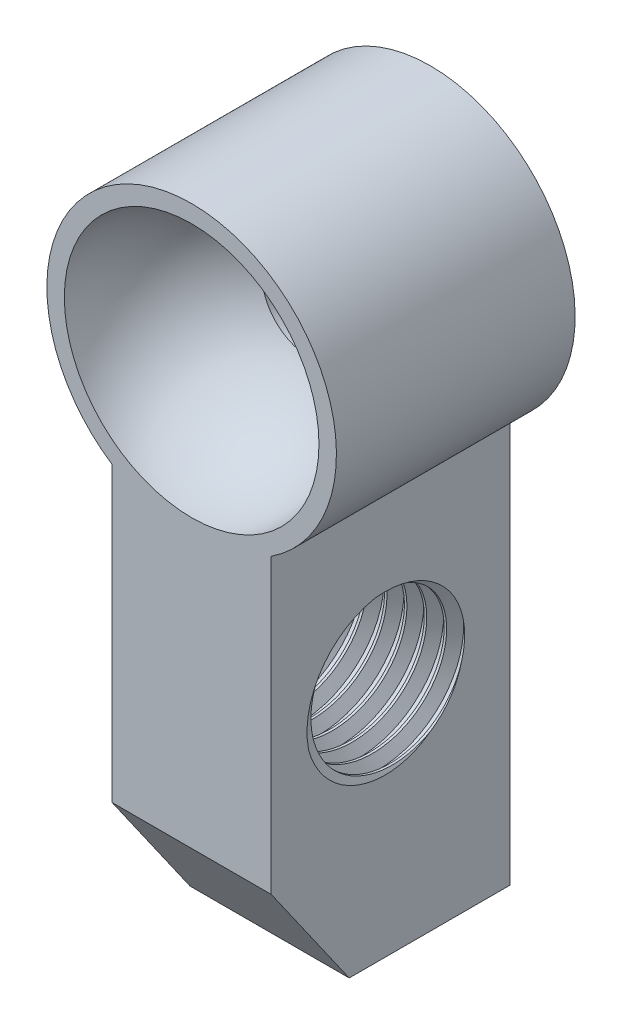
ISO-10303-21;
HEADER;
FILE_DESCRIPTION(('STEP AP214'),'2;1');
FILE_NAME('part.step','',(''),(''),'','','');
FILE_SCHEMA(('AUTOMOTIVE_DESIGN { 1 0 10303 214 1 1 1 1 }'));
ENDSEC;
DATA;
#1=APPLICATION_CONTEXT('core data for automotive mechanical design processes');
#2=APPLICATION_PROTOCOL_DEFINITION('international standard','automotive_design',2000,#1);
#3=PRODUCT_CONTEXT('',#1,'mechanical');
#4=PRODUCT('Part','Part','',(#3));
#5=PRODUCT_RELATED_PRODUCT_CATEGORY('part','',(#4));
#6=PRODUCT_DEFINITION_FORMATION('','',#4);
#7=PRODUCT_DEFINITION_CONTEXT('part definition',#1,'design');
#8=PRODUCT_DEFINITION('design','',#6,#7);
#9=PRODUCT_DEFINITION_SHAPE('','',#8);
#10=(LENGTH_UNIT() NAMED_UNIT(*) SI_UNIT(.MILLI.,.METRE.));
#11=(NAMED_UNIT(*) PLANE_ANGLE_UNIT() SI_UNIT($,.RADIAN.));
#12=(NAMED_UNIT(*) SI_UNIT($,.STERADIAN.) SOLID_ANGLE_UNIT());
#13=UNCERTAINTY_MEASURE_WITH_UNIT(LENGTH_MEASURE(1.E-05),#10,'distance_accuracy_value','');
#14=(GEOMETRIC_REPRESENTATION_CONTEXT(3) GLOBAL_UNCERTAINTY_ASSIGNED_CONTEXT((#13)) GLOBAL_UNIT_ASSIGNED_CONTEXT((#10,
#11,#12)) REPRESENTATION_CONTEXT('',''));
#15=CARTESIAN_POINT('',(0.,0.,0.));
#16=DIRECTION('',(0.,0.,1.));
#17=DIRECTION('',(1.,0.,0.));
#18=AXIS2_PLACEMENT_3D('',#15,#16,#17);
#19=CARTESIAN_POINT('',(-32.8295,24.257,9.525));
#20=DIRECTION('',(0.,0.,-1.));
#21=DIRECTION('',(-1.,0.,0.));
#22=AXIS2_PLACEMENT_3D('',#19,#20,#21);
#23=PLANE('',#22);
#24=CARTESIAN_POINT('',(-31.5595,22.606,9.525));
#25=DIRECTION('',(0.,0.,-1.));
#26=DIRECTION('',(-1.,0.,0.));
#27=AXIS2_PLACEMENT_3D('',#24,#25,#26);
#28=CIRCLE('',#27,5.08);
#29=CARTESIAN_POINT('',(-36.6395,22.606,9.525));
#30=VERTEX_POINT('',#29);
#31=EDGE_CURVE('E156',#30,#30,#28,.T.);
#32=ORIENTED_EDGE('',*,*,#31,.T.);
#33=EDGE_LOOP('',(#32));
#34=FACE_BOUND('',#33,.T.);
#35=DIRECTION('',(0.,1.,0.));
#36=VECTOR('',#35,1.);
#37=CARTESIAN_POINT('',(-28.3845,24.257,9.525));
#38=LINE('',#37,#36);
#39=CARTESIAN_POINT('',(-28.3845,6.09600000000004,9.525));
#40=VERTEX_POINT('',#39);
#41=CARTESIAN_POINT('',(-28.3845,17.78,9.525));
#42=VERTEX_POINT('',#41);
#43=EDGE_CURVE('E251',#40,#42,#38,.T.);
#44=ORIENTED_EDGE('',*,*,#43,.T.);
#45=CARTESIAN_POINT('',(-31.5595,22.606,9.525));
#46=DIRECTION('',(0.,0.,1.));
#47=DIRECTION('',(1.,0.,0.));
#48=AXIS2_PLACEMENT_3D('',#45,#46,#47);
#49=CIRCLE('',#48,5.77675523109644);
#50=CARTESIAN_POINT('',(-34.7345,17.78,9.525));
#51=VERTEX_POINT('',#50);
#52=EDGE_CURVE('E155',#42,#51,#49,.T.);
#53=ORIENTED_EDGE('',*,*,#52,.T.);
#54=DIRECTION('',(0.,-1.,0.));
#55=VECTOR('',#54,1.);
#56=CARTESIAN_POINT('',(-34.7345,1.651,9.525));
#57=LINE('',#56,#55);
#58=CARTESIAN_POINT('',(-34.7345,6.09600000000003,9.525));
#59=VERTEX_POINT('',#58);
#60=EDGE_CURVE('E149',#51,#59,#57,.T.);
#61=ORIENTED_EDGE('',*,*,#60,.T.);
#62=DIRECTION('',(1.,0.,0.));
#63=VECTOR('',#62,1.);
#64=CARTESIAN_POINT('',(-32.8295,6.09600000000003,9.525));
#65=LINE('',#64,#63);
#66=EDGE_CURVE('E267',#59,#40,#65,.T.);
#67=ORIENTED_EDGE('',*,*,#66,.T.);
#68=EDGE_LOOP('',(#44,#53,#61,#67));
#69=FACE_BOUND('',#68,.T.);
#70=ADVANCED_FACE('F61',(#34,#69),#23,.F.);
#71=CARTESIAN_POINT('',(-32.8295,24.257,0.));
#72=DIRECTION('',(0.,0.,-1.));
#73=DIRECTION('',(-1.,0.,0.));
#74=AXIS2_PLACEMENT_3D('',#71,#72,#73);
#75=PLANE('',#74);
#76=DIRECTION('',(0.,-1.,0.));
#77=VECTOR('',#76,1.);
#78=CARTESIAN_POINT('',(-34.7345,1.651,0.));
#79=LINE('',#78,#77);
#80=CARTESIAN_POINT('',(-34.7345,17.78,0.));
#81=VERTEX_POINT('',#80);
#82=CARTESIAN_POINT('',(-34.7345,1.651,0.));
#83=VERTEX_POINT('',#82);
#84=EDGE_CURVE('E133',#81,#83,#79,.T.);
#85=ORIENTED_EDGE('',*,*,#84,.F.);
#86=CARTESIAN_POINT('',(-31.5595,22.606,0.));
#87=DIRECTION('',(0.,0.,-1.));
#88=DIRECTION('',(-1.,0.,0.));
#89=AXIS2_PLACEMENT_3D('',#86,#87,#88);
#90=CIRCLE('',#89,5.77675523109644);
#91=CARTESIAN_POINT('',(-28.3845,17.78,0.));
#92=VERTEX_POINT('',#91);
#93=EDGE_CURVE('E137',#92,#81,#90,.F.);
#94=ORIENTED_EDGE('',*,*,#93,.F.);
#95=DIRECTION('',(0.,1.,0.));
#96=VECTOR('',#95,1.);
#97=CARTESIAN_POINT('',(-28.3845,24.257,0.));
#98=LINE('',#97,#96);
#99=CARTESIAN_POINT('',(-28.3845,1.651,0.));
#100=VERTEX_POINT('',#99);
#101=EDGE_CURVE('E83',#100,#92,#98,.T.);
#102=ORIENTED_EDGE('',*,*,#101,.F.);
#103=DIRECTION('',(1.,0.,0.));
#104=VECTOR('',#103,1.);
#105=CARTESIAN_POINT('',(-28.3845,1.651,0.));
#106=LINE('',#105,#104);
#107=EDGE_CURVE('E139',#83,#100,#106,.T.);
#108=ORIENTED_EDGE('',*,*,#107,.F.);
#109=EDGE_LOOP('',(#85,#94,#102,#108));
#110=FACE_BOUND('',#109,.T.);
#111=CARTESIAN_POINT('',(-31.5595,22.606,0.));
#112=DIRECTION('',(0.,0.,-1.));
#113=DIRECTION('',(-1.,0.,0.));
#114=AXIS2_PLACEMENT_3D('',#111,#112,#113);
#115=CIRCLE('',#114,2.66699999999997);
#116=CARTESIAN_POINT('',(-34.2265,22.606,0.));
#117=VERTEX_POINT('',#116);
#118=EDGE_CURVE('E280',#117,#117,#115,.F.);
#119=ORIENTED_EDGE('',*,*,#118,.T.);
#120=EDGE_LOOP('',(#119));
#121=FACE_BOUND('',#120,.T.);
#122=ADVANCED_FACE('F134',(#110,#121),#75,.T.);
#123=CARTESIAN_POINT('',(-28.3845,24.257,9.525));
#124=DIRECTION('',(-1.,0.,0.));
#125=DIRECTION('',(0.,-1.,0.));
#126=AXIS2_PLACEMENT_3D('',#123,#124,#125);
#127=PLANE('',#126);
#128=ORIENTED_EDGE('',*,*,#101,.T.);
#129=DIRECTION('',(0.,0.,1.));
#130=VECTOR('',#129,1.);
#131=CARTESIAN_POINT('',(-28.3845,17.78,-16.3391311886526));
#132=LINE('',#131,#130);
#133=EDGE_CURVE('E78',#92,#42,#132,.T.);
#134=ORIENTED_EDGE('',*,*,#133,.T.);
#135=ORIENTED_EDGE('',*,*,#43,.F.);
#136=DIRECTION('',(0.,0.819152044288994,0.573576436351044));
#137=VECTOR('',#136,1.);
#138=CARTESIAN_POINT('',(-28.3845,6.09600000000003,9.525));
#139=LINE('',#138,#137);
#140=CARTESIAN_POINT('',(-28.3845,1.651,6.41257749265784));
#141=VERTEX_POINT('',#140);
#142=EDGE_CURVE('E271',#40,#141,#139,.F.);
#143=ORIENTED_EDGE('',*,*,#142,.T.);
#144=DIRECTION('',(0.,0.,-1.));
#145=VECTOR('',#144,1.);
#146=CARTESIAN_POINT('',(-28.3845,1.651,9.525));
#147=LINE('',#146,#145);
#148=EDGE_CURVE('E256',#141,#100,#147,.T.);
#149=ORIENTED_EDGE('',*,*,#148,.T.);
#150=EDGE_LOOP('',(#128,#134,#135,#143,#149));
#151=FACE_BOUND('',#150,.T.);
#152=CARTESIAN_POINT('',(-28.3845,10.9855,4.7625));
#153=DIRECTION('',(-1.,0.,0.));
#154=DIRECTION('',(0.,-1.,0.));
#155=AXIS2_PLACEMENT_3D('',#152,#153,#154);
#156=CIRCLE('',#155,3.33375);
#157=CARTESIAN_POINT('',(-28.3845,14.2577575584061,5.39985353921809));
#158=VERTEX_POINT('',#157);
#159=CARTESIAN_POINT('',(-28.3845,10.3481464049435,8.03475754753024));
#160=VERTEX_POINT('',#159);
#161=EDGE_CURVE('E258',#158,#160,#156,.F.);
#162=ORIENTED_EDGE('',*,*,#161,.F.);
#163=CARTESIAN_POINT('',(-28.3845,14.2577575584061,5.39985353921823));
#164=CARTESIAN_POINT('',(-28.3845,14.2690438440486,5.31114234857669));
#165=CARTESIAN_POINT('',(-28.3845,14.276784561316,5.22198536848));
#166=CARTESIAN_POINT('',(-28.3845,14.2851610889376,5.04338581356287));
#167=CARTESIAN_POINT('',(-28.3845,14.2858006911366,4.95394341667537));
#168=CARTESIAN_POINT('',(-28.3845,14.2799739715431,4.77530382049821));
#169=CARTESIAN_POINT('',(-28.3845,14.2735092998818,4.68610656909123));
#170=CARTESIAN_POINT('',(-28.3845,14.2530898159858,4.50858324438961));
#171=CARTESIAN_POINT('',(-28.3845,14.2391363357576,4.42025701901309));
#172=CARTESIAN_POINT('',(-28.3845,14.203872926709,4.24491372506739));
#173=CARTESIAN_POINT('',(-28.3845,14.1825490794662,4.15789946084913));
#174=CARTESIAN_POINT('',(-28.3845,14.1326764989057,3.98595550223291));
#175=CARTESIAN_POINT('',(-28.3845,14.1041270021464,3.90102602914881));
#176=CARTESIAN_POINT('',(-28.3845,14.0400123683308,3.73386941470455));
#177=CARTESIAN_POINT('',(-28.3845,14.0044480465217,3.6516419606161));
#178=CARTESIAN_POINT('',(-28.3845,13.9265500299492,3.49045895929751));
#179=CARTESIAN_POINT('',(-28.3845,13.8842163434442,3.41150340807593));
#180=CARTESIAN_POINT('',(-28.3845,13.7928541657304,3.25704271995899));
#181=CARTESIAN_POINT('',(-28.3845,13.7437939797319,3.18155632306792));
#182=CARTESIAN_POINT('',(-28.3845,13.6394859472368,3.03498261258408));
#183=CARTESIAN_POINT('',(-28.3845,13.5842376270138,2.96389563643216));
#184=CARTESIAN_POINT('',(-28.3845,13.4679396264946,2.82661795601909));
#185=CARTESIAN_POINT('',(-28.3845,13.4068898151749,2.76042736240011));
#186=CARTESIAN_POINT('',(-28.3845,13.3113109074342,2.66519438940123));
#187=CARTESIAN_POINT('',(-28.3845,13.2787802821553,2.63412250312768));
#188=CARTESIAN_POINT('',(-28.3845,13.2124463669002,2.57336858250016));
#189=CARTESIAN_POINT('',(-28.3845,13.1786431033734,2.54368651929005));
#190=CARTESIAN_POINT('',(-28.3845,13.0753501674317,2.45699409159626));
#191=CARTESIAN_POINT('',(-28.3845,13.0039134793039,2.40227337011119));
#192=CARTESIAN_POINT('',(-28.3845,12.8564885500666,2.29941509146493));
#193=CARTESIAN_POINT('',(-28.3845,12.780501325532,2.25127607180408));
#194=CARTESIAN_POINT('',(-28.3845,12.6245929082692,2.16197177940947));
#195=CARTESIAN_POINT('',(-28.3845,12.544674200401,2.12080217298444));
#196=CARTESIAN_POINT('',(-28.3845,12.3814116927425,2.04569202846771));
#197=CARTESIAN_POINT('',(-28.3845,12.2980645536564,2.01175874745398));
#198=CARTESIAN_POINT('',(-28.3845,12.1331578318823,1.95303732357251));
#199=CARTESIAN_POINT('',(-28.3845,12.051736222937,1.92786091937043));
#200=CARTESIAN_POINT('',(-28.3845,11.8870608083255,1.88446255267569));
#201=CARTESIAN_POINT('',(-28.3845,11.8038070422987,1.86624043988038));
#202=CARTESIAN_POINT('',(-28.3845,11.6360545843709,1.83687741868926));
#203=CARTESIAN_POINT('',(-28.3845,11.5515558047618,1.82573701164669));
#204=CARTESIAN_POINT('',(-28.3845,11.3819605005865,1.81062706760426));
#205=CARTESIAN_POINT('',(-28.3845,11.2968642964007,1.80665394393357));
#206=CARTESIAN_POINT('',(-28.3845,11.1419720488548,1.80594231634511));
#207=CARTESIAN_POINT('',(-28.3845,11.07218013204,1.80802991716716));
#208=CARTESIAN_POINT('',(-28.3845,10.9677824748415,1.81480272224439));
#209=CARTESIAN_POINT('',(-28.3845,10.933052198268,1.81766444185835));
#210=CARTESIAN_POINT('',(-28.3845,10.8637198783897,1.82466936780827));
#211=CARTESIAN_POINT('',(-28.3845,10.8291178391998,1.82881261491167));
#212=CARTESIAN_POINT('',(-28.3845,10.7255998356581,1.84313065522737));
#213=CARTESIAN_POINT('',(-28.3845,10.6569366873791,1.85519602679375));
#214=CARTESIAN_POINT('',(-28.3845,10.5205703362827,1.88433087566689));
#215=CARTESIAN_POINT('',(-28.3845,10.4528687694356,1.90140800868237));
#216=CARTESIAN_POINT('',(-28.3845,10.3858971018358,1.92095278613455));
#217=B_SPLINE_CURVE_WITH_KNOTS('',3,(#163,#164,#165,#166,#167,#168,#169,#170,#171,#172,#173,
#174,#175,#176,#177,#178,#179,#180,#181,#182,#183,#184,#185,#186,#187,#188,#189,#190,#191,#192,
#193,#194,#195,#196,#197,#198,#199,#200,#201,#202,#203,#204,#205,#206,#207,#208,#209,#210,#211,
#212,#213,#214,#215,#216),.UNSPECIFIED.,.F.,.F.,(4,2,2,2,2,2,2,2,2,2,2,2,2,2,2,2,2,2,2,2,2,2,2,
2,2,2,4),(0.,0.268198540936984,0.53625386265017,0.804246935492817,1.07219235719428,
1.34064656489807,1.60912914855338,1.87758054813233,2.14603162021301,2.4157941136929,
2.68557727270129,2.95536652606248,3.09028947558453,3.22520962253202,3.4947793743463,
3.76428912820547,4.03363067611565,4.30324108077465,4.55861612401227,4.81398564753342,
5.06937324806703,5.32463301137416,5.5339287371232,5.63845232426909,5.74297923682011,
5.95192720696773,6.16119603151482),.UNSPECIFIED.);
#218=CARTESIAN_POINT('',(-28.3845,10.3858971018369,1.92095278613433));
#219=VERTEX_POINT('',#218);
#220=EDGE_CURVE('E170',#158,#219,#217,.T.);
#221=ORIENTED_EDGE('',*,*,#220,.T.);
#222=CARTESIAN_POINT('',(-28.3845,10.3858971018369,1.92095278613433));
#223=CARTESIAN_POINT('',(-28.3845,10.3211460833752,1.93460467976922));
#224=CARTESIAN_POINT('',(-28.3845,10.2568403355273,1.95049282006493));
#225=CARTESIAN_POINT('',(-28.3845,10.064350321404,2.00509961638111));
#226=CARTESIAN_POINT('',(-28.3845,9.93802444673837,2.05055958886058));
#227=CARTESIAN_POINT('',(-28.3845,9.69272164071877,2.15853328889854));
#228=CARTESIAN_POINT('',(-28.3845,9.57375462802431,2.22106944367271));
#229=CARTESIAN_POINT('',(-28.3845,9.34561921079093,2.3619436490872));
#230=CARTESIAN_POINT('',(-28.3845,9.23644834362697,2.44027771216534));
#231=CARTESIAN_POINT('',(-28.3845,9.0300287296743,2.6112262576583));
#232=CARTESIAN_POINT('',(-28.3845,8.93277035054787,2.70382906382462));
#233=CARTESIAN_POINT('',(-28.3845,8.78901392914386,2.86101826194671));
#234=CARTESIAN_POINT('',(-28.3845,8.73802931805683,2.92156450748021));
#235=CARTESIAN_POINT('',(-28.3845,8.64121475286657,3.0465500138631));
#236=CARTESIAN_POINT('',(-28.3845,8.59537970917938,3.11098533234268));
#237=CARTESIAN_POINT('',(-28.3845,8.55223942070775,3.1772059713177));
#238=B_SPLINE_CURVE_WITH_KNOTS('',3,(#222,#223,#224,#225,#226,#227,#228,#229,#230,#231,#232,
#233,#234,#235,#236,#237),.UNSPECIFIED.,.F.,.F.,(4,2,2,2,2,2,2,4),(0.,0.198553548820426,
0.599958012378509,1.00189222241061,1.4037251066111,1.80523089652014,2.0424521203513,
2.27943678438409),.UNSPECIFIED.);
#239=CARTESIAN_POINT('',(-28.3845000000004,8.55223942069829,3.17720597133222));
#240=VERTEX_POINT('',#239);
#241=EDGE_CURVE('E167',#219,#240,#238,.T.);
#242=ORIENTED_EDGE('',*,*,#241,.T.);
#243=CARTESIAN_POINT('',(-28.3845,8.55223942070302,3.17720597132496));
#244=CARTESIAN_POINT('',(-28.3845,8.50197855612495,3.24285748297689));
#245=CARTESIAN_POINT('',(-28.3845,8.45450560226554,3.31063805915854));
#246=CARTESIAN_POINT('',(-28.3845,8.36544359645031,3.44995188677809));
#247=CARTESIAN_POINT('',(-28.3845,8.32385400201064,3.52148479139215));
#248=CARTESIAN_POINT('',(-28.3845,8.24695670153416,3.66762142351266));
#249=CARTESIAN_POINT('',(-28.3845,8.21163307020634,3.74221675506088));
#250=CARTESIAN_POINT('',(-28.3845,8.14739017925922,3.8940937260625));
#251=CARTESIAN_POINT('',(-28.3845,8.1184710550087,3.97137542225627));
#252=CARTESIAN_POINT('',(-28.3845,8.04158721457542,4.20657784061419));
#253=CARTESIAN_POINT('',(-28.3845,8.00349400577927,4.36785975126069));
#254=CARTESIAN_POINT('',(-28.3845,7.95502847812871,4.69454024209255));
#255=CARTESIAN_POINT('',(-28.3845,7.94466898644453,4.85994069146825));
#256=CARTESIAN_POINT('',(-28.3845,7.94871331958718,5.10868872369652));
#257=CARTESIAN_POINT('',(-28.3845,7.95343204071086,5.19231770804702));
#258=CARTESIAN_POINT('',(-28.3845,7.96960747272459,5.35892104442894));
#259=CARTESIAN_POINT('',(-28.3845,7.98106362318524,5.44189545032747));
#260=CARTESIAN_POINT('',(-28.3845,8.02542778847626,5.68900179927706));
#261=CARTESIAN_POINT('',(-28.3845,8.06833356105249,5.85143670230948));
#262=CARTESIAN_POINT('',(-28.3845,8.18223168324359,6.17429751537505));
#263=CARTESIAN_POINT('',(-28.3845,8.25438230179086,6.33431684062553));
#264=CARTESIAN_POINT('',(-28.3845,8.38186193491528,6.56341807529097));
#265=CARTESIAN_POINT('',(-28.3845,8.42758702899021,6.63799248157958));
#266=CARTESIAN_POINT('',(-28.3845,8.5251522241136,6.78305344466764));
#267=CARTESIAN_POINT('',(-28.3845,8.57699201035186,6.85354021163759));
#268=CARTESIAN_POINT('',(-28.3845,8.68636548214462,6.98976828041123));
#269=CARTESIAN_POINT('',(-28.3845,8.74389105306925,7.05551612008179));
#270=CARTESIAN_POINT('',(-28.3845,8.86397748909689,7.18224200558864));
#271=CARTESIAN_POINT('',(-28.3845,8.92653886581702,7.24321956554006));
#272=CARTESIAN_POINT('',(-28.3845,9.05636843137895,7.36002157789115));
#273=CARTESIAN_POINT('',(-28.3845,9.12363892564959,7.41584347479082));
#274=CARTESIAN_POINT('',(-28.3845,9.2623824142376,7.52193001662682));
#275=CARTESIAN_POINT('',(-28.3845,9.33385500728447,7.57219519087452));
#276=CARTESIAN_POINT('',(-28.3845,9.55190060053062,7.71284065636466));
#277=CARTESIAN_POINT('',(-28.3845,9.70406688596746,7.79483309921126));
#278=CARTESIAN_POINT('',(-28.3845,9.94026112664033,7.89906484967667));
#279=CARTESIAN_POINT('',(-28.3845,10.0203159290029,7.93068241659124));
#280=CARTESIAN_POINT('',(-28.3845,10.1826592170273,7.98753714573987));
#281=CARTESIAN_POINT('',(-28.3845,10.2649476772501,8.01277438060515));
#282=CARTESIAN_POINT('',(-28.3845,10.3481464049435,8.03475754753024));
#283=B_SPLINE_CURVE_WITH_KNOTS('',3,(#243,#244,#245,#246,#247,#248,#249,#250,#251,#252,#253,
#254,#255,#256,#257,#258,#259,#260,#261,#262,#263,#264,#265,#266,#267,#268,#269,#270,#271,#272,
#273,#274,#275,#276,#277,#278,#279,#280,#281,#282),.UNSPECIFIED.,.F.,.F.,(4,2,2,2,2,2,2,2,2,2,2,
2,2,2,2,2,2,2,2,4),(0.,0.247964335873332,0.495905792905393,0.743207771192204,0.990514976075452,
1.48511647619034,1.97994669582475,2.23100743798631,2.48204729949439,2.98377175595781,
3.50768616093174,3.76986062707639,4.03202160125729,4.29381368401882,4.55563239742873,
4.81758019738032,5.07950302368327,5.59551384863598,5.85351467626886,6.11151256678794),.UNSPECIFIED.);
#284=EDGE_CURVE('E328',#240,#160,#283,.T.);
#285=ORIENTED_EDGE('',*,*,#284,.T.);
#286=EDGE_LOOP('',(#162,#221,#242,#285));
#287=FACE_BOUND('',#286,.T.);
#288=ADVANCED_FACE('F373',(#151,#287),#127,.F.);
#289=CARTESIAN_POINT('',(-34.7345,1.651,9.525));
#290=DIRECTION('',(1.,0.,0.));
#291=DIRECTION('',(0.,1.,0.));
#292=AXIS2_PLACEMENT_3D('',#289,#290,#291);
#293=PLANE('',#292);
#294=ORIENTED_EDGE('',*,*,#60,.F.);
#295=DIRECTION('',(0.,0.,1.));
#296=VECTOR('',#295,1.);
#297=CARTESIAN_POINT('',(-34.7345,17.78,-16.3391311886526));
#298=LINE('',#297,#296);
#299=EDGE_CURVE('E12',#51,#81,#298,.F.);
#300=ORIENTED_EDGE('',*,*,#299,.T.);
#301=ORIENTED_EDGE('',*,*,#84,.T.);
#302=DIRECTION('',(0.,0.,-1.));
#303=VECTOR('',#302,1.);
#304=CARTESIAN_POINT('',(-34.7345,1.651,9.525));
#305=LINE('',#304,#303);
#306=CARTESIAN_POINT('',(-34.7345,1.651,6.41257749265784));
#307=VERTEX_POINT('',#306);
#308=EDGE_CURVE('E264',#307,#83,#305,.T.);
#309=ORIENTED_EDGE('',*,*,#308,.F.);
#310=DIRECTION('',(0.,-0.819152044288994,-0.573576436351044));
#311=VECTOR('',#310,1.);
#312=CARTESIAN_POINT('',(-34.7345,6.09600000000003,9.525));
#313=LINE('',#312,#311);
#314=EDGE_CURVE('E277',#307,#59,#313,.F.);
#315=ORIENTED_EDGE('',*,*,#314,.T.);
#316=EDGE_LOOP('',(#294,#300,#301,#309,#315));
#317=FACE_BOUND('',#316,.T.);
#318=CARTESIAN_POINT('',(-34.7345,10.9855,4.7625));
#319=DIRECTION('',(-1.,0.,0.));
#320=DIRECTION('',(0.,0.,1.));
#321=AXIS2_PLACEMENT_3D('',#318,#319,#320);
#322=CIRCLE('',#321,3.33375);
#323=CARTESIAN_POINT('',(-34.7345,10.3481464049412,8.03475754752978));
#324=VERTEX_POINT('',#323);
#325=CARTESIAN_POINT('',(-34.7345,14.2577575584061,5.39985353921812));
#326=VERTEX_POINT('',#325);
#327=EDGE_CURVE('E288',#324,#326,#322,.T.);
#328=ORIENTED_EDGE('',*,*,#327,.F.);
#329=CARTESIAN_POINT('',(-34.7345,10.3481464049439,8.03475754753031));
#330=CARTESIAN_POINT('',(-34.7345,10.2617229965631,8.01193563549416));
#331=CARTESIAN_POINT('',(-34.7345,10.1762375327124,7.98556781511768));
#332=CARTESIAN_POINT('',(-34.7345,10.0076991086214,7.92595073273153));
#333=CARTESIAN_POINT('',(-34.7345,9.92464618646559,7.89270136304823));
#334=CARTESIAN_POINT('',(-34.7345,9.76145904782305,7.81949947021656));
#335=CARTESIAN_POINT('',(-34.7345,9.68132751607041,7.77954096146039));
#336=CARTESIAN_POINT('',(-34.7345,9.52459845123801,7.69321208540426));
#337=CARTESIAN_POINT('',(-34.7345,9.44800085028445,7.64684184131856));
#338=CARTESIAN_POINT('',(-34.7345,9.29885691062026,7.5480018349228));
#339=CARTESIAN_POINT('',(-34.7345,9.2263102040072,7.49553262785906));
#340=CARTESIAN_POINT('',(-34.7345,9.08573918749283,7.3848416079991));
#341=CARTESIAN_POINT('',(-34.7345,9.01771529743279,7.32661926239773));
#342=CARTESIAN_POINT('',(-34.7345,8.8866866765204,7.20483797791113));
#343=CARTESIAN_POINT('',(-34.7345,8.82367900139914,7.1412822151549));
#344=CARTESIAN_POINT('',(-34.7345,8.73321997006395,7.04228233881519));
#345=CARTESIAN_POINT('',(-34.7345,8.70374195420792,7.00867080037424));
#346=CARTESIAN_POINT('',(-34.7345,8.64626185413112,6.94019811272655));
#347=CARTESIAN_POINT('',(-34.7345,8.61826003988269,6.90533673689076));
#348=CARTESIAN_POINT('',(-34.7345,8.53528380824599,6.79734753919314));
#349=CARTESIAN_POINT('',(-34.7345,8.48272999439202,6.72233179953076));
#350=CARTESIAN_POINT('',(-34.7345,8.3844230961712,6.56795194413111));
#351=CARTESIAN_POINT('',(-34.7345,8.33867404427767,6.48858528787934));
#352=CARTESIAN_POINT('',(-34.7345,8.21223085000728,6.24490954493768));
#353=CARTESIAN_POINT('',(-34.7345,8.14223068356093,6.07488124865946));
#354=CARTESIAN_POINT('',(-34.7345,8.03568489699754,5.73298918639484));
#355=CARTESIAN_POINT('',(-34.7345,7.99778872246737,5.56154407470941));
#356=CARTESIAN_POINT('',(-34.7345,7.9629124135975,5.3016066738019));
#357=CARTESIAN_POINT('',(-34.7345,7.95494941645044,5.21446679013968));
#358=CARTESIAN_POINT('',(-34.7345,7.94640277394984,5.03979219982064));
#359=CARTESIAN_POINT('',(-34.7345,7.94581938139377,4.95225747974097));
#360=CARTESIAN_POINT('',(-34.7345,7.95043810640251,4.82107996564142));
#361=CARTESIAN_POINT('',(-34.7345,7.95289957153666,4.77732255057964));
#362=CARTESIAN_POINT('',(-34.7345,7.95975432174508,4.68995991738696));
#363=CARTESIAN_POINT('',(-34.7345,7.96414751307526,4.64635469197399));
#364=CARTESIAN_POINT('',(-34.7345,7.98024987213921,4.51590606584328));
#365=CARTESIAN_POINT('',(-34.7345,7.99488261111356,4.42940617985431));
#366=CARTESIAN_POINT('',(-34.7345,8.03180133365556,4.25812119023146));
#367=CARTESIAN_POINT('',(-34.7345,8.05408244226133,4.17333503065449));
#368=CARTESIAN_POINT('',(-34.7345,8.10611496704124,4.00611430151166));
#369=CARTESIAN_POINT('',(-34.7345,8.1358654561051,3.92367944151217));
#370=CARTESIAN_POINT('',(-34.7345,8.21818358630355,3.72406611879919));
#371=CARTESIAN_POINT('',(-34.7345,8.2749272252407,3.60856653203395));
#372=CARTESIAN_POINT('',(-34.7345,8.37093212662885,3.44173197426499));
#373=CARTESIAN_POINT('',(-34.7345,8.40475227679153,3.38718487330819));
#374=CARTESIAN_POINT('',(-34.7345,8.47589954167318,3.28040682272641));
#375=CARTESIAN_POINT('',(-34.7345,8.51322758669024,3.22817649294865));
#376=CARTESIAN_POINT('',(-34.7345,8.55223942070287,3.17720597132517));
#377=B_SPLINE_CURVE_WITH_KNOTS('',3,(#329,#330,#331,#332,#333,#334,#335,#336,#337,#338,#339,
#340,#341,#342,#343,#344,#345,#346,#347,#348,#349,#350,#351,#352,#353,#354,#355,#356,#357,#358,
#359,#360,#361,#362,#363,#364,#365,#366,#367,#368,#369,#370,#371,#372,#373,#374,#375,#376),
.UNSPECIFIED.,.F.,.F.,(4,2,2,2,2,2,2,2,2,2,2,2,2,2,2,2,2,2,2,2,2,2,2,4),(0.,0.26808126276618,
0.536166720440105,0.804492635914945,1.07281339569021,1.3411097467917,1.60943096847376,
1.87759351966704,2.01167888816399,2.14578869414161,2.42016341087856,2.69470007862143,
3.24323864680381,3.76735828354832,4.02961049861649,4.29187169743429,4.42331757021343,
4.5547570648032,4.81756566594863,5.08020706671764,5.34281588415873,5.72760150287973,
5.92002968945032,6.1125090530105),.UNSPECIFIED.);
#378=CARTESIAN_POINT('',(-34.7345,8.55223942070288,3.17720597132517));
#379=VERTEX_POINT('',#378);
#380=EDGE_CURVE('E71',#324,#379,#377,.T.);
#381=ORIENTED_EDGE('',*,*,#380,.T.);
#382=CARTESIAN_POINT('',(-34.7345,8.55223942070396,3.17720597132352));
#383=CARTESIAN_POINT('',(-34.7345,8.58835326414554,3.12175456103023));
#384=CARTESIAN_POINT('',(-34.7345,8.62639164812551,3.06752593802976));
#385=CARTESIAN_POINT('',(-34.7345,8.74682640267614,2.90774553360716));
#386=CARTESIAN_POINT('',(-34.7345,8.83483805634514,2.80636119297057));
#387=CARTESIAN_POINT('',(-34.7345,9.02411039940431,2.61660406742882));
#388=CARTESIAN_POINT('',(-34.7345,9.12538842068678,2.52824863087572));
#389=CARTESIAN_POINT('',(-34.7345,9.33914148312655,2.36638159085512));
#390=CARTESIAN_POINT('',(-34.7345,9.45161369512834,2.29286625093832));
#391=CARTESIAN_POINT('',(-34.7345,9.68556948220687,2.16211017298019));
#392=CARTESIAN_POINT('',(-34.7345,9.80704564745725,2.10485623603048));
#393=CARTESIAN_POINT('',(-34.7345,10.0055413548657,2.02756583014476));
#394=CARTESIAN_POINT('',(-34.7345,10.0804136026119,2.00188655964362));
#395=CARTESIAN_POINT('',(-34.7345,10.2319269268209,1.95674069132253));
#396=CARTESIAN_POINT('',(-34.7345,10.3085661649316,1.93726792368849));
#397=CARTESIAN_POINT('',(-34.7345,10.3858971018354,1.92095278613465));
#398=B_SPLINE_CURVE_WITH_KNOTS('',3,(#382,#383,#384,#385,#386,#387,#388,#389,#390,#391,#392,
#393,#394,#395,#396,#397),.UNSPECIFIED.,.F.,.F.,(4,2,2,2,2,2,2,4),(0.,0.198553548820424,
0.599958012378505,1.0018922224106,1.40372510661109,1.80523089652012,2.042452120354,
2.27943678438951),.UNSPECIFIED.);
#399=CARTESIAN_POINT('',(-34.7345,10.3858971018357,1.92095278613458));
#400=VERTEX_POINT('',#399);
#401=EDGE_CURVE('E327',#379,#400,#398,.T.);
#402=ORIENTED_EDGE('',*,*,#401,.T.);
#403=CARTESIAN_POINT('',(-34.7345,10.3858971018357,1.92095278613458));
#404=CARTESIAN_POINT('',(-34.7345,10.4630793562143,1.89844374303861));
#405=CARTESIAN_POINT('',(-34.7345,10.5412149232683,1.87919114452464));
#406=CARTESIAN_POINT('',(-34.7345,10.6987067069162,1.84736020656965));
#407=CARTESIAN_POINT('',(-34.7345,10.7780608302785,1.83477150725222));
#408=CARTESIAN_POINT('',(-34.7345,10.937472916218,1.81636737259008));
#409=CARTESIAN_POINT('',(-34.7345,11.0175301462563,1.81054557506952));
#410=CARTESIAN_POINT('',(-34.7345,11.177932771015,1.80524053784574));
#411=CARTESIAN_POINT('',(-34.7345,11.2582784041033,1.80576547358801));
#412=CARTESIAN_POINT('',(-34.7345,11.4985596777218,1.81692830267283));
#413=CARTESIAN_POINT('',(-34.7345,11.6581549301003,1.83710756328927));
#414=CARTESIAN_POINT('',(-34.7345,11.9721089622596,1.90248850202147));
#415=CARTESIAN_POINT('',(-34.7345,12.1264683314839,1.94768735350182));
#416=CARTESIAN_POINT('',(-34.7345,12.3557232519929,2.03507011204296));
#417=CARTESIAN_POINT('',(-34.7345,12.4339591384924,2.06874102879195));
#418=CARTESIAN_POINT('',(-34.7345,12.5872713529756,2.14252872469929));
#419=CARTESIAN_POINT('',(-34.7345,12.6623502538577,2.18264012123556));
#420=CARTESIAN_POINT('',(-34.7345,12.8089049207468,2.26906247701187));
#421=CARTESIAN_POINT('',(-34.7345,12.8803783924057,2.31537731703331));
#422=CARTESIAN_POINT('',(-34.7345,13.0191978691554,2.41387468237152));
#423=CARTESIAN_POINT('',(-34.7345,13.0865430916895,2.46605831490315));
#424=CARTESIAN_POINT('',(-34.7345,13.1840162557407,2.54838973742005));
#425=CARTESIAN_POINT('',(-34.7345,13.2158962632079,2.57648926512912));
#426=CARTESIAN_POINT('',(-34.7345,13.2785214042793,2.63392596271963));
#427=CARTESIAN_POINT('',(-34.7345,13.3092665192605,2.66326315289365));
#428=CARTESIAN_POINT('',(-34.7345,13.3997075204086,2.75307774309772));
#429=CARTESIAN_POINT('',(-34.7345,13.4576219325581,2.81536905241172));
#430=CARTESIAN_POINT('',(-34.7345,13.5683051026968,2.9443569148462));
#431=CARTESIAN_POINT('',(-34.7345,13.6210737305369,3.01105357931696));
#432=CARTESIAN_POINT('',(-34.7345,13.7211331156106,3.14843570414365));
#433=CARTESIAN_POINT('',(-34.7345,13.7684240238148,3.21912105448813));
#434=CARTESIAN_POINT('',(-34.7345,13.8596742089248,3.36802520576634));
#435=CARTESIAN_POINT('',(-34.7345,13.9033066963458,3.44644450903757));
#436=CARTESIAN_POINT('',(-34.7345,13.983831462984,3.60667140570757));
#437=CARTESIAN_POINT('',(-34.7345,14.0207235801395,3.68847908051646));
#438=CARTESIAN_POINT('',(-34.7345,14.0875202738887,3.85493707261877));
#439=CARTESIAN_POINT('',(-34.7345,14.117422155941,3.93958847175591));
#440=CARTESIAN_POINT('',(-34.7345,14.1700074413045,4.11109155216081));
#441=CARTESIAN_POINT('',(-34.7345,14.1926914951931,4.19794303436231));
#442=CARTESIAN_POINT('',(-34.7345,14.2314592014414,4.37681918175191));
#443=CARTESIAN_POINT('',(-34.7345,14.2472374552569,4.46891070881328));
#444=CARTESIAN_POINT('',(-34.7345,14.2648297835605,4.60780077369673));
#445=CARTESIAN_POINT('',(-34.7345,14.2696817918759,4.65423345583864));
#446=CARTESIAN_POINT('',(-34.7345,14.2773491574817,4.74726767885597));
#447=CARTESIAN_POINT('',(-34.7345,14.2801644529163,4.79386922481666));
#448=CARTESIAN_POINT('',(-34.7345,14.2857171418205,4.9338678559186));
#449=CARTESIAN_POINT('',(-34.7345,14.2855533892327,5.0273942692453));
#450=CARTESIAN_POINT('',(-34.7345,14.2774718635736,5.21406761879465));
#451=CARTESIAN_POINT('',(-34.7345,14.2695576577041,5.30721470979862));
#452=CARTESIAN_POINT('',(-34.7345,14.2577575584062,5.39985353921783));
#453=B_SPLINE_CURVE_WITH_KNOTS('',3,(#403,#404,#405,#406,#407,#408,#409,#410,#411,#412,#413,
#414,#415,#416,#417,#418,#419,#420,#421,#422,#423,#424,#425,#426,#427,#428,#429,#430,#431,#432,
#433,#434,#435,#436,#437,#438,#439,#440,#441,#442,#443,#444,#445,#446,#447,#448,#449,#450,#451,
#452),.UNSPECIFIED.,.F.,.F.,(4,2,2,2,2,2,2,2,2,2,2,2,2,2,2,2,2,2,2,2,2,2,2,2,4),(0.,
0.241127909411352,0.481879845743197,0.722405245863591,0.963240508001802,1.44367163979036,
1.9240485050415,2.1793114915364,2.43436224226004,2.68957330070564,2.94483258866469,
3.07229076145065,3.19975102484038,3.4546211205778,3.70949766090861,3.96436717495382,
4.23326928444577,4.50217785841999,4.77118991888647,5.04017772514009,5.32008741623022,
5.46010528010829,5.60012739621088,5.88036646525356,6.16047661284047),.UNSPECIFIED.);
#454=EDGE_CURVE('E211',#400,#326,#453,.T.);
#455=ORIENTED_EDGE('',*,*,#454,.T.);
#456=EDGE_LOOP('',(#328,#381,#402,#455));
#457=FACE_BOUND('',#456,.T.);
#458=ADVANCED_FACE('F146',(#317,#457),#293,.F.);
#459=CARTESIAN_POINT('',(-28.3845,1.651,9.525));
#460=DIRECTION('',(0.,1.,0.));
#461=DIRECTION('',(-1.,0.,0.));
#462=AXIS2_PLACEMENT_3D('',#459,#460,#461);
#463=PLANE('',#462);
#464=ORIENTED_EDGE('',*,*,#148,.F.);
#465=DIRECTION('',(-1.,0.,0.));
#466=VECTOR('',#465,1.);
#467=CARTESIAN_POINT('',(-28.3845,1.651,6.41257749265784));
#468=LINE('',#467,#466);
#469=EDGE_CURVE('E274',#141,#307,#468,.T.);
#470=ORIENTED_EDGE('',*,*,#469,.T.);
#471=ORIENTED_EDGE('',*,*,#308,.T.);
#472=ORIENTED_EDGE('',*,*,#107,.T.);
#473=EDGE_LOOP('',(#464,#470,#471,#472));
#474=FACE_BOUND('',#473,.T.);
#475=ADVANCED_FACE('F388',(#474),#463,.F.);
#476=CARTESIAN_POINT('',(-32.8295,6.09600000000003,9.525));
#477=DIRECTION('',(0.,0.573576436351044,-0.819152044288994));
#478=DIRECTION('',(1.,0.,0.));
#479=AXIS2_PLACEMENT_3D('',#476,#477,#478);
#480=PLANE('',#479);
#481=ORIENTED_EDGE('',*,*,#314,.F.);
#482=ORIENTED_EDGE('',*,*,#469,.F.);
#483=ORIENTED_EDGE('',*,*,#142,.F.);
#484=ORIENTED_EDGE('',*,*,#66,.F.);
#485=EDGE_LOOP('',(#481,#482,#483,#484));
#486=FACE_BOUND('',#485,.T.);
#487=ADVANCED_FACE('F402',(#486),#480,.F.);
#488=CARTESIAN_POINT('',(-31.5595,22.606,0.));
#489=DIRECTION('',(0.,0.,-1.));
#490=DIRECTION('',(-1.,0.,0.));
#491=AXIS2_PLACEMENT_3D('',#488,#489,#490);
#492=CONICAL_SURFACE('',#491,2.66699999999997,0.785398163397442);
#493=CARTESIAN_POINT('',(-31.5595,22.606,0.761999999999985));
#494=DIRECTION('',(0.,0.,-1.));
#495=DIRECTION('',(-1.,0.,0.));
#496=AXIS2_PLACEMENT_3D('',#493,#494,#495);
#497=CIRCLE('',#496,1.905);
#498=CARTESIAN_POINT('',(-33.4645,22.606,0.761999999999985));
#499=VERTEX_POINT('',#498);
#500=EDGE_CURVE('E162',#499,#499,#497,.T.);
#501=ORIENTED_EDGE('',*,*,#500,.F.);
#502=EDGE_LOOP('',(#501));
#503=FACE_BOUND('',#502,.T.);
#504=ORIENTED_EDGE('',*,*,#118,.F.);
#505=EDGE_LOOP('',(#504));
#506=FACE_BOUND('',#505,.T.);
#507=ADVANCED_FACE('F63',(#503,#506),#492,.F.);
#508=CARTESIAN_POINT('',(-18.9552310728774,10.9855,4.7625));
#509=DIRECTION('',(-1.,0.,0.));
#510=DIRECTION('',(0.,0.,1.));
#511=AXIS2_PLACEMENT_3D('',#508,#509,#510);
#512=CYLINDRICAL_SURFACE('',#511,3.33375);
#513=ORIENTED_EDGE('',*,*,#327,.T.);
#514=CARTESIAN_POINT('',(-28.0540437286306,7.40073674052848,6.27877264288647));
#515=CARTESIAN_POINT('',(-28.0920236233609,8.2133614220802,6.86917204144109));
#516=CARTESIAN_POINT('',(-28.1300035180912,9.02598610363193,7.4595714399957));
#517=CARTESIAN_POINT('',(-28.1709605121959,9.902309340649,8.09625));
#518=CARTESIAN_POINT('',(-28.209875,10.9855,8.09625));
#519=CARTESIAN_POINT('',(-28.259484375,12.3663844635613,8.09625));
#520=CARTESIAN_POINT('',(-28.30909375,13.3428172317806,7.11981723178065));
#521=CARTESIAN_POINT('',(-28.358703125,14.31925,6.14338446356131));
#522=CARTESIAN_POINT('',(-28.4083125,14.31925,4.7625));
#523=CARTESIAN_POINT('',(-28.457921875,14.31925,3.38161553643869));
#524=CARTESIAN_POINT('',(-28.50753125,13.3428172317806,2.40518276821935));
#525=CARTESIAN_POINT('',(-28.557140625,12.3663844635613,1.42875));
#526=CARTESIAN_POINT('',(-28.60675,10.9855,1.42875));
#527=CARTESIAN_POINT('',(-28.656359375,9.60461553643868,1.42875));
#528=CARTESIAN_POINT('',(-28.70596875,8.62818276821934,2.40518276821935));
#529=CARTESIAN_POINT('',(-28.755578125,7.65174999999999,3.38161553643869));
#530=CARTESIAN_POINT('',(-28.8051875,7.65174999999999,4.7625));
#531=CARTESIAN_POINT('',(-28.854796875,7.65174999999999,6.14338446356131));
#532=CARTESIAN_POINT('',(-28.90440625,8.62818276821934,7.11981723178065));
#533=CARTESIAN_POINT('',(-28.954015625,9.60461553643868,8.09625));
#534=CARTESIAN_POINT('',(-29.003625,10.9855,8.09625));
#535=CARTESIAN_POINT('',(-29.053234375,12.3663844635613,8.09625));
#536=CARTESIAN_POINT('',(-29.10284375,13.3428172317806,7.11981723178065));
#537=CARTESIAN_POINT('',(-29.152453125,14.31925,6.14338446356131));
#538=CARTESIAN_POINT('',(-29.2020625,14.31925,4.7625));
#539=CARTESIAN_POINT('',(-29.251671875,14.31925,3.38161553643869));
#540=CARTESIAN_POINT('',(-29.30128125,13.3428172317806,2.40518276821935));
#541=CARTESIAN_POINT('',(-29.350890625,12.3663844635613,1.42875));
#542=CARTESIAN_POINT('',(-29.4005,10.9855,1.42875));
#543=CARTESIAN_POINT('',(-29.450109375,9.60461553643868,1.42875));
#544=CARTESIAN_POINT('',(-29.49971875,8.62818276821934,2.40518276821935));
#545=CARTESIAN_POINT('',(-29.549328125,7.65174999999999,3.38161553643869));
#546=CARTESIAN_POINT('',(-29.5989375,7.65174999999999,4.7625));
#547=CARTESIAN_POINT('',(-29.648546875,7.65174999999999,6.14338446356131));
#548=CARTESIAN_POINT('',(-29.69815625,8.62818276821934,7.11981723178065));
#549=CARTESIAN_POINT('',(-29.747765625,9.60461553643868,8.09625));
#550=CARTESIAN_POINT('',(-29.797375,10.9855,8.09625));
#551=CARTESIAN_POINT('',(-29.846984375,12.3663844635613,8.09625));
#552=CARTESIAN_POINT('',(-29.89659375,13.3428172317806,7.11981723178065));
#553=CARTESIAN_POINT('',(-29.946203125,14.31925,6.14338446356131));
#554=CARTESIAN_POINT('',(-29.9958125,14.31925,4.7625));
#555=CARTESIAN_POINT('',(-30.045421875,14.31925,3.38161553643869));
#556=CARTESIAN_POINT('',(-30.09503125,13.3428172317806,2.40518276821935));
#557=CARTESIAN_POINT('',(-30.144640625,12.3663844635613,1.42875));
#558=CARTESIAN_POINT('',(-30.19425,10.9855,1.42875));
#559=CARTESIAN_POINT('',(-30.243859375,9.60461553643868,1.42875));
#560=CARTESIAN_POINT('',(-30.29346875,8.62818276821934,2.40518276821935));
#561=CARTESIAN_POINT('',(-30.343078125,7.65174999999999,3.38161553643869));
#562=CARTESIAN_POINT('',(-30.3926875,7.65174999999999,4.7625));
#563=CARTESIAN_POINT('',(-30.442296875,7.65174999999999,6.14338446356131));
#564=CARTESIAN_POINT('',(-30.49190625,8.62818276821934,7.11981723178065));
#565=CARTESIAN_POINT('',(-30.541515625,9.60461553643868,8.09625));
#566=CARTESIAN_POINT('',(-30.591125,10.9855,8.09625));
#567=CARTESIAN_POINT('',(-30.640734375,12.3663844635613,8.09625));
#568=CARTESIAN_POINT('',(-30.69034375,13.3428172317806,7.11981723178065));
#569=CARTESIAN_POINT('',(-30.739953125,14.31925,6.14338446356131));
#570=CARTESIAN_POINT('',(-30.7895625,14.31925,4.7625));
#571=CARTESIAN_POINT('',(-30.839171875,14.31925,3.38161553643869));
#572=CARTESIAN_POINT('',(-30.88878125,13.3428172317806,2.40518276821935));
#573=CARTESIAN_POINT('',(-30.938390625,12.3663844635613,1.42875));
#574=CARTESIAN_POINT('',(-30.988,10.9855,1.42875));
#575=CARTESIAN_POINT('',(-31.037609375,9.60461553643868,1.42875));
#576=CARTESIAN_POINT('',(-31.08721875,8.62818276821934,2.40518276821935));
#577=CARTESIAN_POINT('',(-31.136828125,7.65174999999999,3.38161553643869));
#578=CARTESIAN_POINT('',(-31.1864375,7.65174999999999,4.7625));
#579=CARTESIAN_POINT('',(-31.236046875,7.65174999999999,6.14338446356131));
#580=CARTESIAN_POINT('',(-31.28565625,8.62818276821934,7.11981723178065));
#581=CARTESIAN_POINT('',(-31.335265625,9.60461553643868,8.09625));
#582=CARTESIAN_POINT('',(-31.384875,10.9855,8.09625));
#583=CARTESIAN_POINT('',(-31.434484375,12.3663844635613,8.09625));
#584=CARTESIAN_POINT('',(-31.48409375,13.3428172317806,7.11981723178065));
#585=CARTESIAN_POINT('',(-31.533703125,14.31925,6.14338446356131));
#586=CARTESIAN_POINT('',(-31.5833125,14.31925,4.7625));
#587=CARTESIAN_POINT('',(-31.632921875,14.31925,3.38161553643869));
#588=CARTESIAN_POINT('',(-31.68253125,13.3428172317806,2.40518276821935));
#589=CARTESIAN_POINT('',(-31.732140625,12.3663844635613,1.42875));
#590=CARTESIAN_POINT('',(-31.78175,10.9855,1.42875));
#591=CARTESIAN_POINT('',(-31.831359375,9.60461553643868,1.42875));
#592=CARTESIAN_POINT('',(-31.88096875,8.62818276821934,2.40518276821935));
#593=CARTESIAN_POINT('',(-31.930578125,7.65174999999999,3.38161553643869));
#594=CARTESIAN_POINT('',(-31.9801875,7.65174999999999,4.7625));
#595=CARTESIAN_POINT('',(-32.029796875,7.65174999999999,6.14338446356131));
#596=CARTESIAN_POINT('',(-32.07940625,8.62818276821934,7.11981723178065));
#597=CARTESIAN_POINT('',(-32.129015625,9.60461553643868,8.09625));
#598=CARTESIAN_POINT('',(-32.178625,10.9855,8.09625));
#599=CARTESIAN_POINT('',(-32.228234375,12.3663844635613,8.09625));
#600=CARTESIAN_POINT('',(-32.27784375,13.3428172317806,7.11981723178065));
#601=CARTESIAN_POINT('',(-32.327453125,14.31925,6.14338446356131));
#602=CARTESIAN_POINT('',(-32.3770625,14.31925,4.7625));
#603=CARTESIAN_POINT('',(-32.426671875,14.31925,3.38161553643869));
#604=CARTESIAN_POINT('',(-32.47628125,13.3428172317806,2.40518276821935));
#605=CARTESIAN_POINT('',(-32.525890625,12.3663844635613,1.42875));
#606=CARTESIAN_POINT('',(-32.5755,10.9855,1.42875));
#607=CARTESIAN_POINT('',(-32.625109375,9.60461553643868,1.42875));
#608=CARTESIAN_POINT('',(-32.67471875,8.62818276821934,2.40518276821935));
#609=CARTESIAN_POINT('',(-32.724328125,7.65174999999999,3.38161553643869));
#610=CARTESIAN_POINT('',(-32.7739375,7.65174999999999,4.7625));
#611=CARTESIAN_POINT('',(-32.823546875,7.65174999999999,6.14338446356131));
#612=CARTESIAN_POINT('',(-32.87315625,8.62818276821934,7.11981723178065));
#613=CARTESIAN_POINT('',(-32.922765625,9.60461553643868,8.09625));
#614=CARTESIAN_POINT('',(-32.972375,10.9855,8.09625));
#615=CARTESIAN_POINT('',(-33.021984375,12.3663844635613,8.09625));
#616=CARTESIAN_POINT('',(-33.07159375,13.3428172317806,7.11981723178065));
#617=CARTESIAN_POINT('',(-33.121203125,14.31925,6.14338446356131));
#618=CARTESIAN_POINT('',(-33.1708125,14.31925,4.7625));
#619=CARTESIAN_POINT('',(-33.220421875,14.31925,3.38161553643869));
#620=CARTESIAN_POINT('',(-33.27003125,13.3428172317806,2.40518276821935));
#621=CARTESIAN_POINT('',(-33.319640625,12.3663844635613,1.42875));
#622=CARTESIAN_POINT('',(-33.36925,10.9855,1.42875));
#623=CARTESIAN_POINT('',(-33.418859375,9.60461553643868,1.42875));
#624=CARTESIAN_POINT('',(-33.46846875,8.62818276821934,2.40518276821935));
#625=CARTESIAN_POINT('',(-33.518078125,7.65174999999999,3.38161553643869));
#626=CARTESIAN_POINT('',(-33.5676875,7.65174999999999,4.7625));
#627=CARTESIAN_POINT('',(-33.617296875,7.65174999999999,6.14338446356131));
#628=CARTESIAN_POINT('',(-33.66690625,8.62818276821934,7.11981723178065));
#629=CARTESIAN_POINT('',(-33.716515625,9.60461553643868,8.09625));
#630=CARTESIAN_POINT('',(-33.766125,10.9855,8.09625));
#631=CARTESIAN_POINT('',(-33.815734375,12.3663844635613,8.09625));
#632=CARTESIAN_POINT('',(-33.86534375,13.3428172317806,7.11981723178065));
#633=CARTESIAN_POINT('',(-33.914953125,14.31925,6.14338446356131));
#634=CARTESIAN_POINT('',(-33.9645625,14.31925,4.7625));
#635=CARTESIAN_POINT('',(-34.014171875,14.31925,3.38161553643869));
#636=CARTESIAN_POINT('',(-34.06378125,13.3428172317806,2.40518276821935));
#637=CARTESIAN_POINT('',(-34.113390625,12.3663844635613,1.42875));
#638=CARTESIAN_POINT('',(-34.163,10.9855,1.42875));
#639=CARTESIAN_POINT('',(-34.212609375,9.60461553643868,1.42875));
#640=CARTESIAN_POINT('',(-34.26221875,8.62818276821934,2.40518276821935));
#641=CARTESIAN_POINT('',(-34.311828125,7.65174999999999,3.38161553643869));
#642=CARTESIAN_POINT('',(-34.3614375,7.65174999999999,4.7625));
#643=CARTESIAN_POINT('',(-34.411046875,7.65174999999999,6.14338446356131));
#644=CARTESIAN_POINT('',(-34.46065625,8.62818276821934,7.11981723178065));
#645=CARTESIAN_POINT('',(-34.510265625,9.60461553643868,8.09625));
#646=CARTESIAN_POINT('',(-34.559875,10.9855,8.09625));
#647=CARTESIAN_POINT('',(-34.609484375,12.3663844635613,8.09625));
#648=CARTESIAN_POINT('',(-34.65909375,13.3428172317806,7.11981723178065));
#649=CARTESIAN_POINT('',(-34.708703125,14.31925,6.14338446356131));
#650=CARTESIAN_POINT('',(-34.7583125,14.31925,4.7625));
#651=CARTESIAN_POINT('',(-34.807921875,14.31925,3.38161553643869));
#652=CARTESIAN_POINT('',(-34.85753125,13.3428172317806,2.40518276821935));
#653=CARTESIAN_POINT('',(-34.907140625,12.3663844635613,1.42875));
#654=CARTESIAN_POINT('',(-34.95675,10.9855,1.42875));
#655=CARTESIAN_POINT('',(-35.006359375,9.60461553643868,1.42875));
#656=CARTESIAN_POINT('',(-35.05596875,8.62818276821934,2.40518276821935));
#657=CARTESIAN_POINT('',(-35.105578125,7.65174999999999,3.38161553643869));
#658=CARTESIAN_POINT('',(-35.1551875,7.65174999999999,4.7625));
#659=CARTESIAN_POINT('',(-35.204796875,7.65174999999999,6.14338446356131));
#660=CARTESIAN_POINT('',(-35.25440625,8.62818276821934,7.11981723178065));
#661=CARTESIAN_POINT('',(-35.304015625,9.60461553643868,8.09625));
#662=CARTESIAN_POINT('',(-35.353625,10.9855,8.09625));
#663=CARTESIAN_POINT('',(-35.403234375,12.3663844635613,8.09625));
#664=CARTESIAN_POINT('',(-35.45284375,13.3428172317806,7.11981723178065));
#665=CARTESIAN_POINT('',(-35.502453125,14.31925,6.14338446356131));
#666=CARTESIAN_POINT('',(-35.5520625,14.31925,4.7625));
#667=CARTESIAN_POINT('',(-35.601671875,14.31925,3.38161553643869));
#668=CARTESIAN_POINT('',(-35.65128125,13.3428172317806,2.40518276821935));
#669=CARTESIAN_POINT('',(-35.700890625,12.3663844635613,1.42875));
#670=CARTESIAN_POINT('',(-35.7505,10.9855,1.42875));
#671=(BOUNDED_CURVE() B_SPLINE_CURVE(2,(#514,#515,#516,#517,#518,#519,#520,#521,#522,#523,#524,
#525,#526,#527,#528,#529,#530,#531,#532,#533,#534,#535,#536,#537,#538,#539,#540,#541,#542,#543,
#544,#545,#546,#547,#548,#549,#550,#551,#552,#553,#554,#555,#556,#557,#558,#559,#560,#561,#562,
#563,#564,#565,#566,#567,#568,#569,#570,#571,#572,#573,#574,#575,#576,#577,#578,#579,#580,#581,
#582,#583,#584,#585,#586,#587,#588,#589,#590,#591,#592,#593,#594,#595,#596,#597,#598,#599,#600,
#601,#602,#603,#604,#605,#606,#607,#608,#609,#610,#611,#612,#613,#614,#615,#616,#617,#618,#619,
#620,#621,#622,#623,#624,#625,#626,#627,#628,#629,#630,#631,#632,#633,#634,#635,#636,#637,#638,
#639,#640,#641,#642,#643,#644,#645,#646,#647,#648,#649,#650,#651,#652,#653,#654,#655,#656,#657,
#658,#659,#660,#661,#662,#663,#664,#665,#666,#667,#668,#669,#670),.UNSPECIFIED.,.F.,
.F.) B_SPLINE_CURVE_WITH_KNOTS((3,2,2,2,2,2,2,2,2,2,2,2,2,2,2,2,2,2,2,2,2,2,2,2,2,2,2,2,2,2,2,2,
2,2,2,2,2,2,2,2,2,2,2,2,2,2,2,2,2,2,2,2,2,2,2,2,2,2,2,2,2,2,2,2,2,2,2,2,2,2,2,2,2,2,2,2,2,2,3),
(0.,0.00959968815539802,0.0195685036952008,0.0320685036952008,0.0445685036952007,
0.0570685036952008,0.0695685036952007,0.0820685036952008,0.0945685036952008,0.107068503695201,
0.119568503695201,0.132068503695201,0.144568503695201,0.157068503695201,0.169568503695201,
0.182068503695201,0.194568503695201,0.207068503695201,0.219568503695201,0.232068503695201,
0.244568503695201,0.257068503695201,0.269568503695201,0.282068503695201,0.294568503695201,
0.307068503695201,0.319568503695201,0.332068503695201,0.344568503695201,0.357068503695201,
0.369568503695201,0.382068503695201,0.394568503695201,0.407068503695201,0.419568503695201,
0.432068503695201,0.444568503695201,0.457068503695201,0.469568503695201,0.482068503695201,
0.494568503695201,0.507068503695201,0.519568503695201,0.532068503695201,0.544568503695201,
0.557068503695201,0.569568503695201,0.582068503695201,0.594568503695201,0.607068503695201,
0.619568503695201,0.632068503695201,0.644568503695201,0.657068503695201,0.669568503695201,
0.682068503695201,0.694568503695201,0.707068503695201,0.719568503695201,0.732068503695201,
0.744568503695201,0.757068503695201,0.769568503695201,0.782068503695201,0.794568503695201,
0.807068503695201,0.819568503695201,0.832068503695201,0.844568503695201,0.857068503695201,
0.869568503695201,0.882068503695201,0.894568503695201,0.907068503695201,0.919568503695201,
0.932068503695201,0.944568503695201,0.957068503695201,0.969568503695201),
.UNSPECIFIED.) CURVE() GEOMETRIC_REPRESENTATION_ITEM() RATIONAL_B_SPLINE_CURVE((0.975414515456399,
0.975414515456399,0.975414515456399,0.939293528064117,1.,0.923879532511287,1.,0.923879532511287,
1.,0.923879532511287,1.,0.923879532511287,1.,0.923879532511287,1.,0.923879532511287,1.,
0.923879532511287,1.,0.923879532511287,1.,0.923879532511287,1.,0.923879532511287,1.,
0.923879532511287,1.,0.923879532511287,1.,0.923879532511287,1.,0.923879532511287,1.,
0.923879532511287,1.,0.923879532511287,1.,0.923879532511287,1.,0.923879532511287,1.,
0.923879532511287,1.,0.923879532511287,1.,0.923879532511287,1.,0.923879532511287,1.,
0.923879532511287,1.,0.923879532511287,1.,0.923879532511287,1.,0.923879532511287,1.,
0.923879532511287,1.,0.923879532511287,1.,0.923879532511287,1.,0.923879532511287,1.,
0.923879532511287,1.,0.923879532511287,1.,0.923879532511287,1.,0.923879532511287,1.,
0.923879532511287,1.,0.923879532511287,1.,0.923879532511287,1.,0.923879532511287,1.,
0.923879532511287,1.,0.923879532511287,1.,0.923879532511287,1.,0.923879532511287,1.,
0.923879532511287,1.,0.923879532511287,1.,0.923879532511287,1.,0.923879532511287,1.,
0.923879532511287,1.,0.923879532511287,1.,0.923879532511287,1.,0.923879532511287,1.,
0.923879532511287,1.,0.923879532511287,1.,0.923879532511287,1.,0.923879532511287,1.,
0.923879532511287,1.,0.923879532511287,1.,0.923879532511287,1.,0.923879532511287,1.,
0.923879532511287,1.,0.923879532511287,1.,0.923879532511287,1.,0.923879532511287,1.,
0.923879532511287,1.,0.923879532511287,1.,0.923879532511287,1.,0.923879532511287,1.,
0.923879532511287,1.,0.923879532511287,1.,0.923879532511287,1.,0.923879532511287,1.,
0.923879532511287,1.,0.923879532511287,1.,0.923879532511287,1.,0.923879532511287,1.,
0.923879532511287,1.,0.923879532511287,1.)) REPRESENTATION_ITEM(''));
#672=EDGE_CURVE('E249',#326,#158,#671,.F.);
#673=ORIENTED_EDGE('',*,*,#672,.T.);
#674=ORIENTED_EDGE('',*,*,#161,.T.);
#675=CARTESIAN_POINT('',(-35.1551875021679,10.9855,1.42875));
#676=CARTESIAN_POINT('',(-35.1055781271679,12.3663844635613,1.42875));
#677=CARTESIAN_POINT('',(-35.0559687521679,13.3428172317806,2.40518276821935));
#678=CARTESIAN_POINT('',(-35.0063593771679,14.31925,3.38161553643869));
#679=CARTESIAN_POINT('',(-34.9567500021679,14.31925,4.7625));
#680=CARTESIAN_POINT('',(-34.9071406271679,14.31925,6.14338446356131));
#681=CARTESIAN_POINT('',(-34.8575312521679,13.3428172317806,7.11981723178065));
#682=CARTESIAN_POINT('',(-34.8079218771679,12.3663844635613,8.09625));
#683=CARTESIAN_POINT('',(-34.7583125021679,10.9855,8.09625));
#684=CARTESIAN_POINT('',(-34.7087031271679,9.60461553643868,8.09625));
#685=CARTESIAN_POINT('',(-34.6590937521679,8.62818276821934,7.11981723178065));
#686=CARTESIAN_POINT('',(-34.6094843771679,7.65174999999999,6.14338446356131));
#687=CARTESIAN_POINT('',(-34.5598750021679,7.65174999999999,4.7625));
#688=CARTESIAN_POINT('',(-34.5102656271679,7.65174999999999,3.38161553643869));
#689=CARTESIAN_POINT('',(-34.4606562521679,8.62818276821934,2.40518276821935));
#690=CARTESIAN_POINT('',(-34.4110468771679,9.60461553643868,1.42875));
#691=CARTESIAN_POINT('',(-34.3614375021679,10.9855,1.42875));
#692=CARTESIAN_POINT('',(-34.3118281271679,12.3663844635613,1.42875));
#693=CARTESIAN_POINT('',(-34.2622187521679,13.3428172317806,2.40518276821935));
#694=CARTESIAN_POINT('',(-34.2126093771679,14.31925,3.38161553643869));
#695=CARTESIAN_POINT('',(-34.1630000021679,14.31925,4.7625));
#696=CARTESIAN_POINT('',(-34.1133906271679,14.31925,6.14338446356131));
#697=CARTESIAN_POINT('',(-34.0637812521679,13.3428172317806,7.11981723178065));
#698=CARTESIAN_POINT('',(-34.0141718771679,12.3663844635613,8.09625));
#699=CARTESIAN_POINT('',(-33.9645625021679,10.9855,8.09625));
#700=CARTESIAN_POINT('',(-33.9149531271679,9.60461553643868,8.09625));
#701=CARTESIAN_POINT('',(-33.8653437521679,8.62818276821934,7.11981723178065));
#702=CARTESIAN_POINT('',(-33.8157343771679,7.65174999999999,6.14338446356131));
#703=CARTESIAN_POINT('',(-33.7661250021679,7.65174999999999,4.7625));
#704=CARTESIAN_POINT('',(-33.7165156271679,7.65174999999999,3.38161553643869));
#705=CARTESIAN_POINT('',(-33.6669062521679,8.62818276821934,2.40518276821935));
#706=CARTESIAN_POINT('',(-33.6172968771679,9.60461553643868,1.42875));
#707=CARTESIAN_POINT('',(-33.5676875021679,10.9855,1.42875));
#708=CARTESIAN_POINT('',(-33.5180781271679,12.3663844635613,1.42875));
#709=CARTESIAN_POINT('',(-33.4684687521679,13.3428172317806,2.40518276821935));
#710=CARTESIAN_POINT('',(-33.4188593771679,14.31925,3.38161553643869));
#711=CARTESIAN_POINT('',(-33.3692500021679,14.31925,4.7625));
#712=CARTESIAN_POINT('',(-33.3196406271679,14.31925,6.14338446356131));
#713=CARTESIAN_POINT('',(-33.2700312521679,13.3428172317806,7.11981723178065));
#714=CARTESIAN_POINT('',(-33.2204218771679,12.3663844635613,8.09625));
#715=CARTESIAN_POINT('',(-33.1708125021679,10.9855,8.09625));
#716=CARTESIAN_POINT('',(-33.1212031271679,9.60461553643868,8.09625));
#717=CARTESIAN_POINT('',(-33.0715937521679,8.62818276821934,7.11981723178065));
#718=CARTESIAN_POINT('',(-33.0219843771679,7.65174999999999,6.14338446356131));
#719=CARTESIAN_POINT('',(-32.9723750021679,7.65174999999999,4.7625));
#720=CARTESIAN_POINT('',(-32.9227656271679,7.65174999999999,3.38161553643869));
#721=CARTESIAN_POINT('',(-32.8731562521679,8.62818276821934,2.40518276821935));
#722=CARTESIAN_POINT('',(-32.8235468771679,9.60461553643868,1.42875));
#723=CARTESIAN_POINT('',(-32.7739375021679,10.9855,1.42875));
#724=CARTESIAN_POINT('',(-32.7243281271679,12.3663844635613,1.42875));
#725=CARTESIAN_POINT('',(-32.6747187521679,13.3428172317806,2.40518276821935));
#726=CARTESIAN_POINT('',(-32.6251093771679,14.31925,3.38161553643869));
#727=CARTESIAN_POINT('',(-32.5755000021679,14.31925,4.7625));
#728=CARTESIAN_POINT('',(-32.5258906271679,14.31925,6.14338446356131));
#729=CARTESIAN_POINT('',(-32.4762812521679,13.3428172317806,7.11981723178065));
#730=CARTESIAN_POINT('',(-32.4266718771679,12.3663844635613,8.09625));
#731=CARTESIAN_POINT('',(-32.3770625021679,10.9855,8.09625));
#732=CARTESIAN_POINT('',(-32.3274531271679,9.60461553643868,8.09625));
#733=CARTESIAN_POINT('',(-32.2778437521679,8.62818276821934,7.11981723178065));
#734=CARTESIAN_POINT('',(-32.2282343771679,7.65174999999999,6.14338446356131));
#735=CARTESIAN_POINT('',(-32.1786250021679,7.65174999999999,4.7625));
#736=CARTESIAN_POINT('',(-32.1290156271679,7.65174999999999,3.38161553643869));
#737=CARTESIAN_POINT('',(-32.0794062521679,8.62818276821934,2.40518276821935));
#738=CARTESIAN_POINT('',(-32.0297968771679,9.60461553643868,1.42875));
#739=CARTESIAN_POINT('',(-31.9801875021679,10.9855,1.42875));
#740=CARTESIAN_POINT('',(-31.9305781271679,12.3663844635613,1.42875));
#741=CARTESIAN_POINT('',(-31.8809687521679,13.3428172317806,2.40518276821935));
#742=CARTESIAN_POINT('',(-31.8313593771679,14.31925,3.38161553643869));
#743=CARTESIAN_POINT('',(-31.7817500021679,14.31925,4.7625));
#744=CARTESIAN_POINT('',(-31.7321406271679,14.31925,6.14338446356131));
#745=CARTESIAN_POINT('',(-31.6825312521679,13.3428172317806,7.11981723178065));
#746=CARTESIAN_POINT('',(-31.6329218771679,12.3663844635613,8.09625));
#747=CARTESIAN_POINT('',(-31.5833125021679,10.9855,8.09625));
#748=CARTESIAN_POINT('',(-31.5337031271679,9.60461553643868,8.09625));
#749=CARTESIAN_POINT('',(-31.4840937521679,8.62818276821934,7.11981723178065));
#750=CARTESIAN_POINT('',(-31.4344843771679,7.65174999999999,6.14338446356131));
#751=CARTESIAN_POINT('',(-31.3848750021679,7.65174999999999,4.7625));
#752=CARTESIAN_POINT('',(-31.3352656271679,7.65174999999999,3.38161553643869));
#753=CARTESIAN_POINT('',(-31.2856562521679,8.62818276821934,2.40518276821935));
#754=CARTESIAN_POINT('',(-31.2360468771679,9.60461553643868,1.42875));
#755=CARTESIAN_POINT('',(-31.1864375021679,10.9855,1.42875));
#756=CARTESIAN_POINT('',(-31.1368281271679,12.3663844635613,1.42875));
#757=CARTESIAN_POINT('',(-31.0872187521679,13.3428172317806,2.40518276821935));
#758=CARTESIAN_POINT('',(-31.0376093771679,14.31925,3.38161553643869));
#759=CARTESIAN_POINT('',(-30.9880000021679,14.31925,4.7625));
#760=CARTESIAN_POINT('',(-30.9383906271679,14.31925,6.14338446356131));
#761=CARTESIAN_POINT('',(-30.8887812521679,13.3428172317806,7.11981723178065));
#762=CARTESIAN_POINT('',(-30.8391718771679,12.3663844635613,8.09625));
#763=CARTESIAN_POINT('',(-30.7895625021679,10.9855,8.09625));
#764=CARTESIAN_POINT('',(-30.7399531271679,9.60461553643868,8.09625));
#765=CARTESIAN_POINT('',(-30.6903437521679,8.62818276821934,7.11981723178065));
#766=CARTESIAN_POINT('',(-30.6407343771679,7.65174999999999,6.14338446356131));
#767=CARTESIAN_POINT('',(-30.5911250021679,7.65174999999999,4.7625));
#768=CARTESIAN_POINT('',(-30.5415156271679,7.65174999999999,3.38161553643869));
#769=CARTESIAN_POINT('',(-30.4919062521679,8.62818276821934,2.40518276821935));
#770=CARTESIAN_POINT('',(-30.4422968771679,9.60461553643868,1.42875));
#771=CARTESIAN_POINT('',(-30.3926875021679,10.9855,1.42875));
#772=CARTESIAN_POINT('',(-30.3430781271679,12.3663844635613,1.42875));
#773=CARTESIAN_POINT('',(-30.2934687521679,13.3428172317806,2.40518276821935));
#774=CARTESIAN_POINT('',(-30.2438593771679,14.31925,3.38161553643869));
#775=CARTESIAN_POINT('',(-30.1942500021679,14.31925,4.7625));
#776=CARTESIAN_POINT('',(-30.1446406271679,14.31925,6.14338446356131));
#777=CARTESIAN_POINT('',(-30.0950312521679,13.3428172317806,7.11981723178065));
#778=CARTESIAN_POINT('',(-30.0454218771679,12.3663844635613,8.09625));
#779=CARTESIAN_POINT('',(-29.9958125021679,10.9855,8.09625));
#780=CARTESIAN_POINT('',(-29.9462031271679,9.60461553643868,8.09625));
#781=CARTESIAN_POINT('',(-29.8965937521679,8.62818276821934,7.11981723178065));
#782=CARTESIAN_POINT('',(-29.8469843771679,7.65174999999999,6.14338446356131));
#783=CARTESIAN_POINT('',(-29.7973750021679,7.65174999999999,4.7625));
#784=CARTESIAN_POINT('',(-29.7477656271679,7.65174999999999,3.38161553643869));
#785=CARTESIAN_POINT('',(-29.6981562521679,8.62818276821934,2.40518276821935));
#786=CARTESIAN_POINT('',(-29.6485468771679,9.60461553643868,1.42875));
#787=CARTESIAN_POINT('',(-29.5989375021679,10.9855,1.42875));
#788=CARTESIAN_POINT('',(-29.5493281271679,12.3663844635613,1.42875));
#789=CARTESIAN_POINT('',(-29.4997187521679,13.3428172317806,2.40518276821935));
#790=CARTESIAN_POINT('',(-29.4501093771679,14.31925,3.38161553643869));
#791=CARTESIAN_POINT('',(-29.4005000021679,14.31925,4.7625));
#792=CARTESIAN_POINT('',(-29.3508906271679,14.31925,6.14338446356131));
#793=CARTESIAN_POINT('',(-29.3012812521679,13.3428172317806,7.11981723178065));
#794=CARTESIAN_POINT('',(-29.2516718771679,12.3663844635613,8.09625));
#795=CARTESIAN_POINT('',(-29.2020625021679,10.9855,8.09625));
#796=CARTESIAN_POINT('',(-29.1524531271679,9.60461553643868,8.09625));
#797=CARTESIAN_POINT('',(-29.1028437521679,8.62818276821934,7.11981723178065));
#798=CARTESIAN_POINT('',(-29.0532343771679,7.65174999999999,6.14338446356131));
#799=CARTESIAN_POINT('',(-29.0036250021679,7.65174999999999,4.7625));
#800=CARTESIAN_POINT('',(-28.9540156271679,7.65174999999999,3.38161553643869));
#801=CARTESIAN_POINT('',(-28.9044062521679,8.62818276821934,2.40518276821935));
#802=CARTESIAN_POINT('',(-28.8547968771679,9.60461553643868,1.42875));
#803=CARTESIAN_POINT('',(-28.8051875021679,10.9855,1.42875));
#804=CARTESIAN_POINT('',(-28.7555781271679,12.3663844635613,1.42875));
#805=CARTESIAN_POINT('',(-28.7059687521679,13.3428172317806,2.40518276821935));
#806=CARTESIAN_POINT('',(-28.6563593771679,14.31925,3.38161553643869));
#807=CARTESIAN_POINT('',(-28.6067500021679,14.31925,4.7625));
#808=CARTESIAN_POINT('',(-28.5571406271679,14.31925,6.14338446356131));
#809=CARTESIAN_POINT('',(-28.5075312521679,13.3428172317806,7.11981723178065));
#810=CARTESIAN_POINT('',(-28.4579218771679,12.3663844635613,8.09625));
#811=CARTESIAN_POINT('',(-28.4083125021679,10.9855,8.09625));
#812=CARTESIAN_POINT('',(-28.3587031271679,9.60461553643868,8.09625));
#813=CARTESIAN_POINT('',(-28.3090937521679,8.62818276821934,7.11981723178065));
#814=CARTESIAN_POINT('',(-28.2594843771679,7.65174999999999,6.14338446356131));
#815=CARTESIAN_POINT('',(-28.2098750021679,7.65174999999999,4.7625));
#816=CARTESIAN_POINT('',(-28.1602656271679,7.65174999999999,3.38161553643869));
#817=CARTESIAN_POINT('',(-28.1106562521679,8.62818276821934,2.40518276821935));
#818=CARTESIAN_POINT('',(-28.0610468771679,9.60461553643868,1.42875));
#819=CARTESIAN_POINT('',(-28.0114375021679,10.9855,1.42875));
#820=CARTESIAN_POINT('',(-27.9618281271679,12.3663844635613,1.42875));
#821=CARTESIAN_POINT('',(-27.9122187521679,13.3428172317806,2.40518276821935));
#822=CARTESIAN_POINT('',(-27.8626093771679,14.31925,3.38161553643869));
#823=CARTESIAN_POINT('',(-27.8130000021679,14.31925,4.7625));
#824=CARTESIAN_POINT('',(-27.7633906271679,14.31925,6.14338446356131));
#825=CARTESIAN_POINT('',(-27.7137812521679,13.3428172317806,7.11981723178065));
#826=CARTESIAN_POINT('',(-27.6641718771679,12.3663844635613,8.09625));
#827=CARTESIAN_POINT('',(-27.6145625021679,10.9855,8.09625));
#828=CARTESIAN_POINT('',(-27.5756481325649,9.90231263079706,8.09625));
#829=CARTESIAN_POINT('',(-27.5346912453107,9.02599091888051,7.45957493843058));
#830=(BOUNDED_CURVE() B_SPLINE_CURVE(2,(#675,#676,#677,#678,#679,#680,#681,#682,#683,#684,#685,
#686,#687,#688,#689,#690,#691,#692,#693,#694,#695,#696,#697,#698,#699,#700,#701,#702,#703,#704,
#705,#706,#707,#708,#709,#710,#711,#712,#713,#714,#715,#716,#717,#718,#719,#720,#721,#722,#723,
#724,#725,#726,#727,#728,#729,#730,#731,#732,#733,#734,#735,#736,#737,#738,#739,#740,#741,#742,
#743,#744,#745,#746,#747,#748,#749,#750,#751,#752,#753,#754,#755,#756,#757,#758,#759,#760,#761,
#762,#763,#764,#765,#766,#767,#768,#769,#770,#771,#772,#773,#774,#775,#776,#777,#778,#779,#780,
#781,#782,#783,#784,#785,#786,#787,#788,#789,#790,#791,#792,#793,#794,#795,#796,#797,#798,#799,
#800,#801,#802,#803,#804,#805,#806,#807,#808,#809,#810,#811,#812,#813,#814,#815,#816,#817,#818,
#819,#820,#821,#822,#823,#824,#825,#826,#827,#828,#829),.UNSPECIFIED.,.F.,
.F.) B_SPLINE_CURVE_WITH_KNOTS((3,2,2,2,2,2,2,2,2,2,2,2,2,2,2,2,2,2,2,2,2,2,2,2,2,2,2,2,2,2,2,2,
2,2,2,2,2,2,2,2,2,2,2,2,2,2,2,2,2,2,2,2,2,2,2,2,2,2,2,2,2,2,2,2,2,2,2,2,2,2,2,2,2,2,2,2,2,3),
(0.,0.0125,0.025,0.0375,0.05,0.0625,0.075,0.0875,0.1,0.1125,0.125,0.1375,0.15,0.1625,0.175,
0.1875,0.2,0.2125,0.225,0.2375,0.25,0.2625,0.275,0.2875,0.3,0.3125,0.325,0.3375,0.35,0.3625,
0.375,0.3875,0.4,0.4125,0.425,0.4375,0.45,0.4625,0.475,0.4875,0.5,0.5125,0.525,0.5375,0.55,
0.5625,0.575,0.5875,0.6,0.6125,0.625,0.6375,0.65,0.6625,0.675,0.6875,0.7,0.7125,0.725,0.7375,
0.75,0.7625,0.775,0.7875,0.8,0.8125,0.825,0.8375,0.85,0.8625,0.875,0.8875,0.9,0.9125,0.925,
0.9375,0.95,0.959968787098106),
.UNSPECIFIED.) CURVE() GEOMETRIC_REPRESENTATION_ITEM() RATIONAL_B_SPLINE_CURVE((1.,
0.923879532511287,1.,0.923879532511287,1.,0.923879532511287,1.,0.923879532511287,1.,
0.923879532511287,1.,0.923879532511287,1.,0.923879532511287,1.,0.923879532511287,1.,
0.923879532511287,1.,0.923879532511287,1.,0.923879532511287,1.,0.923879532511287,1.,
0.923879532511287,1.,0.923879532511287,1.,0.923879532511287,1.,0.923879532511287,1.,
0.923879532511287,1.,0.923879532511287,1.,0.923879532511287,1.,0.923879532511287,1.,
0.923879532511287,1.,0.923879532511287,1.,0.923879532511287,1.,0.923879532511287,1.,
0.923879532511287,1.,0.923879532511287,1.,0.923879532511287,1.,0.923879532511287,1.,
0.923879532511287,1.,0.923879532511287,1.,0.923879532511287,1.,0.923879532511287,1.,
0.923879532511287,1.,0.923879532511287,1.,0.923879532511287,1.,0.923879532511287,1.,
0.923879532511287,1.,0.923879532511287,1.,0.923879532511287,1.,0.923879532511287,1.,
0.923879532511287,1.,0.923879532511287,1.,0.923879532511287,1.,0.923879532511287,1.,
0.923879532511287,1.,0.923879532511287,1.,0.923879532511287,1.,0.923879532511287,1.,
0.923879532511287,1.,0.923879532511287,1.,0.923879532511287,1.,0.923879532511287,1.,
0.923879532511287,1.,0.923879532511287,1.,0.923879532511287,1.,0.923879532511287,1.,
0.923879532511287,1.,0.923879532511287,1.,0.923879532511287,1.,0.923879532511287,1.,
0.923879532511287,1.,0.923879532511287,1.,0.923879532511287,1.,0.923879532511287,1.,
0.923879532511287,1.,0.923879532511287,1.,0.923879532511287,1.,0.923879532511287,1.,
0.923879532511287,1.,0.923879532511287,1.,0.923879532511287,1.,0.923879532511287,1.,
0.923879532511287,1.,0.923879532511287,1.,0.923879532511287,1.,0.923879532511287,1.,
0.939293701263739,0.975414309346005)) REPRESENTATION_ITEM(''));
#831=EDGE_CURVE('E284',#324,#160,#830,.T.);
#832=ORIENTED_EDGE('',*,*,#831,.F.);
#833=EDGE_LOOP('',(#513,#673,#674,#832));
#834=FACE_BOUND('',#833,.T.);
#835=ADVANCED_FACE('F305',(#834),#512,.F.);
#836=CARTESIAN_POINT('',(-35.502453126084,10.9855,1.85837978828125));
#837=CARTESIAN_POINT('',(-35.452843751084,12.1884259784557,1.85837978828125));
#838=CARTESIAN_POINT('',(-35.403234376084,13.0390230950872,2.70897690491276));
#839=CARTESIAN_POINT('',(-35.353625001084,13.8896202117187,3.55957402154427));
#840=CARTESIAN_POINT('',(-35.304015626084,13.8896202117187,4.7625));
#841=CARTESIAN_POINT('',(-35.254406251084,13.8896202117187,5.96542597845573));
#842=CARTESIAN_POINT('',(-35.204796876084,13.0390230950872,6.81602309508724));
#843=CARTESIAN_POINT('',(-35.155187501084,12.1884259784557,7.66662021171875));
#844=CARTESIAN_POINT('',(-35.105578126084,10.9855,7.66662021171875));
#845=CARTESIAN_POINT('',(-35.055968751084,9.78257402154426,7.66662021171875));
#846=CARTESIAN_POINT('',(-35.006359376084,8.93197690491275,6.81602309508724));
#847=CARTESIAN_POINT('',(-34.956750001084,8.08137978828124,5.96542597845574));
#848=CARTESIAN_POINT('',(-34.907140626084,8.08137978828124,4.7625));
#849=CARTESIAN_POINT('',(-34.857531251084,8.08137978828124,3.55957402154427));
#850=CARTESIAN_POINT('',(-34.807921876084,8.93197690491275,2.70897690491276));
#851=CARTESIAN_POINT('',(-34.758312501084,9.78257402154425,1.85837978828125));
#852=CARTESIAN_POINT('',(-34.708703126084,10.9855,1.85837978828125));
#853=CARTESIAN_POINT('',(-34.659093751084,12.1884259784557,1.85837978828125));
#854=CARTESIAN_POINT('',(-34.609484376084,13.0390230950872,2.70897690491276));
#855=CARTESIAN_POINT('',(-34.559875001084,13.8896202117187,3.55957402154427));
#856=CARTESIAN_POINT('',(-34.510265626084,13.8896202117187,4.7625));
#857=CARTESIAN_POINT('',(-34.460656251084,13.8896202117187,5.96542597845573));
#858=CARTESIAN_POINT('',(-34.411046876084,13.0390230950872,6.81602309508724));
#859=CARTESIAN_POINT('',(-34.361437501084,12.1884259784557,7.66662021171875));
#860=CARTESIAN_POINT('',(-34.311828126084,10.9855,7.66662021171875));
#861=CARTESIAN_POINT('',(-34.262218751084,9.78257402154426,7.66662021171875));
#862=CARTESIAN_POINT('',(-34.212609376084,8.93197690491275,6.81602309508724));
#863=CARTESIAN_POINT('',(-34.163000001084,8.08137978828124,5.96542597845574));
#864=CARTESIAN_POINT('',(-34.113390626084,8.08137978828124,4.7625));
#865=CARTESIAN_POINT('',(-34.063781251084,8.08137978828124,3.55957402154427));
#866=CARTESIAN_POINT('',(-34.014171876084,8.93197690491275,2.70897690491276));
#867=CARTESIAN_POINT('',(-33.964562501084,9.78257402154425,1.85837978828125));
#868=CARTESIAN_POINT('',(-33.914953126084,10.9855,1.85837978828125));
#869=CARTESIAN_POINT('',(-33.865343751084,12.1884259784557,1.85837978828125));
#870=CARTESIAN_POINT('',(-33.815734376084,13.0390230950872,2.70897690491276));
#871=CARTESIAN_POINT('',(-33.766125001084,13.8896202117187,3.55957402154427));
#872=CARTESIAN_POINT('',(-33.716515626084,13.8896202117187,4.7625));
#873=CARTESIAN_POINT('',(-33.666906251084,13.8896202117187,5.96542597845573));
#874=CARTESIAN_POINT('',(-33.617296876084,13.0390230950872,6.81602309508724));
#875=CARTESIAN_POINT('',(-33.567687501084,12.1884259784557,7.66662021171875));
#876=CARTESIAN_POINT('',(-33.518078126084,10.9855,7.66662021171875));
#877=CARTESIAN_POINT('',(-33.468468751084,9.78257402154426,7.66662021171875));
#878=CARTESIAN_POINT('',(-33.418859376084,8.93197690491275,6.81602309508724));
#879=CARTESIAN_POINT('',(-33.369250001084,8.08137978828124,5.96542597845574));
#880=CARTESIAN_POINT('',(-33.319640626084,8.08137978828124,4.7625));
#881=CARTESIAN_POINT('',(-33.270031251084,8.08137978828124,3.55957402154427));
#882=CARTESIAN_POINT('',(-33.220421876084,8.93197690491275,2.70897690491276));
#883=CARTESIAN_POINT('',(-33.170812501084,9.78257402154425,1.85837978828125));
#884=CARTESIAN_POINT('',(-33.121203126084,10.9855,1.85837978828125));
#885=CARTESIAN_POINT('',(-33.071593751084,12.1884259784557,1.85837978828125));
#886=CARTESIAN_POINT('',(-33.021984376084,13.0390230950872,2.70897690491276));
#887=CARTESIAN_POINT('',(-32.972375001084,13.8896202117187,3.55957402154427));
#888=CARTESIAN_POINT('',(-32.922765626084,13.8896202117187,4.7625));
#889=CARTESIAN_POINT('',(-32.873156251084,13.8896202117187,5.96542597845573));
#890=CARTESIAN_POINT('',(-32.823546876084,13.0390230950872,6.81602309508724));
#891=CARTESIAN_POINT('',(-32.773937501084,12.1884259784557,7.66662021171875));
#892=CARTESIAN_POINT('',(-32.724328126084,10.9855,7.66662021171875));
#893=CARTESIAN_POINT('',(-32.674718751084,9.78257402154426,7.66662021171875));
#894=CARTESIAN_POINT('',(-32.625109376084,8.93197690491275,6.81602309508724));
#895=CARTESIAN_POINT('',(-32.575500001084,8.08137978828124,5.96542597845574));
#896=CARTESIAN_POINT('',(-32.525890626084,8.08137978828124,4.7625));
#897=CARTESIAN_POINT('',(-32.476281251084,8.08137978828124,3.55957402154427));
#898=CARTESIAN_POINT('',(-32.426671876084,8.93197690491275,2.70897690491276));
#899=CARTESIAN_POINT('',(-32.377062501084,9.78257402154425,1.85837978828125));
#900=CARTESIAN_POINT('',(-32.327453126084,10.9855,1.85837978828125));
#901=CARTESIAN_POINT('',(-32.277843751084,12.1884259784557,1.85837978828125));
#902=CARTESIAN_POINT('',(-32.228234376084,13.0390230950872,2.70897690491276));
#903=CARTESIAN_POINT('',(-32.178625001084,13.8896202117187,3.55957402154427));
#904=CARTESIAN_POINT('',(-32.129015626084,13.8896202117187,4.7625));
#905=CARTESIAN_POINT('',(-32.079406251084,13.8896202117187,5.96542597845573));
#906=CARTESIAN_POINT('',(-32.029796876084,13.0390230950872,6.81602309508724));
#907=CARTESIAN_POINT('',(-31.980187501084,12.1884259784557,7.66662021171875));
#908=CARTESIAN_POINT('',(-31.930578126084,10.9855,7.66662021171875));
#909=CARTESIAN_POINT('',(-31.880968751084,9.78257402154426,7.66662021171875));
#910=CARTESIAN_POINT('',(-31.831359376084,8.93197690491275,6.81602309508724));
#911=CARTESIAN_POINT('',(-31.781750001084,8.08137978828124,5.96542597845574));
#912=CARTESIAN_POINT('',(-31.732140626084,8.08137978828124,4.7625));
#913=CARTESIAN_POINT('',(-31.682531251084,8.08137978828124,3.55957402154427));
#914=CARTESIAN_POINT('',(-31.632921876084,8.93197690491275,2.70897690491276));
#915=CARTESIAN_POINT('',(-31.583312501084,9.78257402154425,1.85837978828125));
#916=CARTESIAN_POINT('',(-31.533703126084,10.9855,1.85837978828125));
#917=CARTESIAN_POINT('',(-31.484093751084,12.1884259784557,1.85837978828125));
#918=CARTESIAN_POINT('',(-31.434484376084,13.0390230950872,2.70897690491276));
#919=CARTESIAN_POINT('',(-31.384875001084,13.8896202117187,3.55957402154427));
#920=CARTESIAN_POINT('',(-31.335265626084,13.8896202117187,4.7625));
#921=CARTESIAN_POINT('',(-31.285656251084,13.8896202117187,5.96542597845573));
#922=CARTESIAN_POINT('',(-31.236046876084,13.0390230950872,6.81602309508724));
#923=CARTESIAN_POINT('',(-31.186437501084,12.1884259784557,7.66662021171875));
#924=CARTESIAN_POINT('',(-31.136828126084,10.9855,7.66662021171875));
#925=CARTESIAN_POINT('',(-31.087218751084,9.78257402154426,7.66662021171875));
#926=CARTESIAN_POINT('',(-31.037609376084,8.93197690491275,6.81602309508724));
#927=CARTESIAN_POINT('',(-30.988000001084,8.08137978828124,5.96542597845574));
#928=CARTESIAN_POINT('',(-30.938390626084,8.08137978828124,4.7625));
#929=CARTESIAN_POINT('',(-30.888781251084,8.08137978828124,3.55957402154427));
#930=CARTESIAN_POINT('',(-30.839171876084,8.93197690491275,2.70897690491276));
#931=CARTESIAN_POINT('',(-30.789562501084,9.78257402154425,1.85837978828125));
#932=CARTESIAN_POINT('',(-30.739953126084,10.9855,1.85837978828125));
#933=CARTESIAN_POINT('',(-30.690343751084,12.1884259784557,1.85837978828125));
#934=CARTESIAN_POINT('',(-30.640734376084,13.0390230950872,2.70897690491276));
#935=CARTESIAN_POINT('',(-30.591125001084,13.8896202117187,3.55957402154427));
#936=CARTESIAN_POINT('',(-30.541515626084,13.8896202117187,4.7625));
#937=CARTESIAN_POINT('',(-30.491906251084,13.8896202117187,5.96542597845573));
#938=CARTESIAN_POINT('',(-30.442296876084,13.0390230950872,6.81602309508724));
#939=CARTESIAN_POINT('',(-30.392687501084,12.1884259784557,7.66662021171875));
#940=CARTESIAN_POINT('',(-30.343078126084,10.9855,7.66662021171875));
#941=CARTESIAN_POINT('',(-30.293468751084,9.78257402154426,7.66662021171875));
#942=CARTESIAN_POINT('',(-30.243859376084,8.93197690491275,6.81602309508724));
#943=CARTESIAN_POINT('',(-30.194250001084,8.08137978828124,5.96542597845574));
#944=CARTESIAN_POINT('',(-30.144640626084,8.08137978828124,4.7625));
#945=CARTESIAN_POINT('',(-30.095031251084,8.08137978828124,3.55957402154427));
#946=CARTESIAN_POINT('',(-30.045421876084,8.93197690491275,2.70897690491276));
#947=CARTESIAN_POINT('',(-29.995812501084,9.78257402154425,1.85837978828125));
#948=CARTESIAN_POINT('',(-29.946203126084,10.9855,1.85837978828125));
#949=CARTESIAN_POINT('',(-29.896593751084,12.1884259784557,1.85837978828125));
#950=CARTESIAN_POINT('',(-29.846984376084,13.0390230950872,2.70897690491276));
#951=CARTESIAN_POINT('',(-29.797375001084,13.8896202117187,3.55957402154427));
#952=CARTESIAN_POINT('',(-29.747765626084,13.8896202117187,4.7625));
#953=CARTESIAN_POINT('',(-29.698156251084,13.8896202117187,5.96542597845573));
#954=CARTESIAN_POINT('',(-29.648546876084,13.0390230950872,6.81602309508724));
#955=CARTESIAN_POINT('',(-29.598937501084,12.1884259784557,7.66662021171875));
#956=CARTESIAN_POINT('',(-29.549328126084,10.9855,7.66662021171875));
#957=CARTESIAN_POINT('',(-29.499718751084,9.78257402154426,7.66662021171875));
#958=CARTESIAN_POINT('',(-29.450109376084,8.93197690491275,6.81602309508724));
#959=CARTESIAN_POINT('',(-29.400500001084,8.08137978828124,5.96542597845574));
#960=CARTESIAN_POINT('',(-29.350890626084,8.08137978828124,4.7625));
#961=CARTESIAN_POINT('',(-29.301281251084,8.08137978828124,3.55957402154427));
#962=CARTESIAN_POINT('',(-29.251671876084,8.93197690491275,2.70897690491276));
#963=CARTESIAN_POINT('',(-29.202062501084,9.78257402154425,1.85837978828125));
#964=CARTESIAN_POINT('',(-29.152453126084,10.9855,1.85837978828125));
#965=CARTESIAN_POINT('',(-29.102843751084,12.1884259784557,1.85837978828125));
#966=CARTESIAN_POINT('',(-29.053234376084,13.0390230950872,2.70897690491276));
#967=CARTESIAN_POINT('',(-29.003625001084,13.8896202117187,3.55957402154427));
#968=CARTESIAN_POINT('',(-28.954015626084,13.8896202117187,4.7625));
#969=CARTESIAN_POINT('',(-28.904406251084,13.8896202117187,5.96542597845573));
#970=CARTESIAN_POINT('',(-28.854796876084,13.0390230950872,6.81602309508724));
#971=CARTESIAN_POINT('',(-28.805187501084,12.1884259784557,7.66662021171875));
#972=CARTESIAN_POINT('',(-28.755578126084,10.9855,7.66662021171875));
#973=CARTESIAN_POINT('',(-28.705968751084,9.78257402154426,7.66662021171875));
#974=CARTESIAN_POINT('',(-28.656359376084,8.93197690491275,6.81602309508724));
#975=CARTESIAN_POINT('',(-28.606750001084,8.08137978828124,5.96542597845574));
#976=CARTESIAN_POINT('',(-28.557140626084,8.08137978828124,4.7625));
#977=CARTESIAN_POINT('',(-28.507531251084,8.08137978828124,3.55957402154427));
#978=CARTESIAN_POINT('',(-28.457921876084,8.93197690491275,2.70897690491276));
#979=CARTESIAN_POINT('',(-28.408312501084,9.78257402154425,1.85837978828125));
#980=CARTESIAN_POINT('',(-28.358703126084,10.9855,1.85837978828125));
#981=CARTESIAN_POINT('',(-28.309093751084,12.1884259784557,1.85837978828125));
#982=CARTESIAN_POINT('',(-28.259484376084,13.0390230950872,2.70897690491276));
#983=CARTESIAN_POINT('',(-28.209875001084,13.8896202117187,3.55957402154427));
#984=CARTESIAN_POINT('',(-28.160265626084,13.8896202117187,4.7625));
#985=CARTESIAN_POINT('',(-28.110656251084,13.8896202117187,5.96542597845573));
#986=CARTESIAN_POINT('',(-28.061046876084,13.0390230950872,6.81602309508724));
#987=CARTESIAN_POINT('',(-28.011437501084,12.1884259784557,7.66662021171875));
#988=CARTESIAN_POINT('',(-27.961828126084,10.9855,7.66662021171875));
#989=CARTESIAN_POINT('',(-27.922913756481,10.0419060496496,7.66662021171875));
#990=CARTESIAN_POINT('',(-27.8819568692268,9.27851839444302,7.11199526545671));
#991=CARTESIAN_POINT('',(-27.8439769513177,8.57061790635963,6.59768347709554));
#992=CARTESIAN_POINT('',(-27.8059970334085,7.86271741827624,6.08337168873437));
#993=CARTESIAN_POINT('',(-35.403234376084,10.9855,1.85837978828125));
#994=CARTESIAN_POINT('',(-35.353625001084,12.1884259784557,1.85837978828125));
#995=CARTESIAN_POINT('',(-35.304015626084,13.0390230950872,2.70897690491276));
#996=CARTESIAN_POINT('',(-35.254406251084,13.8896202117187,3.55957402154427));
#997=CARTESIAN_POINT('',(-35.204796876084,13.8896202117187,4.7625));
#998=CARTESIAN_POINT('',(-35.155187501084,13.8896202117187,5.96542597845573));
#999=CARTESIAN_POINT('',(-35.105578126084,13.0390230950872,6.81602309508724));
#1000=CARTESIAN_POINT('',(-35.055968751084,12.1884259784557,7.66662021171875));
#1001=CARTESIAN_POINT('',(-35.006359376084,10.9855,7.66662021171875));
#1002=CARTESIAN_POINT('',(-34.956750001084,9.78257402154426,7.66662021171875));
#1003=CARTESIAN_POINT('',(-34.907140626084,8.93197690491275,6.81602309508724));
#1004=CARTESIAN_POINT('',(-34.857531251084,8.08137978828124,5.96542597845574));
#1005=CARTESIAN_POINT('',(-34.807921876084,8.08137978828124,4.7625));
#1006=CARTESIAN_POINT('',(-34.758312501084,8.08137978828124,3.55957402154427));
#1007=CARTESIAN_POINT('',(-34.708703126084,8.93197690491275,2.70897690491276));
#1008=CARTESIAN_POINT('',(-34.659093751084,9.78257402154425,1.85837978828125));
#1009=CARTESIAN_POINT('',(-34.609484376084,10.9855,1.85837978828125));
#1010=CARTESIAN_POINT('',(-34.559875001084,12.1884259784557,1.85837978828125));
#1011=CARTESIAN_POINT('',(-34.510265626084,13.0390230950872,2.70897690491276));
#1012=CARTESIAN_POINT('',(-34.460656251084,13.8896202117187,3.55957402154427));
#1013=CARTESIAN_POINT('',(-34.411046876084,13.8896202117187,4.7625));
#1014=CARTESIAN_POINT('',(-34.361437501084,13.8896202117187,5.96542597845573));
#1015=CARTESIAN_POINT('',(-34.311828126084,13.0390230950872,6.81602309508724));
#1016=CARTESIAN_POINT('',(-34.262218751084,12.1884259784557,7.66662021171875));
#1017=CARTESIAN_POINT('',(-34.212609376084,10.9855,7.66662021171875));
#1018=CARTESIAN_POINT('',(-34.163000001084,9.78257402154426,7.66662021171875));
#1019=CARTESIAN_POINT('',(-34.113390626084,8.93197690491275,6.81602309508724));
#1020=CARTESIAN_POINT('',(-34.063781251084,8.08137978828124,5.96542597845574));
#1021=CARTESIAN_POINT('',(-34.014171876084,8.08137978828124,4.7625));
#1022=CARTESIAN_POINT('',(-33.964562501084,8.08137978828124,3.55957402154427));
#1023=CARTESIAN_POINT('',(-33.914953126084,8.93197690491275,2.70897690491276));
#1024=CARTESIAN_POINT('',(-33.865343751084,9.78257402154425,1.85837978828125));
#1025=CARTESIAN_POINT('',(-33.815734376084,10.9855,1.85837978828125));
#1026=CARTESIAN_POINT('',(-33.766125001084,12.1884259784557,1.85837978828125));
#1027=CARTESIAN_POINT('',(-33.716515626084,13.0390230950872,2.70897690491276));
#1028=CARTESIAN_POINT('',(-33.666906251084,13.8896202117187,3.55957402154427));
#1029=CARTESIAN_POINT('',(-33.617296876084,13.8896202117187,4.7625));
#1030=CARTESIAN_POINT('',(-33.567687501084,13.8896202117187,5.96542597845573));
#1031=CARTESIAN_POINT('',(-33.518078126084,13.0390230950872,6.81602309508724));
#1032=CARTESIAN_POINT('',(-33.468468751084,12.1884259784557,7.66662021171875));
#1033=CARTESIAN_POINT('',(-33.418859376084,10.9855,7.66662021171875));
#1034=CARTESIAN_POINT('',(-33.369250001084,9.78257402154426,7.66662021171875));
#1035=CARTESIAN_POINT('',(-33.319640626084,8.93197690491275,6.81602309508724));
#1036=CARTESIAN_POINT('',(-33.270031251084,8.08137978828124,5.96542597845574));
#1037=CARTESIAN_POINT('',(-33.220421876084,8.08137978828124,4.7625));
#1038=CARTESIAN_POINT('',(-33.170812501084,8.08137978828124,3.55957402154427));
#1039=CARTESIAN_POINT('',(-33.121203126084,8.93197690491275,2.70897690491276));
#1040=CARTESIAN_POINT('',(-33.071593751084,9.78257402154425,1.85837978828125));
#1041=CARTESIAN_POINT('',(-33.021984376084,10.9855,1.85837978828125));
#1042=CARTESIAN_POINT('',(-32.972375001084,12.1884259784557,1.85837978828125));
#1043=CARTESIAN_POINT('',(-32.922765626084,13.0390230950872,2.70897690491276));
#1044=CARTESIAN_POINT('',(-32.873156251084,13.8896202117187,3.55957402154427));
#1045=CARTESIAN_POINT('',(-32.823546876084,13.8896202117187,4.7625));
#1046=CARTESIAN_POINT('',(-32.773937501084,13.8896202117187,5.96542597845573));
#1047=CARTESIAN_POINT('',(-32.724328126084,13.0390230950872,6.81602309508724));
#1048=CARTESIAN_POINT('',(-32.674718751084,12.1884259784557,7.66662021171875));
#1049=CARTESIAN_POINT('',(-32.625109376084,10.9855,7.66662021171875));
#1050=CARTESIAN_POINT('',(-32.575500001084,9.78257402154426,7.66662021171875));
#1051=CARTESIAN_POINT('',(-32.525890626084,8.93197690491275,6.81602309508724));
#1052=CARTESIAN_POINT('',(-32.476281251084,8.08137978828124,5.96542597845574));
#1053=CARTESIAN_POINT('',(-32.426671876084,8.08137978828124,4.7625));
#1054=CARTESIAN_POINT('',(-32.377062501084,8.08137978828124,3.55957402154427));
#1055=CARTESIAN_POINT('',(-32.327453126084,8.93197690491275,2.70897690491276));
#1056=CARTESIAN_POINT('',(-32.277843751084,9.78257402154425,1.85837978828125));
#1057=CARTESIAN_POINT('',(-32.228234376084,10.9855,1.85837978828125));
#1058=CARTESIAN_POINT('',(-32.178625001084,12.1884259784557,1.85837978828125));
#1059=CARTESIAN_POINT('',(-32.129015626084,13.0390230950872,2.70897690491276));
#1060=CARTESIAN_POINT('',(-32.079406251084,13.8896202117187,3.55957402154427));
#1061=CARTESIAN_POINT('',(-32.029796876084,13.8896202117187,4.7625));
#1062=CARTESIAN_POINT('',(-31.980187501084,13.8896202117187,5.96542597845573));
#1063=CARTESIAN_POINT('',(-31.930578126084,13.0390230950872,6.81602309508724));
#1064=CARTESIAN_POINT('',(-31.880968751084,12.1884259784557,7.66662021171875));
#1065=CARTESIAN_POINT('',(-31.831359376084,10.9855,7.66662021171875));
#1066=CARTESIAN_POINT('',(-31.781750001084,9.78257402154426,7.66662021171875));
#1067=CARTESIAN_POINT('',(-31.732140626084,8.93197690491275,6.81602309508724));
#1068=CARTESIAN_POINT('',(-31.682531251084,8.08137978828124,5.96542597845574));
#1069=CARTESIAN_POINT('',(-31.632921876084,8.08137978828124,4.7625));
#1070=CARTESIAN_POINT('',(-31.583312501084,8.08137978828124,3.55957402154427));
#1071=CARTESIAN_POINT('',(-31.533703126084,8.93197690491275,2.70897690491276));
#1072=CARTESIAN_POINT('',(-31.484093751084,9.78257402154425,1.85837978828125));
#1073=CARTESIAN_POINT('',(-31.434484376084,10.9855,1.85837978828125));
#1074=CARTESIAN_POINT('',(-31.384875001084,12.1884259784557,1.85837978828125));
#1075=CARTESIAN_POINT('',(-31.335265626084,13.0390230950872,2.70897690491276));
#1076=CARTESIAN_POINT('',(-31.285656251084,13.8896202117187,3.55957402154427));
#1077=CARTESIAN_POINT('',(-31.236046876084,13.8896202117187,4.7625));
#1078=CARTESIAN_POINT('',(-31.186437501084,13.8896202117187,5.96542597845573));
#1079=CARTESIAN_POINT('',(-31.136828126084,13.0390230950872,6.81602309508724));
#1080=CARTESIAN_POINT('',(-31.087218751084,12.1884259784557,7.66662021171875));
#1081=CARTESIAN_POINT('',(-31.037609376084,10.9855,7.66662021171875));
#1082=CARTESIAN_POINT('',(-30.988000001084,9.78257402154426,7.66662021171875));
#1083=CARTESIAN_POINT('',(-30.938390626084,8.93197690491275,6.81602309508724));
#1084=CARTESIAN_POINT('',(-30.888781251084,8.08137978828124,5.96542597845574));
#1085=CARTESIAN_POINT('',(-30.839171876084,8.08137978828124,4.7625));
#1086=CARTESIAN_POINT('',(-30.789562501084,8.08137978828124,3.55957402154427));
#1087=CARTESIAN_POINT('',(-30.739953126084,8.93197690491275,2.70897690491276));
#1088=CARTESIAN_POINT('',(-30.690343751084,9.78257402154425,1.85837978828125));
#1089=CARTESIAN_POINT('',(-30.640734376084,10.9855,1.85837978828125));
#1090=CARTESIAN_POINT('',(-30.591125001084,12.1884259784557,1.85837978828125));
#1091=CARTESIAN_POINT('',(-30.541515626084,13.0390230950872,2.70897690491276));
#1092=CARTESIAN_POINT('',(-30.491906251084,13.8896202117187,3.55957402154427));
#1093=CARTESIAN_POINT('',(-30.442296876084,13.8896202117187,4.7625));
#1094=CARTESIAN_POINT('',(-30.392687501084,13.8896202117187,5.96542597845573));
#1095=CARTESIAN_POINT('',(-30.343078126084,13.0390230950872,6.81602309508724));
#1096=CARTESIAN_POINT('',(-30.293468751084,12.1884259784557,7.66662021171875));
#1097=CARTESIAN_POINT('',(-30.243859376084,10.9855,7.66662021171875));
#1098=CARTESIAN_POINT('',(-30.194250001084,9.78257402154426,7.66662021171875));
#1099=CARTESIAN_POINT('',(-30.144640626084,8.93197690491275,6.81602309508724));
#1100=CARTESIAN_POINT('',(-30.095031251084,8.08137978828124,5.96542597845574));
#1101=CARTESIAN_POINT('',(-30.045421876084,8.08137978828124,4.7625));
#1102=CARTESIAN_POINT('',(-29.995812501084,8.08137978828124,3.55957402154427));
#1103=CARTESIAN_POINT('',(-29.946203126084,8.93197690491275,2.70897690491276));
#1104=CARTESIAN_POINT('',(-29.896593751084,9.78257402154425,1.85837978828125));
#1105=CARTESIAN_POINT('',(-29.846984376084,10.9855,1.85837978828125));
#1106=CARTESIAN_POINT('',(-29.797375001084,12.1884259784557,1.85837978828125));
#1107=CARTESIAN_POINT('',(-29.747765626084,13.0390230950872,2.70897690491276));
#1108=CARTESIAN_POINT('',(-29.698156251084,13.8896202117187,3.55957402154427));
#1109=CARTESIAN_POINT('',(-29.648546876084,13.8896202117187,4.7625));
#1110=CARTESIAN_POINT('',(-29.598937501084,13.8896202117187,5.96542597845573));
#1111=CARTESIAN_POINT('',(-29.549328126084,13.0390230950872,6.81602309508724));
#1112=CARTESIAN_POINT('',(-29.499718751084,12.1884259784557,7.66662021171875));
#1113=CARTESIAN_POINT('',(-29.450109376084,10.9855,7.66662021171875));
#1114=CARTESIAN_POINT('',(-29.400500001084,9.78257402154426,7.66662021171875));
#1115=CARTESIAN_POINT('',(-29.350890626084,8.93197690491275,6.81602309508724));
#1116=CARTESIAN_POINT('',(-29.301281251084,8.08137978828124,5.96542597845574));
#1117=CARTESIAN_POINT('',(-29.251671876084,8.08137978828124,4.7625));
#1118=CARTESIAN_POINT('',(-29.202062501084,8.08137978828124,3.55957402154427));
#1119=CARTESIAN_POINT('',(-29.152453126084,8.93197690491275,2.70897690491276));
#1120=CARTESIAN_POINT('',(-29.102843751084,9.78257402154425,1.85837978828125));
#1121=CARTESIAN_POINT('',(-29.053234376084,10.9855,1.85837978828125));
#1122=CARTESIAN_POINT('',(-29.003625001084,12.1884259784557,1.85837978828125));
#1123=CARTESIAN_POINT('',(-28.954015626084,13.0390230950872,2.70897690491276));
#1124=CARTESIAN_POINT('',(-28.904406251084,13.8896202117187,3.55957402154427));
#1125=CARTESIAN_POINT('',(-28.854796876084,13.8896202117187,4.7625));
#1126=CARTESIAN_POINT('',(-28.805187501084,13.8896202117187,5.96542597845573));
#1127=CARTESIAN_POINT('',(-28.755578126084,13.0390230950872,6.81602309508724));
#1128=CARTESIAN_POINT('',(-28.705968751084,12.1884259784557,7.66662021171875));
#1129=CARTESIAN_POINT('',(-28.656359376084,10.9855,7.66662021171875));
#1130=CARTESIAN_POINT('',(-28.606750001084,9.78257402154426,7.66662021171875));
#1131=CARTESIAN_POINT('',(-28.557140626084,8.93197690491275,6.81602309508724));
#1132=CARTESIAN_POINT('',(-28.507531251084,8.08137978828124,5.96542597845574));
#1133=CARTESIAN_POINT('',(-28.457921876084,8.08137978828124,4.7625));
#1134=CARTESIAN_POINT('',(-28.408312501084,8.08137978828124,3.55957402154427));
#1135=CARTESIAN_POINT('',(-28.358703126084,8.93197690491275,2.70897690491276));
#1136=CARTESIAN_POINT('',(-28.309093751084,9.78257402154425,1.85837978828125));
#1137=CARTESIAN_POINT('',(-28.259484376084,10.9855,1.85837978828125));
#1138=CARTESIAN_POINT('',(-28.209875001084,12.1884259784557,1.85837978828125));
#1139=CARTESIAN_POINT('',(-28.160265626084,13.0390230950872,2.70897690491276));
#1140=CARTESIAN_POINT('',(-28.110656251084,13.8896202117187,3.55957402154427));
#1141=CARTESIAN_POINT('',(-28.061046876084,13.8896202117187,4.7625));
#1142=CARTESIAN_POINT('',(-28.011437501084,13.8896202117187,5.96542597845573));
#1143=CARTESIAN_POINT('',(-27.961828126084,13.0390230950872,6.81602309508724));
#1144=CARTESIAN_POINT('',(-27.912218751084,12.1884259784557,7.66662021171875));
#1145=CARTESIAN_POINT('',(-27.862609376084,10.9855,7.66662021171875));
#1146=CARTESIAN_POINT('',(-27.823695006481,10.0419060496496,7.66662021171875));
#1147=CARTESIAN_POINT('',(-27.7827381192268,9.27851839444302,7.11199526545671));
#1148=CARTESIAN_POINT('',(-27.7447582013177,8.57061790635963,6.59768347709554));
#1149=CARTESIAN_POINT('',(-27.7067782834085,7.86271741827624,6.08337168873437));
#1150=(BOUNDED_SURFACE() B_SPLINE_SURFACE(1,2,((#836,#837,#838,#839,#840,#841,#842,#843,#844,
#845,#846,#847,#848,#849,#850,#851,#852,#853,#854,#855,#856,#857,#858,#859,#860,#861,#862,#863,
#864,#865,#866,#867,#868,#869,#870,#871,#872,#873,#874,#875,#876,#877,#878,#879,#880,#881,#882,
#883,#884,#885,#886,#887,#888,#889,#890,#891,#892,#893,#894,#895,#896,#897,#898,#899,#900,#901,
#902,#903,#904,#905,#906,#907,#908,#909,#910,#911,#912,#913,#914,#915,#916,#917,#918,#919,#920,
#921,#922,#923,#924,#925,#926,#927,#928,#929,#930,#931,#932,#933,#934,#935,#936,#937,#938,#939,
#940,#941,#942,#943,#944,#945,#946,#947,#948,#949,#950,#951,#952,#953,#954,#955,#956,#957,#958,
#959,#960,#961,#962,#963,#964,#965,#966,#967,#968,#969,#970,#971,#972,#973,#974,#975,#976,#977,
#978,#979,#980,#981,#982,#983,#984,#985,#986,#987,#988,#989,#990,#991,#992),(#993,#994,#995,
#996,#997,#998,#999,#1000,#1001,#1002,#1003,#1004,#1005,#1006,#1007,#1008,#1009,#1010,#1011,
#1012,#1013,#1014,#1015,#1016,#1017,#1018,#1019,#1020,#1021,#1022,#1023,#1024,#1025,#1026,#1027,
#1028,#1029,#1030,#1031,#1032,#1033,#1034,#1035,#1036,#1037,#1038,#1039,#1040,#1041,#1042,#1043,
#1044,#1045,#1046,#1047,#1048,#1049,#1050,#1051,#1052,#1053,#1054,#1055,#1056,#1057,#1058,#1059,
#1060,#1061,#1062,#1063,#1064,#1065,#1066,#1067,#1068,#1069,#1070,#1071,#1072,#1073,#1074,#1075,
#1076,#1077,#1078,#1079,#1080,#1081,#1082,#1083,#1084,#1085,#1086,#1087,#1088,#1089,#1090,#1091,
#1092,#1093,#1094,#1095,#1096,#1097,#1098,#1099,#1100,#1101,#1102,#1103,#1104,#1105,#1106,#1107,
#1108,#1109,#1110,#1111,#1112,#1113,#1114,#1115,#1116,#1117,#1118,#1119,#1120,#1121,#1122,#1123,
#1124,#1125,#1126,#1127,#1128,#1129,#1130,#1131,#1132,#1133,#1134,#1135,#1136,#1137,#1138,#1139,
#1140,#1141,#1142,#1143,#1144,#1145,#1146,#1147,#1148,#1149)),.UNSPECIFIED.,.F.,.F.,
.F.) B_SPLINE_SURFACE_WITH_KNOTS((2,2),(3,2,2,2,2,2,2,2,2,2,2,2,2,2,2,2,2,2,2,2,2,2,2,2,2,2,2,2,
2,2,2,2,2,2,2,2,2,2,2,2,2,2,2,2,2,2,2,2,2,2,2,2,2,2,2,2,2,2,2,2,2,2,2,2,2,2,2,2,2,2,2,2,2,2,2,2,
2,2,3),(0.,1.),(0.,0.0125,0.025,0.0375,0.05,0.0625,0.075,0.0875,0.1,0.1125,0.125,0.1375,0.15,
0.1625,0.175,0.1875,0.2,0.2125,0.225,0.2375,0.25,0.2625,0.275,0.2875,0.3,0.3125,0.325,0.3375,
0.35,0.3625,0.375,0.3875,0.4,0.4125,0.425,0.4375,0.45,0.4625,0.475,0.4875,0.5,0.5125,0.525,
0.5375,0.55,0.5625,0.575,0.5875,0.6,0.6125,0.625,0.6375,0.65,0.6625,0.675,0.6875,0.7,0.7125,
0.725,0.7375,0.75,0.7625,0.775,0.7875,0.8,0.8125,0.825,0.8375,0.85,0.8625,0.875,0.8875,0.9,
0.9125,0.925,0.9375,0.95,0.959968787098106,0.969568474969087),
.UNSPECIFIED.) GEOMETRIC_REPRESENTATION_ITEM() RATIONAL_B_SPLINE_SURFACE(((1.,0.923879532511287,
1.,0.923879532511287,1.,0.923879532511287,1.,0.923879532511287,1.,0.923879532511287,1.,
0.923879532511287,1.,0.923879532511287,1.,0.923879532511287,1.,0.923879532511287,1.,
0.923879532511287,1.,0.923879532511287,1.,0.923879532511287,1.,0.923879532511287,1.,
0.923879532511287,1.,0.923879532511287,1.,0.923879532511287,1.,0.923879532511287,1.,
0.923879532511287,1.,0.923879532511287,1.,0.923879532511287,1.,0.923879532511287,1.,
0.923879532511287,1.,0.923879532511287,1.,0.923879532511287,1.,0.923879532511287,1.,
0.923879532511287,1.,0.923879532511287,1.,0.923879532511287,1.,0.923879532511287,1.,
0.923879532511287,1.,0.923879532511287,1.,0.923879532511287,1.,0.923879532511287,1.,
0.923879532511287,1.,0.923879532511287,1.,0.923879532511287,1.,0.923879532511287,1.,
0.923879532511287,1.,0.923879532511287,1.,0.923879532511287,1.,0.923879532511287,1.,
0.923879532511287,1.,0.923879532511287,1.,0.923879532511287,1.,0.923879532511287,1.,
0.923879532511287,1.,0.923879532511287,1.,0.923879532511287,1.,0.923879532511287,1.,
0.923879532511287,1.,0.923879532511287,1.,0.923879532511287,1.,0.923879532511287,1.,
0.923879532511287,1.,0.923879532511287,1.,0.923879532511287,1.,0.923879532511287,1.,
0.923879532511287,1.,0.923879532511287,1.,0.923879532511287,1.,0.923879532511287,1.,
0.923879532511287,1.,0.923879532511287,1.,0.923879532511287,1.,0.923879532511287,1.,
0.923879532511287,1.,0.923879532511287,1.,0.923879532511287,1.,0.923879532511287,1.,
0.923879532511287,1.,0.923879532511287,1.,0.923879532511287,1.,0.923879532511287,1.,
0.923879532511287,1.,0.923879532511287,1.,0.923879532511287,1.,0.939293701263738,
0.975414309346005,0.975414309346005,0.975414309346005),(1.,0.923879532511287,1.,
0.923879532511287,1.,0.923879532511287,1.,0.923879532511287,1.,0.923879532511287,1.,
0.923879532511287,1.,0.923879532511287,1.,0.923879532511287,1.,0.923879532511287,1.,
0.923879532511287,1.,0.923879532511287,1.,0.923879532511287,1.,0.923879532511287,1.,
0.923879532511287,1.,0.923879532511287,1.,0.923879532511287,1.,0.923879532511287,1.,
0.923879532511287,1.,0.923879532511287,1.,0.923879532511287,1.,0.923879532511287,1.,
0.923879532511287,1.,0.923879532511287,1.,0.923879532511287,1.,0.923879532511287,1.,
0.923879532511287,1.,0.923879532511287,1.,0.923879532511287,1.,0.923879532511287,1.,
0.923879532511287,1.,0.923879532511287,1.,0.923879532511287,1.,0.923879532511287,1.,
0.923879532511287,1.,0.923879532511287,1.,0.923879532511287,1.,0.923879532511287,1.,
0.923879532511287,1.,0.923879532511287,1.,0.923879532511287,1.,0.923879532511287,1.,
0.923879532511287,1.,0.923879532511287,1.,0.923879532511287,1.,0.923879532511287,1.,
0.923879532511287,1.,0.923879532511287,1.,0.923879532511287,1.,0.923879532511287,1.,
0.923879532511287,1.,0.923879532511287,1.,0.923879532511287,1.,0.923879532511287,1.,
0.923879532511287,1.,0.923879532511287,1.,0.923879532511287,1.,0.923879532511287,1.,
0.923879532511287,1.,0.923879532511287,1.,0.923879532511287,1.,0.923879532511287,1.,
0.923879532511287,1.,0.923879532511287,1.,0.923879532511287,1.,0.923879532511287,1.,
0.923879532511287,1.,0.923879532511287,1.,0.923879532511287,1.,0.923879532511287,1.,
0.923879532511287,1.,0.923879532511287,1.,0.923879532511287,1.,0.923879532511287,1.,
0.923879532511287,1.,0.923879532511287,1.,0.923879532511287,1.,0.939293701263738,
0.975414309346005,0.975414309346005,0.975414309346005))) REPRESENTATION_ITEM('') SURFACE());
#1151=CARTESIAN_POINT('',(-35.403234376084,10.9855,1.85837978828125));
#1152=CARTESIAN_POINT('',(-35.353625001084,12.1884259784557,1.85837978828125));
#1153=CARTESIAN_POINT('',(-35.304015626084,13.0390230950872,2.70897690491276));
#1154=CARTESIAN_POINT('',(-35.254406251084,13.8896202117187,3.55957402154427));
#1155=CARTESIAN_POINT('',(-35.204796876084,13.8896202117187,4.7625));
#1156=CARTESIAN_POINT('',(-35.155187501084,13.8896202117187,5.96542597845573));
#1157=CARTESIAN_POINT('',(-35.105578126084,13.0390230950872,6.81602309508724));
#1158=CARTESIAN_POINT('',(-35.055968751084,12.1884259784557,7.66662021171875));
#1159=CARTESIAN_POINT('',(-35.006359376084,10.9855,7.66662021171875));
#1160=CARTESIAN_POINT('',(-34.956750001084,9.78257402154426,7.66662021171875));
#1161=CARTESIAN_POINT('',(-34.907140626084,8.93197690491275,6.81602309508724));
#1162=CARTESIAN_POINT('',(-34.857531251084,8.08137978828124,5.96542597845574));
#1163=CARTESIAN_POINT('',(-34.807921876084,8.08137978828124,4.7625));
#1164=CARTESIAN_POINT('',(-34.758312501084,8.08137978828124,3.55957402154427));
#1165=CARTESIAN_POINT('',(-34.708703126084,8.93197690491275,2.70897690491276));
#1166=CARTESIAN_POINT('',(-34.659093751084,9.78257402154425,1.85837978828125));
#1167=CARTESIAN_POINT('',(-34.609484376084,10.9855,1.85837978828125));
#1168=CARTESIAN_POINT('',(-34.559875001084,12.1884259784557,1.85837978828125));
#1169=CARTESIAN_POINT('',(-34.510265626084,13.0390230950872,2.70897690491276));
#1170=CARTESIAN_POINT('',(-34.460656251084,13.8896202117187,3.55957402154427));
#1171=CARTESIAN_POINT('',(-34.411046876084,13.8896202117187,4.7625));
#1172=CARTESIAN_POINT('',(-34.361437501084,13.8896202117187,5.96542597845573));
#1173=CARTESIAN_POINT('',(-34.311828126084,13.0390230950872,6.81602309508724));
#1174=CARTESIAN_POINT('',(-34.262218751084,12.1884259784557,7.66662021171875));
#1175=CARTESIAN_POINT('',(-34.212609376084,10.9855,7.66662021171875));
#1176=CARTESIAN_POINT('',(-34.163000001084,9.78257402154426,7.66662021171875));
#1177=CARTESIAN_POINT('',(-34.113390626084,8.93197690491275,6.81602309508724));
#1178=CARTESIAN_POINT('',(-34.063781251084,8.08137978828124,5.96542597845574));
#1179=CARTESIAN_POINT('',(-34.014171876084,8.08137978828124,4.7625));
#1180=CARTESIAN_POINT('',(-33.964562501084,8.08137978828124,3.55957402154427));
#1181=CARTESIAN_POINT('',(-33.914953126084,8.93197690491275,2.70897690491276));
#1182=CARTESIAN_POINT('',(-33.865343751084,9.78257402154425,1.85837978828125));
#1183=CARTESIAN_POINT('',(-33.815734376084,10.9855,1.85837978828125));
#1184=CARTESIAN_POINT('',(-33.766125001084,12.1884259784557,1.85837978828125));
#1185=CARTESIAN_POINT('',(-33.716515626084,13.0390230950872,2.70897690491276));
#1186=CARTESIAN_POINT('',(-33.666906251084,13.8896202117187,3.55957402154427));
#1187=CARTESIAN_POINT('',(-33.617296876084,13.8896202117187,4.7625));
#1188=CARTESIAN_POINT('',(-33.567687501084,13.8896202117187,5.96542597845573));
#1189=CARTESIAN_POINT('',(-33.518078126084,13.0390230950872,6.81602309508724));
#1190=CARTESIAN_POINT('',(-33.468468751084,12.1884259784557,7.66662021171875));
#1191=CARTESIAN_POINT('',(-33.418859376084,10.9855,7.66662021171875));
#1192=CARTESIAN_POINT('',(-33.369250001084,9.78257402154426,7.66662021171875));
#1193=CARTESIAN_POINT('',(-33.319640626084,8.93197690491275,6.81602309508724));
#1194=CARTESIAN_POINT('',(-33.270031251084,8.08137978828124,5.96542597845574));
#1195=CARTESIAN_POINT('',(-33.220421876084,8.08137978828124,4.7625));
#1196=CARTESIAN_POINT('',(-33.170812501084,8.08137978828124,3.55957402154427));
#1197=CARTESIAN_POINT('',(-33.121203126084,8.93197690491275,2.70897690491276));
#1198=CARTESIAN_POINT('',(-33.071593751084,9.78257402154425,1.85837978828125));
#1199=CARTESIAN_POINT('',(-33.021984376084,10.9855,1.85837978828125));
#1200=CARTESIAN_POINT('',(-32.972375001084,12.1884259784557,1.85837978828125));
#1201=CARTESIAN_POINT('',(-32.922765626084,13.0390230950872,2.70897690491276));
#1202=CARTESIAN_POINT('',(-32.873156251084,13.8896202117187,3.55957402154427));
#1203=CARTESIAN_POINT('',(-32.823546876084,13.8896202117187,4.7625));
#1204=CARTESIAN_POINT('',(-32.773937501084,13.8896202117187,5.96542597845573));
#1205=CARTESIAN_POINT('',(-32.724328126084,13.0390230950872,6.81602309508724));
#1206=CARTESIAN_POINT('',(-32.674718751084,12.1884259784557,7.66662021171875));
#1207=CARTESIAN_POINT('',(-32.625109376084,10.9855,7.66662021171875));
#1208=CARTESIAN_POINT('',(-32.575500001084,9.78257402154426,7.66662021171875));
#1209=CARTESIAN_POINT('',(-32.525890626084,8.93197690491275,6.81602309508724));
#1210=CARTESIAN_POINT('',(-32.476281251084,8.08137978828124,5.96542597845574));
#1211=CARTESIAN_POINT('',(-32.426671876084,8.08137978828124,4.7625));
#1212=CARTESIAN_POINT('',(-32.377062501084,8.08137978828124,3.55957402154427));
#1213=CARTESIAN_POINT('',(-32.327453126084,8.93197690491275,2.70897690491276));
#1214=CARTESIAN_POINT('',(-32.277843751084,9.78257402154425,1.85837978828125));
#1215=CARTESIAN_POINT('',(-32.228234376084,10.9855,1.85837978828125));
#1216=CARTESIAN_POINT('',(-32.178625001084,12.1884259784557,1.85837978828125));
#1217=CARTESIAN_POINT('',(-32.129015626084,13.0390230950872,2.70897690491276));
#1218=CARTESIAN_POINT('',(-32.079406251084,13.8896202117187,3.55957402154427));
#1219=CARTESIAN_POINT('',(-32.029796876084,13.8896202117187,4.7625));
#1220=CARTESIAN_POINT('',(-31.980187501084,13.8896202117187,5.96542597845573));
#1221=CARTESIAN_POINT('',(-31.930578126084,13.0390230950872,6.81602309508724));
#1222=CARTESIAN_POINT('',(-31.880968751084,12.1884259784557,7.66662021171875));
#1223=CARTESIAN_POINT('',(-31.831359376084,10.9855,7.66662021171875));
#1224=CARTESIAN_POINT('',(-31.781750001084,9.78257402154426,7.66662021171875));
#1225=CARTESIAN_POINT('',(-31.732140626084,8.93197690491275,6.81602309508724));
#1226=CARTESIAN_POINT('',(-31.682531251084,8.08137978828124,5.96542597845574));
#1227=CARTESIAN_POINT('',(-31.632921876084,8.08137978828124,4.7625));
#1228=CARTESIAN_POINT('',(-31.583312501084,8.08137978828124,3.55957402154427));
#1229=CARTESIAN_POINT('',(-31.533703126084,8.93197690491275,2.70897690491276));
#1230=CARTESIAN_POINT('',(-31.484093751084,9.78257402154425,1.85837978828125));
#1231=CARTESIAN_POINT('',(-31.434484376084,10.9855,1.85837978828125));
#1232=CARTESIAN_POINT('',(-31.384875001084,12.1884259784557,1.85837978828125));
#1233=CARTESIAN_POINT('',(-31.335265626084,13.0390230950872,2.70897690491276));
#1234=CARTESIAN_POINT('',(-31.285656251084,13.8896202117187,3.55957402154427));
#1235=CARTESIAN_POINT('',(-31.236046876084,13.8896202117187,4.7625));
#1236=CARTESIAN_POINT('',(-31.186437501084,13.8896202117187,5.96542597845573));
#1237=CARTESIAN_POINT('',(-31.136828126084,13.0390230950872,6.81602309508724));
#1238=CARTESIAN_POINT('',(-31.087218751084,12.1884259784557,7.66662021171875));
#1239=CARTESIAN_POINT('',(-31.037609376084,10.9855,7.66662021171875));
#1240=CARTESIAN_POINT('',(-30.988000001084,9.78257402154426,7.66662021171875));
#1241=CARTESIAN_POINT('',(-30.938390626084,8.93197690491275,6.81602309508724));
#1242=CARTESIAN_POINT('',(-30.888781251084,8.08137978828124,5.96542597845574));
#1243=CARTESIAN_POINT('',(-30.839171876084,8.08137978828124,4.7625));
#1244=CARTESIAN_POINT('',(-30.789562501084,8.08137978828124,3.55957402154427));
#1245=CARTESIAN_POINT('',(-30.739953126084,8.93197690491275,2.70897690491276));
#1246=CARTESIAN_POINT('',(-30.690343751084,9.78257402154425,1.85837978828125));
#1247=CARTESIAN_POINT('',(-30.640734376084,10.9855,1.85837978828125));
#1248=CARTESIAN_POINT('',(-30.591125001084,12.1884259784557,1.85837978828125));
#1249=CARTESIAN_POINT('',(-30.541515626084,13.0390230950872,2.70897690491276));
#1250=CARTESIAN_POINT('',(-30.491906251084,13.8896202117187,3.55957402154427));
#1251=CARTESIAN_POINT('',(-30.442296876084,13.8896202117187,4.7625));
#1252=CARTESIAN_POINT('',(-30.392687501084,13.8896202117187,5.96542597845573));
#1253=CARTESIAN_POINT('',(-30.343078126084,13.0390230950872,6.81602309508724));
#1254=CARTESIAN_POINT('',(-30.293468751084,12.1884259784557,7.66662021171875));
#1255=CARTESIAN_POINT('',(-30.243859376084,10.9855,7.66662021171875));
#1256=CARTESIAN_POINT('',(-30.194250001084,9.78257402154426,7.66662021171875));
#1257=CARTESIAN_POINT('',(-30.144640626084,8.93197690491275,6.81602309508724));
#1258=CARTESIAN_POINT('',(-30.095031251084,8.08137978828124,5.96542597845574));
#1259=CARTESIAN_POINT('',(-30.045421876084,8.08137978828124,4.7625));
#1260=CARTESIAN_POINT('',(-29.995812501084,8.08137978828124,3.55957402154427));
#1261=CARTESIAN_POINT('',(-29.946203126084,8.93197690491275,2.70897690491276));
#1262=CARTESIAN_POINT('',(-29.896593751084,9.78257402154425,1.85837978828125));
#1263=CARTESIAN_POINT('',(-29.846984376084,10.9855,1.85837978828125));
#1264=CARTESIAN_POINT('',(-29.797375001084,12.1884259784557,1.85837978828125));
#1265=CARTESIAN_POINT('',(-29.747765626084,13.0390230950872,2.70897690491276));
#1266=CARTESIAN_POINT('',(-29.698156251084,13.8896202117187,3.55957402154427));
#1267=CARTESIAN_POINT('',(-29.648546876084,13.8896202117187,4.7625));
#1268=CARTESIAN_POINT('',(-29.598937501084,13.8896202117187,5.96542597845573));
#1269=CARTESIAN_POINT('',(-29.549328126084,13.0390230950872,6.81602309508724));
#1270=CARTESIAN_POINT('',(-29.499718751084,12.1884259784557,7.66662021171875));
#1271=CARTESIAN_POINT('',(-29.450109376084,10.9855,7.66662021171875));
#1272=CARTESIAN_POINT('',(-29.400500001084,9.78257402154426,7.66662021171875));
#1273=CARTESIAN_POINT('',(-29.350890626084,8.93197690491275,6.81602309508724));
#1274=CARTESIAN_POINT('',(-29.301281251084,8.08137978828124,5.96542597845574));
#1275=CARTESIAN_POINT('',(-29.251671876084,8.08137978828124,4.7625));
#1276=CARTESIAN_POINT('',(-29.202062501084,8.08137978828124,3.55957402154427));
#1277=CARTESIAN_POINT('',(-29.152453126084,8.93197690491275,2.70897690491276));
#1278=CARTESIAN_POINT('',(-29.102843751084,9.78257402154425,1.85837978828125));
#1279=CARTESIAN_POINT('',(-29.053234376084,10.9855,1.85837978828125));
#1280=CARTESIAN_POINT('',(-29.003625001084,12.1884259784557,1.85837978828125));
#1281=CARTESIAN_POINT('',(-28.954015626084,13.0390230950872,2.70897690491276));
#1282=CARTESIAN_POINT('',(-28.904406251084,13.8896202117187,3.55957402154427));
#1283=CARTESIAN_POINT('',(-28.854796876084,13.8896202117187,4.7625));
#1284=CARTESIAN_POINT('',(-28.805187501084,13.8896202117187,5.96542597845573));
#1285=CARTESIAN_POINT('',(-28.755578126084,13.0390230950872,6.81602309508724));
#1286=CARTESIAN_POINT('',(-28.705968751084,12.1884259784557,7.66662021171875));
#1287=CARTESIAN_POINT('',(-28.656359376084,10.9855,7.66662021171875));
#1288=CARTESIAN_POINT('',(-28.606750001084,9.78257402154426,7.66662021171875));
#1289=CARTESIAN_POINT('',(-28.557140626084,8.93197690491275,6.81602309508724));
#1290=CARTESIAN_POINT('',(-28.507531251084,8.08137978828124,5.96542597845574));
#1291=CARTESIAN_POINT('',(-28.457921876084,8.08137978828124,4.7625));
#1292=CARTESIAN_POINT('',(-28.408312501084,8.08137978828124,3.55957402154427));
#1293=CARTESIAN_POINT('',(-28.358703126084,8.93197690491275,2.70897690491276));
#1294=CARTESIAN_POINT('',(-28.309093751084,9.78257402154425,1.85837978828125));
#1295=CARTESIAN_POINT('',(-28.259484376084,10.9855,1.85837978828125));
#1296=CARTESIAN_POINT('',(-28.209875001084,12.1884259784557,1.85837978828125));
#1297=CARTESIAN_POINT('',(-28.160265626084,13.0390230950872,2.70897690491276));
#1298=CARTESIAN_POINT('',(-28.110656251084,13.8896202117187,3.55957402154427));
#1299=CARTESIAN_POINT('',(-28.061046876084,13.8896202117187,4.7625));
#1300=CARTESIAN_POINT('',(-28.011437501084,13.8896202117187,5.96542597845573));
#1301=CARTESIAN_POINT('',(-27.961828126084,13.0390230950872,6.81602309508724));
#1302=CARTESIAN_POINT('',(-27.912218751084,12.1884259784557,7.66662021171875));
#1303=CARTESIAN_POINT('',(-27.862609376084,10.9855,7.66662021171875));
#1304=CARTESIAN_POINT('',(-27.823695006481,10.0419060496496,7.66662021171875));
#1305=CARTESIAN_POINT('',(-27.7827381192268,9.27851839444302,7.11199526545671));
#1306=(BOUNDED_CURVE() B_SPLINE_CURVE(2,(#1151,#1152,#1153,#1154,#1155,#1156,#1157,#1158,#1159,
#1160,#1161,#1162,#1163,#1164,#1165,#1166,#1167,#1168,#1169,#1170,#1171,#1172,#1173,#1174,#1175,
#1176,#1177,#1178,#1179,#1180,#1181,#1182,#1183,#1184,#1185,#1186,#1187,#1188,#1189,#1190,#1191,
#1192,#1193,#1194,#1195,#1196,#1197,#1198,#1199,#1200,#1201,#1202,#1203,#1204,#1205,#1206,#1207,
#1208,#1209,#1210,#1211,#1212,#1213,#1214,#1215,#1216,#1217,#1218,#1219,#1220,#1221,#1222,#1223,
#1224,#1225,#1226,#1227,#1228,#1229,#1230,#1231,#1232,#1233,#1234,#1235,#1236,#1237,#1238,#1239,
#1240,#1241,#1242,#1243,#1244,#1245,#1246,#1247,#1248,#1249,#1250,#1251,#1252,#1253,#1254,#1255,
#1256,#1257,#1258,#1259,#1260,#1261,#1262,#1263,#1264,#1265,#1266,#1267,#1268,#1269,#1270,#1271,
#1272,#1273,#1274,#1275,#1276,#1277,#1278,#1279,#1280,#1281,#1282,#1283,#1284,#1285,#1286,#1287,
#1288,#1289,#1290,#1291,#1292,#1293,#1294,#1295,#1296,#1297,#1298,#1299,#1300,#1301,#1302,#1303,
#1304,#1305),.UNSPECIFIED.,.F.,.F.) B_SPLINE_CURVE_WITH_KNOTS((3,2,2,2,2,2,2,2,2,2,2,2,2,2,2,2,
2,2,2,2,2,2,2,2,2,2,2,2,2,2,2,2,2,2,2,2,2,2,2,2,2,2,2,2,2,2,2,2,2,2,2,2,2,2,2,2,2,2,2,2,2,2,2,2,
2,2,2,2,2,2,2,2,2,2,2,2,2,3),(0.,0.0125,0.025,0.0375,0.05,0.0625,0.075,0.0875,0.1,0.1125,0.125,
0.1375,0.15,0.1625,0.175,0.1875,0.2,0.2125,0.225,0.2375,0.25,0.2625,0.275,0.2875,0.3,0.3125,
0.325,0.3375,0.35,0.3625,0.375,0.3875,0.4,0.4125,0.425,0.4375,0.45,0.4625,0.475,0.4875,0.5,
0.5125,0.525,0.5375,0.55,0.5625,0.575,0.5875,0.6,0.6125,0.625,0.6375,0.65,0.6625,0.675,0.6875,
0.7,0.7125,0.725,0.7375,0.75,0.7625,0.775,0.7875,0.8,0.8125,0.825,0.8375,0.85,0.8625,0.875,
0.8875,0.9,0.9125,0.925,0.9375,0.95,0.959968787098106),
.UNSPECIFIED.) CURVE() GEOMETRIC_REPRESENTATION_ITEM() RATIONAL_B_SPLINE_CURVE((1.,
0.923879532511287,1.,0.923879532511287,1.,0.923879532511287,1.,0.923879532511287,1.,
0.923879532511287,1.,0.923879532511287,1.,0.923879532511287,1.,0.923879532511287,1.,
0.923879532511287,1.,0.923879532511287,1.,0.923879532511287,1.,0.923879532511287,1.,
0.923879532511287,1.,0.923879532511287,1.,0.923879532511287,1.,0.923879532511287,1.,
0.923879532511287,1.,0.923879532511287,1.,0.923879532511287,1.,0.923879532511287,1.,
0.923879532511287,1.,0.923879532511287,1.,0.923879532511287,1.,0.923879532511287,1.,
0.923879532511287,1.,0.923879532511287,1.,0.923879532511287,1.,0.923879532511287,1.,
0.923879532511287,1.,0.923879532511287,1.,0.923879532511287,1.,0.923879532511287,1.,
0.923879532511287,1.,0.923879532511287,1.,0.923879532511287,1.,0.923879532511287,1.,
0.923879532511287,1.,0.923879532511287,1.,0.923879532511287,1.,0.923879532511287,1.,
0.923879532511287,1.,0.923879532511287,1.,0.923879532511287,1.,0.923879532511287,1.,
0.923879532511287,1.,0.923879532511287,1.,0.923879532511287,1.,0.923879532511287,1.,
0.923879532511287,1.,0.923879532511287,1.,0.923879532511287,1.,0.923879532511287,1.,
0.923879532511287,1.,0.923879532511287,1.,0.923879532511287,1.,0.923879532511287,1.,
0.923879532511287,1.,0.923879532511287,1.,0.923879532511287,1.,0.923879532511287,1.,
0.923879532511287,1.,0.923879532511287,1.,0.923879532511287,1.,0.923879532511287,1.,
0.923879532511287,1.,0.923879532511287,1.,0.923879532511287,1.,0.923879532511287,1.,
0.923879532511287,1.,0.923879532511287,1.,0.923879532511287,1.,0.923879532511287,1.,
0.923879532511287,1.,0.923879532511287,1.,0.923879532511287,1.,0.923879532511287,1.,
0.939293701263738,0.975414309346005)) REPRESENTATION_ITEM(''));
#1307=EDGE_CURVE('E319',#379,#240,#1306,.T.);
#1308=CARTESIAN_POINT('',(-35.502453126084,10.9855,1.8583797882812));
#1309=CARTESIAN_POINT('',(-35.452843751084,12.1884259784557,1.8583797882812));
#1310=CARTESIAN_POINT('',(-35.403234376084,13.0390230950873,2.70897690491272));
#1311=CARTESIAN_POINT('',(-35.353625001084,13.8896202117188,3.55957402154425));
#1312=CARTESIAN_POINT('',(-35.304015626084,13.8896202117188,4.7625));
#1313=CARTESIAN_POINT('',(-35.254406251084,13.8896202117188,5.96542597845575));
#1314=CARTESIAN_POINT('',(-35.204796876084,13.0390230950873,6.81602309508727));
#1315=CARTESIAN_POINT('',(-35.155187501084,12.1884259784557,7.6666202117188));
#1316=CARTESIAN_POINT('',(-35.105578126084,10.9855,7.6666202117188));
#1317=CARTESIAN_POINT('',(-35.055968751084,9.78257402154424,7.6666202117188));
#1318=CARTESIAN_POINT('',(-35.006359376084,8.93197690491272,6.81602309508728));
#1319=CARTESIAN_POINT('',(-34.956750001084,8.08137978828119,5.96542597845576));
#1320=CARTESIAN_POINT('',(-34.907140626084,8.08137978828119,4.7625));
#1321=CARTESIAN_POINT('',(-34.857531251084,8.08137978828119,3.55957402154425));
#1322=CARTESIAN_POINT('',(-34.807921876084,8.93197690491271,2.70897690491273));
#1323=CARTESIAN_POINT('',(-34.758312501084,9.78257402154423,1.8583797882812));
#1324=CARTESIAN_POINT('',(-34.708703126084,10.9855,1.8583797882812));
#1325=CARTESIAN_POINT('',(-34.659093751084,12.1884259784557,1.8583797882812));
#1326=CARTESIAN_POINT('',(-34.609484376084,13.0390230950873,2.70897690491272));
#1327=CARTESIAN_POINT('',(-34.559875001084,13.8896202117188,3.55957402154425));
#1328=CARTESIAN_POINT('',(-34.510265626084,13.8896202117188,4.7625));
#1329=CARTESIAN_POINT('',(-34.460656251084,13.8896202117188,5.96542597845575));
#1330=CARTESIAN_POINT('',(-34.411046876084,13.0390230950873,6.81602309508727));
#1331=CARTESIAN_POINT('',(-34.361437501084,12.1884259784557,7.6666202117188));
#1332=CARTESIAN_POINT('',(-34.311828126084,10.9855,7.6666202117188));
#1333=CARTESIAN_POINT('',(-34.262218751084,9.78257402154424,7.6666202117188));
#1334=CARTESIAN_POINT('',(-34.212609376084,8.93197690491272,6.81602309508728));
#1335=CARTESIAN_POINT('',(-34.163000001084,8.08137978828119,5.96542597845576));
#1336=CARTESIAN_POINT('',(-34.113390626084,8.08137978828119,4.7625));
#1337=CARTESIAN_POINT('',(-34.063781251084,8.08137978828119,3.55957402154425));
#1338=CARTESIAN_POINT('',(-34.014171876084,8.93197690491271,2.70897690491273));
#1339=CARTESIAN_POINT('',(-33.964562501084,9.78257402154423,1.8583797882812));
#1340=CARTESIAN_POINT('',(-33.914953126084,10.9855,1.8583797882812));
#1341=CARTESIAN_POINT('',(-33.865343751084,12.1884259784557,1.8583797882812));
#1342=CARTESIAN_POINT('',(-33.815734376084,13.0390230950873,2.70897690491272));
#1343=CARTESIAN_POINT('',(-33.766125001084,13.8896202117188,3.55957402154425));
#1344=CARTESIAN_POINT('',(-33.716515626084,13.8896202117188,4.7625));
#1345=CARTESIAN_POINT('',(-33.666906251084,13.8896202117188,5.96542597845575));
#1346=CARTESIAN_POINT('',(-33.617296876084,13.0390230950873,6.81602309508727));
#1347=CARTESIAN_POINT('',(-33.567687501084,12.1884259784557,7.6666202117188));
#1348=CARTESIAN_POINT('',(-33.518078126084,10.9855,7.6666202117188));
#1349=CARTESIAN_POINT('',(-33.468468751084,9.78257402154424,7.6666202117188));
#1350=CARTESIAN_POINT('',(-33.418859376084,8.93197690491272,6.81602309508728));
#1351=CARTESIAN_POINT('',(-33.369250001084,8.08137978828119,5.96542597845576));
#1352=CARTESIAN_POINT('',(-33.319640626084,8.08137978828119,4.7625));
#1353=CARTESIAN_POINT('',(-33.270031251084,8.08137978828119,3.55957402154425));
#1354=CARTESIAN_POINT('',(-33.220421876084,8.93197690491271,2.70897690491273));
#1355=CARTESIAN_POINT('',(-33.170812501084,9.78257402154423,1.8583797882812));
#1356=CARTESIAN_POINT('',(-33.121203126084,10.9855,1.8583797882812));
#1357=CARTESIAN_POINT('',(-33.071593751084,12.1884259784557,1.8583797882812));
#1358=CARTESIAN_POINT('',(-33.021984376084,13.0390230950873,2.70897690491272));
#1359=CARTESIAN_POINT('',(-32.972375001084,13.8896202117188,3.55957402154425));
#1360=CARTESIAN_POINT('',(-32.922765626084,13.8896202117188,4.7625));
#1361=CARTESIAN_POINT('',(-32.873156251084,13.8896202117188,5.96542597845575));
#1362=CARTESIAN_POINT('',(-32.823546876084,13.0390230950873,6.81602309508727));
#1363=CARTESIAN_POINT('',(-32.773937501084,12.1884259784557,7.6666202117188));
#1364=CARTESIAN_POINT('',(-32.724328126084,10.9855,7.6666202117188));
#1365=CARTESIAN_POINT('',(-32.674718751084,9.78257402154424,7.6666202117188));
#1366=CARTESIAN_POINT('',(-32.625109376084,8.93197690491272,6.81602309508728));
#1367=CARTESIAN_POINT('',(-32.575500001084,8.08137978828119,5.96542597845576));
#1368=CARTESIAN_POINT('',(-32.525890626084,8.08137978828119,4.7625));
#1369=CARTESIAN_POINT('',(-32.476281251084,8.08137978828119,3.55957402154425));
#1370=CARTESIAN_POINT('',(-32.426671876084,8.93197690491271,2.70897690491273));
#1371=CARTESIAN_POINT('',(-32.377062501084,9.78257402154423,1.8583797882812));
#1372=CARTESIAN_POINT('',(-32.327453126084,10.9855,1.8583797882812));
#1373=CARTESIAN_POINT('',(-32.277843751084,12.1884259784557,1.8583797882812));
#1374=CARTESIAN_POINT('',(-32.228234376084,13.0390230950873,2.70897690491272));
#1375=CARTESIAN_POINT('',(-32.178625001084,13.8896202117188,3.55957402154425));
#1376=CARTESIAN_POINT('',(-32.129015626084,13.8896202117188,4.7625));
#1377=CARTESIAN_POINT('',(-32.079406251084,13.8896202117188,5.96542597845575));
#1378=CARTESIAN_POINT('',(-32.029796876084,13.0390230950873,6.81602309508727));
#1379=CARTESIAN_POINT('',(-31.980187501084,12.1884259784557,7.6666202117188));
#1380=CARTESIAN_POINT('',(-31.930578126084,10.9855,7.6666202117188));
#1381=CARTESIAN_POINT('',(-31.880968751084,9.78257402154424,7.6666202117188));
#1382=CARTESIAN_POINT('',(-31.831359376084,8.93197690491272,6.81602309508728));
#1383=CARTESIAN_POINT('',(-31.781750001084,8.08137978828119,5.96542597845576));
#1384=CARTESIAN_POINT('',(-31.732140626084,8.08137978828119,4.7625));
#1385=CARTESIAN_POINT('',(-31.682531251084,8.08137978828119,3.55957402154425));
#1386=CARTESIAN_POINT('',(-31.632921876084,8.93197690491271,2.70897690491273));
#1387=CARTESIAN_POINT('',(-31.583312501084,9.78257402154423,1.8583797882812));
#1388=CARTESIAN_POINT('',(-31.533703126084,10.9855,1.8583797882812));
#1389=CARTESIAN_POINT('',(-31.484093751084,12.1884259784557,1.8583797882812));
#1390=CARTESIAN_POINT('',(-31.434484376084,13.0390230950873,2.70897690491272));
#1391=CARTESIAN_POINT('',(-31.384875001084,13.8896202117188,3.55957402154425));
#1392=CARTESIAN_POINT('',(-31.335265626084,13.8896202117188,4.7625));
#1393=CARTESIAN_POINT('',(-31.285656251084,13.8896202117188,5.96542597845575));
#1394=CARTESIAN_POINT('',(-31.236046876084,13.0390230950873,6.81602309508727));
#1395=CARTESIAN_POINT('',(-31.186437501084,12.1884259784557,7.6666202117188));
#1396=CARTESIAN_POINT('',(-31.136828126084,10.9855,7.6666202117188));
#1397=CARTESIAN_POINT('',(-31.087218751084,9.78257402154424,7.6666202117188));
#1398=CARTESIAN_POINT('',(-31.037609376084,8.93197690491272,6.81602309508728));
#1399=CARTESIAN_POINT('',(-30.988000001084,8.08137978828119,5.96542597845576));
#1400=CARTESIAN_POINT('',(-30.938390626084,8.08137978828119,4.7625));
#1401=CARTESIAN_POINT('',(-30.888781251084,8.08137978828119,3.55957402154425));
#1402=CARTESIAN_POINT('',(-30.839171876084,8.93197690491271,2.70897690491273));
#1403=CARTESIAN_POINT('',(-30.789562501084,9.78257402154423,1.8583797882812));
#1404=CARTESIAN_POINT('',(-30.739953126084,10.9855,1.8583797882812));
#1405=CARTESIAN_POINT('',(-30.690343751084,12.1884259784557,1.8583797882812));
#1406=CARTESIAN_POINT('',(-30.640734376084,13.0390230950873,2.70897690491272));
#1407=CARTESIAN_POINT('',(-30.591125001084,13.8896202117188,3.55957402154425));
#1408=CARTESIAN_POINT('',(-30.541515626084,13.8896202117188,4.7625));
#1409=CARTESIAN_POINT('',(-30.491906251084,13.8896202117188,5.96542597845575));
#1410=CARTESIAN_POINT('',(-30.442296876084,13.0390230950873,6.81602309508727));
#1411=CARTESIAN_POINT('',(-30.392687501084,12.1884259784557,7.6666202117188));
#1412=CARTESIAN_POINT('',(-30.343078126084,10.9855,7.6666202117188));
#1413=CARTESIAN_POINT('',(-30.293468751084,9.78257402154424,7.6666202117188));
#1414=CARTESIAN_POINT('',(-30.243859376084,8.93197690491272,6.81602309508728));
#1415=CARTESIAN_POINT('',(-30.194250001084,8.08137978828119,5.96542597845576));
#1416=CARTESIAN_POINT('',(-30.144640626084,8.08137978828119,4.7625));
#1417=CARTESIAN_POINT('',(-30.095031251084,8.08137978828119,3.55957402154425));
#1418=CARTESIAN_POINT('',(-30.045421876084,8.93197690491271,2.70897690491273));
#1419=CARTESIAN_POINT('',(-29.995812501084,9.78257402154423,1.8583797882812));
#1420=CARTESIAN_POINT('',(-29.946203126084,10.9855,1.8583797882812));
#1421=CARTESIAN_POINT('',(-29.896593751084,12.1884259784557,1.8583797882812));
#1422=CARTESIAN_POINT('',(-29.846984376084,13.0390230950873,2.70897690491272));
#1423=CARTESIAN_POINT('',(-29.797375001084,13.8896202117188,3.55957402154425));
#1424=CARTESIAN_POINT('',(-29.747765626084,13.8896202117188,4.7625));
#1425=CARTESIAN_POINT('',(-29.698156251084,13.8896202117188,5.96542597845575));
#1426=CARTESIAN_POINT('',(-29.648546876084,13.0390230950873,6.81602309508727));
#1427=CARTESIAN_POINT('',(-29.598937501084,12.1884259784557,7.6666202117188));
#1428=CARTESIAN_POINT('',(-29.549328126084,10.9855,7.6666202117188));
#1429=CARTESIAN_POINT('',(-29.499718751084,9.78257402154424,7.6666202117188));
#1430=CARTESIAN_POINT('',(-29.450109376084,8.93197690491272,6.81602309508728));
#1431=CARTESIAN_POINT('',(-29.400500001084,8.08137978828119,5.96542597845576));
#1432=CARTESIAN_POINT('',(-29.350890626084,8.08137978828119,4.7625));
#1433=CARTESIAN_POINT('',(-29.301281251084,8.08137978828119,3.55957402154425));
#1434=CARTESIAN_POINT('',(-29.251671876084,8.93197690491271,2.70897690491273));
#1435=CARTESIAN_POINT('',(-29.202062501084,9.78257402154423,1.8583797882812));
#1436=CARTESIAN_POINT('',(-29.152453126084,10.9855,1.8583797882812));
#1437=CARTESIAN_POINT('',(-29.102843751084,12.1884259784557,1.8583797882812));
#1438=CARTESIAN_POINT('',(-29.053234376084,13.0390230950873,2.70897690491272));
#1439=CARTESIAN_POINT('',(-29.003625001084,13.8896202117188,3.55957402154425));
#1440=CARTESIAN_POINT('',(-28.954015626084,13.8896202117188,4.7625));
#1441=CARTESIAN_POINT('',(-28.904406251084,13.8896202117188,5.96542597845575));
#1442=CARTESIAN_POINT('',(-28.854796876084,13.0390230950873,6.81602309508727));
#1443=CARTESIAN_POINT('',(-28.805187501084,12.1884259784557,7.6666202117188));
#1444=CARTESIAN_POINT('',(-28.755578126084,10.9855,7.6666202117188));
#1445=CARTESIAN_POINT('',(-28.705968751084,9.78257402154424,7.6666202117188));
#1446=CARTESIAN_POINT('',(-28.656359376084,8.93197690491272,6.81602309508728));
#1447=CARTESIAN_POINT('',(-28.606750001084,8.08137978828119,5.96542597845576));
#1448=CARTESIAN_POINT('',(-28.557140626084,8.08137978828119,4.7625));
#1449=CARTESIAN_POINT('',(-28.507531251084,8.08137978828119,3.55957402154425));
#1450=CARTESIAN_POINT('',(-28.457921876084,8.93197690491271,2.70897690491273));
#1451=CARTESIAN_POINT('',(-28.408312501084,9.78257402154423,1.8583797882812));
#1452=CARTESIAN_POINT('',(-28.358703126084,10.9855,1.8583797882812));
#1453=CARTESIAN_POINT('',(-28.309093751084,12.1884259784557,1.8583797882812));
#1454=CARTESIAN_POINT('',(-28.259484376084,13.0390230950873,2.70897690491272));
#1455=CARTESIAN_POINT('',(-28.209875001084,13.8896202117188,3.55957402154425));
#1456=CARTESIAN_POINT('',(-28.160265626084,13.8896202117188,4.7625));
#1457=CARTESIAN_POINT('',(-28.110656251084,13.8896202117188,5.96542597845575));
#1458=CARTESIAN_POINT('',(-28.061046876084,13.0390230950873,6.81602309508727));
#1459=CARTESIAN_POINT('',(-28.011437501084,12.1884259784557,7.6666202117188));
#1460=CARTESIAN_POINT('',(-27.961828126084,10.9855,7.6666202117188));
#1461=CARTESIAN_POINT('',(-27.9229136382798,10.0419031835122,7.6666202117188));
#1462=CARTESIAN_POINT('',(-27.8819566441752,9.27851419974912,7.11199221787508));
#1463=CARTESIAN_POINT('',(-27.8439767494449,8.57061475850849,6.59767925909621));
#1464=CARTESIAN_POINT('',(-27.8059968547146,7.86271531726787,6.08336630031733));
#1465=(BOUNDED_CURVE() B_SPLINE_CURVE(2,(#1308,#1309,#1310,#1311,#1312,#1313,#1314,#1315,#1316,
#1317,#1318,#1319,#1320,#1321,#1322,#1323,#1324,#1325,#1326,#1327,#1328,#1329,#1330,#1331,#1332,
#1333,#1334,#1335,#1336,#1337,#1338,#1339,#1340,#1341,#1342,#1343,#1344,#1345,#1346,#1347,#1348,
#1349,#1350,#1351,#1352,#1353,#1354,#1355,#1356,#1357,#1358,#1359,#1360,#1361,#1362,#1363,#1364,
#1365,#1366,#1367,#1368,#1369,#1370,#1371,#1372,#1373,#1374,#1375,#1376,#1377,#1378,#1379,#1380,
#1381,#1382,#1383,#1384,#1385,#1386,#1387,#1388,#1389,#1390,#1391,#1392,#1393,#1394,#1395,#1396,
#1397,#1398,#1399,#1400,#1401,#1402,#1403,#1404,#1405,#1406,#1407,#1408,#1409,#1410,#1411,#1412,
#1413,#1414,#1415,#1416,#1417,#1418,#1419,#1420,#1421,#1422,#1423,#1424,#1425,#1426,#1427,#1428,
#1429,#1430,#1431,#1432,#1433,#1434,#1435,#1436,#1437,#1438,#1439,#1440,#1441,#1442,#1443,#1444,
#1445,#1446,#1447,#1448,#1449,#1450,#1451,#1452,#1453,#1454,#1455,#1456,#1457,#1458,#1459,#1460,
#1461,#1462,#1463,#1464),.UNSPECIFIED.,.F.,.F.) B_SPLINE_CURVE_WITH_KNOTS((3,2,2,2,2,2,2,2,2,2,
2,2,2,2,2,2,2,2,2,2,2,2,2,2,2,2,2,2,2,2,2,2,2,2,2,2,2,2,2,2,2,2,2,2,2,2,2,2,2,2,2,2,2,2,2,2,2,2,
2,2,2,2,2,2,2,2,2,2,2,2,2,2,2,2,2,2,2,2,3),(0.,0.0125,0.025,0.0375,0.05,0.0625,0.075,0.0875,0.1,
0.1125,0.125,0.1375,0.15,0.1625,0.175,0.1875,0.2,0.2125,0.225,0.2375,0.25,0.2625,0.275,0.2875,
0.3,0.3125,0.325,0.3375,0.35,0.3625,0.375,0.3875,0.4,0.4125,0.425,0.4375,0.45,0.4625,0.475,
0.4875,0.5,0.5125,0.525,0.5375,0.55,0.5625,0.575,0.5875,0.6,0.6125,0.625,0.6375,0.65,0.6625,
0.675,0.6875,0.7,0.7125,0.725,0.7375,0.75,0.7625,0.775,0.7875,0.8,0.8125,0.825,0.8375,0.85,
0.8625,0.875,0.8875,0.9,0.9125,0.925,0.9375,0.95,0.959968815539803,0.969568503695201),
.UNSPECIFIED.) CURVE() GEOMETRIC_REPRESENTATION_ITEM() RATIONAL_B_SPLINE_CURVE((1.,
0.923879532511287,1.,0.923879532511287,1.,0.923879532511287,1.,0.923879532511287,1.,
0.923879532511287,1.,0.923879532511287,1.,0.923879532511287,1.,0.923879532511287,1.,
0.923879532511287,1.,0.923879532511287,1.,0.923879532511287,1.,0.923879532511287,1.,
0.923879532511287,1.,0.923879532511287,1.,0.923879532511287,1.,0.923879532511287,1.,
0.923879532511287,1.,0.923879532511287,1.,0.923879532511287,1.,0.923879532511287,1.,
0.923879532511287,1.,0.923879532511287,1.,0.923879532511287,1.,0.923879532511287,1.,
0.923879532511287,1.,0.923879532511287,1.,0.923879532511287,1.,0.923879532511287,1.,
0.923879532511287,1.,0.923879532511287,1.,0.923879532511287,1.,0.923879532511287,1.,
0.923879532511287,1.,0.923879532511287,1.,0.923879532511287,1.,0.923879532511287,1.,
0.923879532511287,1.,0.923879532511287,1.,0.923879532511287,1.,0.923879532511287,1.,
0.923879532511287,1.,0.923879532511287,1.,0.923879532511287,1.,0.923879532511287,1.,
0.923879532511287,1.,0.923879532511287,1.,0.923879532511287,1.,0.923879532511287,1.,
0.923879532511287,1.,0.923879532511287,1.,0.923879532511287,1.,0.923879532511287,1.,
0.923879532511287,1.,0.923879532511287,1.,0.923879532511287,1.,0.923879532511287,1.,
0.923879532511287,1.,0.923879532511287,1.,0.923879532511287,1.,0.923879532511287,1.,
0.923879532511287,1.,0.923879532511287,1.,0.923879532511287,1.,0.923879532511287,1.,
0.923879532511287,1.,0.923879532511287,1.,0.923879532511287,1.,0.923879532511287,1.,
0.923879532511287,1.,0.923879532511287,1.,0.923879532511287,1.,0.923879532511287,1.,
0.923879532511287,1.,0.923879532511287,1.,0.923879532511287,1.,0.923879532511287,1.,
0.939293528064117,0.975414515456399,0.975414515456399,0.975414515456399)) REPRESENTATION_ITEM(''));
#1466=EDGE_CURVE('E296',#400,#219,#1465,.T.);
#1467=ORIENTED_EDGE('',*,*,#401,.F.);
#1468=ORIENTED_EDGE('',*,*,#1307,.T.);
#1469=ORIENTED_EDGE('',*,*,#241,.F.);
#1470=ORIENTED_EDGE('',*,*,#1466,.F.);
#1471=EDGE_LOOP('',(#1467,#1468,#1469,#1470));
#1472=FACE_BOUND('',#1471,.T.);
#1473=ADVANCED_FACE('F180',(#1472),#1150,.T.);
#1474=CARTESIAN_POINT('',(-35.7505,10.9855,1.42875));
#1475=CARTESIAN_POINT('',(-35.700890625,12.3663844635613,1.42875));
#1476=CARTESIAN_POINT('',(-35.65128125,13.3428172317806,2.40518276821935));
#1477=CARTESIAN_POINT('',(-35.601671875,14.31925,3.38161553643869));
#1478=CARTESIAN_POINT('',(-35.5520625,14.31925,4.7625));
#1479=CARTESIAN_POINT('',(-35.502453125,14.31925,6.14338446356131));
#1480=CARTESIAN_POINT('',(-35.45284375,13.3428172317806,7.11981723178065));
#1481=CARTESIAN_POINT('',(-35.403234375,12.3663844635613,8.09625));
#1482=CARTESIAN_POINT('',(-35.353625,10.9855,8.09625));
#1483=CARTESIAN_POINT('',(-35.304015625,9.60461553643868,8.09625));
#1484=CARTESIAN_POINT('',(-35.25440625,8.62818276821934,7.11981723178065));
#1485=CARTESIAN_POINT('',(-35.204796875,7.65174999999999,6.14338446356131));
#1486=CARTESIAN_POINT('',(-35.1551875,7.65174999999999,4.7625));
#1487=CARTESIAN_POINT('',(-35.105578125,7.65174999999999,3.38161553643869));
#1488=CARTESIAN_POINT('',(-35.05596875,8.62818276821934,2.40518276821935));
#1489=CARTESIAN_POINT('',(-35.006359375,9.60461553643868,1.42875));
#1490=CARTESIAN_POINT('',(-34.95675,10.9855,1.42875));
#1491=CARTESIAN_POINT('',(-34.907140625,12.3663844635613,1.42875));
#1492=CARTESIAN_POINT('',(-34.85753125,13.3428172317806,2.40518276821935));
#1493=CARTESIAN_POINT('',(-34.807921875,14.31925,3.38161553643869));
#1494=CARTESIAN_POINT('',(-34.7583125,14.31925,4.7625));
#1495=CARTESIAN_POINT('',(-34.708703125,14.31925,6.14338446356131));
#1496=CARTESIAN_POINT('',(-34.65909375,13.3428172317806,7.11981723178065));
#1497=CARTESIAN_POINT('',(-34.609484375,12.3663844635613,8.09625));
#1498=CARTESIAN_POINT('',(-34.559875,10.9855,8.09625));
#1499=CARTESIAN_POINT('',(-34.510265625,9.60461553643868,8.09625));
#1500=CARTESIAN_POINT('',(-34.46065625,8.62818276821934,7.11981723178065));
#1501=CARTESIAN_POINT('',(-34.411046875,7.65174999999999,6.14338446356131));
#1502=CARTESIAN_POINT('',(-34.3614375,7.65174999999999,4.7625));
#1503=CARTESIAN_POINT('',(-34.311828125,7.65174999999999,3.38161553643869));
#1504=CARTESIAN_POINT('',(-34.26221875,8.62818276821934,2.40518276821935));
#1505=CARTESIAN_POINT('',(-34.212609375,9.60461553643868,1.42875));
#1506=CARTESIAN_POINT('',(-34.163,10.9855,1.42875));
#1507=CARTESIAN_POINT('',(-34.113390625,12.3663844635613,1.42875));
#1508=CARTESIAN_POINT('',(-34.06378125,13.3428172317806,2.40518276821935));
#1509=CARTESIAN_POINT('',(-34.014171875,14.31925,3.38161553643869));
#1510=CARTESIAN_POINT('',(-33.9645625,14.31925,4.7625));
#1511=CARTESIAN_POINT('',(-33.914953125,14.31925,6.14338446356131));
#1512=CARTESIAN_POINT('',(-33.86534375,13.3428172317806,7.11981723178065));
#1513=CARTESIAN_POINT('',(-33.815734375,12.3663844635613,8.09625));
#1514=CARTESIAN_POINT('',(-33.766125,10.9855,8.09625));
#1515=CARTESIAN_POINT('',(-33.716515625,9.60461553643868,8.09625));
#1516=CARTESIAN_POINT('',(-33.66690625,8.62818276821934,7.11981723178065));
#1517=CARTESIAN_POINT('',(-33.617296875,7.65174999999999,6.14338446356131));
#1518=CARTESIAN_POINT('',(-33.5676875,7.65174999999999,4.7625));
#1519=CARTESIAN_POINT('',(-33.518078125,7.65174999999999,3.38161553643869));
#1520=CARTESIAN_POINT('',(-33.46846875,8.62818276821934,2.40518276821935));
#1521=CARTESIAN_POINT('',(-33.418859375,9.60461553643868,1.42875));
#1522=CARTESIAN_POINT('',(-33.36925,10.9855,1.42875));
#1523=CARTESIAN_POINT('',(-33.319640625,12.3663844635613,1.42875));
#1524=CARTESIAN_POINT('',(-33.27003125,13.3428172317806,2.40518276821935));
#1525=CARTESIAN_POINT('',(-33.220421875,14.31925,3.38161553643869));
#1526=CARTESIAN_POINT('',(-33.1708125,14.31925,4.7625));
#1527=CARTESIAN_POINT('',(-33.121203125,14.31925,6.14338446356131));
#1528=CARTESIAN_POINT('',(-33.07159375,13.3428172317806,7.11981723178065));
#1529=CARTESIAN_POINT('',(-33.021984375,12.3663844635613,8.09625));
#1530=CARTESIAN_POINT('',(-32.972375,10.9855,8.09625));
#1531=CARTESIAN_POINT('',(-32.922765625,9.60461553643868,8.09625));
#1532=CARTESIAN_POINT('',(-32.87315625,8.62818276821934,7.11981723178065));
#1533=CARTESIAN_POINT('',(-32.823546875,7.65174999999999,6.14338446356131));
#1534=CARTESIAN_POINT('',(-32.7739375,7.65174999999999,4.7625));
#1535=CARTESIAN_POINT('',(-32.724328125,7.65174999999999,3.38161553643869));
#1536=CARTESIAN_POINT('',(-32.67471875,8.62818276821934,2.40518276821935));
#1537=CARTESIAN_POINT('',(-32.625109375,9.60461553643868,1.42875));
#1538=CARTESIAN_POINT('',(-32.5755,10.9855,1.42875));
#1539=CARTESIAN_POINT('',(-32.525890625,12.3663844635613,1.42875));
#1540=CARTESIAN_POINT('',(-32.47628125,13.3428172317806,2.40518276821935));
#1541=CARTESIAN_POINT('',(-32.426671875,14.31925,3.38161553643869));
#1542=CARTESIAN_POINT('',(-32.3770625,14.31925,4.7625));
#1543=CARTESIAN_POINT('',(-32.327453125,14.31925,6.14338446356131));
#1544=CARTESIAN_POINT('',(-32.27784375,13.3428172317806,7.11981723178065));
#1545=CARTESIAN_POINT('',(-32.228234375,12.3663844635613,8.09625));
#1546=CARTESIAN_POINT('',(-32.178625,10.9855,8.09625));
#1547=CARTESIAN_POINT('',(-32.129015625,9.60461553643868,8.09625));
#1548=CARTESIAN_POINT('',(-32.07940625,8.62818276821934,7.11981723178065));
#1549=CARTESIAN_POINT('',(-32.029796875,7.65174999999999,6.14338446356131));
#1550=CARTESIAN_POINT('',(-31.9801875,7.65174999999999,4.7625));
#1551=CARTESIAN_POINT('',(-31.930578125,7.65174999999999,3.38161553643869));
#1552=CARTESIAN_POINT('',(-31.88096875,8.62818276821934,2.40518276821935));
#1553=CARTESIAN_POINT('',(-31.831359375,9.60461553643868,1.42875));
#1554=CARTESIAN_POINT('',(-31.78175,10.9855,1.42875));
#1555=CARTESIAN_POINT('',(-31.732140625,12.3663844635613,1.42875));
#1556=CARTESIAN_POINT('',(-31.68253125,13.3428172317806,2.40518276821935));
#1557=CARTESIAN_POINT('',(-31.632921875,14.31925,3.38161553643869));
#1558=CARTESIAN_POINT('',(-31.5833125,14.31925,4.7625));
#1559=CARTESIAN_POINT('',(-31.533703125,14.31925,6.14338446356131));
#1560=CARTESIAN_POINT('',(-31.48409375,13.3428172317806,7.11981723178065));
#1561=CARTESIAN_POINT('',(-31.434484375,12.3663844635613,8.09625));
#1562=CARTESIAN_POINT('',(-31.384875,10.9855,8.09625));
#1563=CARTESIAN_POINT('',(-31.335265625,9.60461553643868,8.09625));
#1564=CARTESIAN_POINT('',(-31.28565625,8.62818276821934,7.11981723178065));
#1565=CARTESIAN_POINT('',(-31.236046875,7.65174999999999,6.14338446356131));
#1566=CARTESIAN_POINT('',(-31.1864375,7.65174999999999,4.7625));
#1567=CARTESIAN_POINT('',(-31.136828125,7.65174999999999,3.38161553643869));
#1568=CARTESIAN_POINT('',(-31.08721875,8.62818276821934,2.40518276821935));
#1569=CARTESIAN_POINT('',(-31.037609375,9.60461553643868,1.42875));
#1570=CARTESIAN_POINT('',(-30.988,10.9855,1.42875));
#1571=CARTESIAN_POINT('',(-30.938390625,12.3663844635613,1.42875));
#1572=CARTESIAN_POINT('',(-30.88878125,13.3428172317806,2.40518276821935));
#1573=CARTESIAN_POINT('',(-30.839171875,14.31925,3.38161553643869));
#1574=CARTESIAN_POINT('',(-30.7895625,14.31925,4.7625));
#1575=CARTESIAN_POINT('',(-30.739953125,14.31925,6.14338446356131));
#1576=CARTESIAN_POINT('',(-30.69034375,13.3428172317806,7.11981723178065));
#1577=CARTESIAN_POINT('',(-30.640734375,12.3663844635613,8.09625));
#1578=CARTESIAN_POINT('',(-30.591125,10.9855,8.09625));
#1579=CARTESIAN_POINT('',(-30.541515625,9.60461553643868,8.09625));
#1580=CARTESIAN_POINT('',(-30.49190625,8.62818276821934,7.11981723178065));
#1581=CARTESIAN_POINT('',(-30.442296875,7.65174999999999,6.14338446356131));
#1582=CARTESIAN_POINT('',(-30.3926875,7.65174999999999,4.7625));
#1583=CARTESIAN_POINT('',(-30.343078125,7.65174999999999,3.38161553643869));
#1584=CARTESIAN_POINT('',(-30.29346875,8.62818276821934,2.40518276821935));
#1585=CARTESIAN_POINT('',(-30.243859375,9.60461553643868,1.42875));
#1586=CARTESIAN_POINT('',(-30.19425,10.9855,1.42875));
#1587=CARTESIAN_POINT('',(-30.144640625,12.3663844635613,1.42875));
#1588=CARTESIAN_POINT('',(-30.09503125,13.3428172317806,2.40518276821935));
#1589=CARTESIAN_POINT('',(-30.045421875,14.31925,3.38161553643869));
#1590=CARTESIAN_POINT('',(-29.9958125,14.31925,4.7625));
#1591=CARTESIAN_POINT('',(-29.946203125,14.31925,6.14338446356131));
#1592=CARTESIAN_POINT('',(-29.89659375,13.3428172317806,7.11981723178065));
#1593=CARTESIAN_POINT('',(-29.846984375,12.3663844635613,8.09625));
#1594=CARTESIAN_POINT('',(-29.797375,10.9855,8.09625));
#1595=CARTESIAN_POINT('',(-29.747765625,9.60461553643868,8.09625));
#1596=CARTESIAN_POINT('',(-29.69815625,8.62818276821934,7.11981723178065));
#1597=CARTESIAN_POINT('',(-29.648546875,7.65174999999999,6.14338446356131));
#1598=CARTESIAN_POINT('',(-29.5989375,7.65174999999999,4.7625));
#1599=CARTESIAN_POINT('',(-29.549328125,7.65174999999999,3.38161553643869));
#1600=CARTESIAN_POINT('',(-29.49971875,8.62818276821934,2.40518276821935));
#1601=CARTESIAN_POINT('',(-29.450109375,9.60461553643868,1.42875));
#1602=CARTESIAN_POINT('',(-29.4005,10.9855,1.42875));
#1603=CARTESIAN_POINT('',(-29.350890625,12.3663844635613,1.42875));
#1604=CARTESIAN_POINT('',(-29.30128125,13.3428172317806,2.40518276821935));
#1605=CARTESIAN_POINT('',(-29.251671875,14.31925,3.38161553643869));
#1606=CARTESIAN_POINT('',(-29.2020625,14.31925,4.7625));
#1607=CARTESIAN_POINT('',(-29.152453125,14.31925,6.14338446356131));
#1608=CARTESIAN_POINT('',(-29.10284375,13.3428172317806,7.11981723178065));
#1609=CARTESIAN_POINT('',(-29.053234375,12.3663844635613,8.09625));
#1610=CARTESIAN_POINT('',(-29.003625,10.9855,8.09625));
#1611=CARTESIAN_POINT('',(-28.954015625,9.60461553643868,8.09625));
#1612=CARTESIAN_POINT('',(-28.90440625,8.62818276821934,7.11981723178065));
#1613=CARTESIAN_POINT('',(-28.854796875,7.65174999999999,6.14338446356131));
#1614=CARTESIAN_POINT('',(-28.8051875,7.65174999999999,4.7625));
#1615=CARTESIAN_POINT('',(-28.755578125,7.65174999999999,3.38161553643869));
#1616=CARTESIAN_POINT('',(-28.70596875,8.62818276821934,2.40518276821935));
#1617=CARTESIAN_POINT('',(-28.656359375,9.60461553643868,1.42875));
#1618=CARTESIAN_POINT('',(-28.60675,10.9855,1.42875));
#1619=CARTESIAN_POINT('',(-28.557140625,12.3663844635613,1.42875));
#1620=CARTESIAN_POINT('',(-28.50753125,13.3428172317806,2.40518276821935));
#1621=CARTESIAN_POINT('',(-28.457921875,14.31925,3.38161553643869));
#1622=CARTESIAN_POINT('',(-28.4083125,14.31925,4.7625));
#1623=CARTESIAN_POINT('',(-28.358703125,14.31925,6.14338446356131));
#1624=CARTESIAN_POINT('',(-28.30909375,13.3428172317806,7.11981723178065));
#1625=CARTESIAN_POINT('',(-28.259484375,12.3663844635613,8.09625));
#1626=CARTESIAN_POINT('',(-28.209875,10.9855,8.09625));
#1627=CARTESIAN_POINT('',(-28.1709605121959,9.902309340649,8.09625));
#1628=CARTESIAN_POINT('',(-28.1300035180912,9.02598610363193,7.4595714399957));
#1629=CARTESIAN_POINT('',(-28.0920236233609,8.2133614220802,6.86917204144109));
#1630=CARTESIAN_POINT('',(-28.0540437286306,7.40073674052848,6.27877264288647));
#1631=CARTESIAN_POINT('',(-35.502453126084,10.9855,1.85837978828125));
#1632=CARTESIAN_POINT('',(-35.452843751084,12.1884259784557,1.85837978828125));
#1633=CARTESIAN_POINT('',(-35.403234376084,13.0390230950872,2.70897690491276));
#1634=CARTESIAN_POINT('',(-35.353625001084,13.8896202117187,3.55957402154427));
#1635=CARTESIAN_POINT('',(-35.304015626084,13.8896202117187,4.7625));
#1636=CARTESIAN_POINT('',(-35.254406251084,13.8896202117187,5.96542597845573));
#1637=CARTESIAN_POINT('',(-35.204796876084,13.0390230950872,6.81602309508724));
#1638=CARTESIAN_POINT('',(-35.155187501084,12.1884259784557,7.66662021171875));
#1639=CARTESIAN_POINT('',(-35.105578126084,10.9855,7.66662021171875));
#1640=CARTESIAN_POINT('',(-35.055968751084,9.78257402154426,7.66662021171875));
#1641=CARTESIAN_POINT('',(-35.006359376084,8.93197690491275,6.81602309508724));
#1642=CARTESIAN_POINT('',(-34.956750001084,8.08137978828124,5.96542597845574));
#1643=CARTESIAN_POINT('',(-34.907140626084,8.08137978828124,4.7625));
#1644=CARTESIAN_POINT('',(-34.857531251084,8.08137978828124,3.55957402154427));
#1645=CARTESIAN_POINT('',(-34.807921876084,8.93197690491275,2.70897690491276));
#1646=CARTESIAN_POINT('',(-34.758312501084,9.78257402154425,1.85837978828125));
#1647=CARTESIAN_POINT('',(-34.708703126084,10.9855,1.85837978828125));
#1648=CARTESIAN_POINT('',(-34.659093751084,12.1884259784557,1.85837978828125));
#1649=CARTESIAN_POINT('',(-34.609484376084,13.0390230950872,2.70897690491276));
#1650=CARTESIAN_POINT('',(-34.559875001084,13.8896202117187,3.55957402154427));
#1651=CARTESIAN_POINT('',(-34.510265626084,13.8896202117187,4.7625));
#1652=CARTESIAN_POINT('',(-34.460656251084,13.8896202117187,5.96542597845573));
#1653=CARTESIAN_POINT('',(-34.411046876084,13.0390230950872,6.81602309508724));
#1654=CARTESIAN_POINT('',(-34.361437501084,12.1884259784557,7.66662021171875));
#1655=CARTESIAN_POINT('',(-34.311828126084,10.9855,7.66662021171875));
#1656=CARTESIAN_POINT('',(-34.262218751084,9.78257402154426,7.66662021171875));
#1657=CARTESIAN_POINT('',(-34.212609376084,8.93197690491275,6.81602309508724));
#1658=CARTESIAN_POINT('',(-34.163000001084,8.08137978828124,5.96542597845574));
#1659=CARTESIAN_POINT('',(-34.113390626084,8.08137978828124,4.7625));
#1660=CARTESIAN_POINT('',(-34.063781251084,8.08137978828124,3.55957402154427));
#1661=CARTESIAN_POINT('',(-34.014171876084,8.93197690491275,2.70897690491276));
#1662=CARTESIAN_POINT('',(-33.964562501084,9.78257402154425,1.85837978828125));
#1663=CARTESIAN_POINT('',(-33.914953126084,10.9855,1.85837978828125));
#1664=CARTESIAN_POINT('',(-33.865343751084,12.1884259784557,1.85837978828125));
#1665=CARTESIAN_POINT('',(-33.815734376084,13.0390230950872,2.70897690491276));
#1666=CARTESIAN_POINT('',(-33.766125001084,13.8896202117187,3.55957402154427));
#1667=CARTESIAN_POINT('',(-33.716515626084,13.8896202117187,4.7625));
#1668=CARTESIAN_POINT('',(-33.666906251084,13.8896202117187,5.96542597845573));
#1669=CARTESIAN_POINT('',(-33.617296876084,13.0390230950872,6.81602309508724));
#1670=CARTESIAN_POINT('',(-33.567687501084,12.1884259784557,7.66662021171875));
#1671=CARTESIAN_POINT('',(-33.518078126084,10.9855,7.66662021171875));
#1672=CARTESIAN_POINT('',(-33.468468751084,9.78257402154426,7.66662021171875));
#1673=CARTESIAN_POINT('',(-33.418859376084,8.93197690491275,6.81602309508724));
#1674=CARTESIAN_POINT('',(-33.369250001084,8.08137978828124,5.96542597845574));
#1675=CARTESIAN_POINT('',(-33.319640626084,8.08137978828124,4.7625));
#1676=CARTESIAN_POINT('',(-33.270031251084,8.08137978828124,3.55957402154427));
#1677=CARTESIAN_POINT('',(-33.220421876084,8.93197690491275,2.70897690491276));
#1678=CARTESIAN_POINT('',(-33.170812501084,9.78257402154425,1.85837978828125));
#1679=CARTESIAN_POINT('',(-33.121203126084,10.9855,1.85837978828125));
#1680=CARTESIAN_POINT('',(-33.071593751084,12.1884259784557,1.85837978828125));
#1681=CARTESIAN_POINT('',(-33.021984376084,13.0390230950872,2.70897690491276));
#1682=CARTESIAN_POINT('',(-32.972375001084,13.8896202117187,3.55957402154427));
#1683=CARTESIAN_POINT('',(-32.922765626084,13.8896202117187,4.7625));
#1684=CARTESIAN_POINT('',(-32.873156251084,13.8896202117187,5.96542597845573));
#1685=CARTESIAN_POINT('',(-32.823546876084,13.0390230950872,6.81602309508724));
#1686=CARTESIAN_POINT('',(-32.773937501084,12.1884259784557,7.66662021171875));
#1687=CARTESIAN_POINT('',(-32.724328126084,10.9855,7.66662021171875));
#1688=CARTESIAN_POINT('',(-32.674718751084,9.78257402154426,7.66662021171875));
#1689=CARTESIAN_POINT('',(-32.625109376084,8.93197690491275,6.81602309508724));
#1690=CARTESIAN_POINT('',(-32.575500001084,8.08137978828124,5.96542597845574));
#1691=CARTESIAN_POINT('',(-32.525890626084,8.08137978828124,4.7625));
#1692=CARTESIAN_POINT('',(-32.476281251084,8.08137978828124,3.55957402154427));
#1693=CARTESIAN_POINT('',(-32.426671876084,8.93197690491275,2.70897690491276));
#1694=CARTESIAN_POINT('',(-32.377062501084,9.78257402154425,1.85837978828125));
#1695=CARTESIAN_POINT('',(-32.327453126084,10.9855,1.85837978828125));
#1696=CARTESIAN_POINT('',(-32.277843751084,12.1884259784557,1.85837978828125));
#1697=CARTESIAN_POINT('',(-32.228234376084,13.0390230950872,2.70897690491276));
#1698=CARTESIAN_POINT('',(-32.178625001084,13.8896202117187,3.55957402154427));
#1699=CARTESIAN_POINT('',(-32.129015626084,13.8896202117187,4.7625));
#1700=CARTESIAN_POINT('',(-32.079406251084,13.8896202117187,5.96542597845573));
#1701=CARTESIAN_POINT('',(-32.029796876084,13.0390230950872,6.81602309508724));
#1702=CARTESIAN_POINT('',(-31.980187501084,12.1884259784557,7.66662021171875));
#1703=CARTESIAN_POINT('',(-31.930578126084,10.9855,7.66662021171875));
#1704=CARTESIAN_POINT('',(-31.880968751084,9.78257402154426,7.66662021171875));
#1705=CARTESIAN_POINT('',(-31.831359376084,8.93197690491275,6.81602309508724));
#1706=CARTESIAN_POINT('',(-31.781750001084,8.08137978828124,5.96542597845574));
#1707=CARTESIAN_POINT('',(-31.732140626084,8.08137978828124,4.7625));
#1708=CARTESIAN_POINT('',(-31.682531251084,8.08137978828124,3.55957402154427));
#1709=CARTESIAN_POINT('',(-31.632921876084,8.93197690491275,2.70897690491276));
#1710=CARTESIAN_POINT('',(-31.583312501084,9.78257402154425,1.85837978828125));
#1711=CARTESIAN_POINT('',(-31.533703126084,10.9855,1.85837978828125));
#1712=CARTESIAN_POINT('',(-31.484093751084,12.1884259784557,1.85837978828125));
#1713=CARTESIAN_POINT('',(-31.434484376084,13.0390230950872,2.70897690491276));
#1714=CARTESIAN_POINT('',(-31.384875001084,13.8896202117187,3.55957402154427));
#1715=CARTESIAN_POINT('',(-31.335265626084,13.8896202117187,4.7625));
#1716=CARTESIAN_POINT('',(-31.285656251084,13.8896202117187,5.96542597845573));
#1717=CARTESIAN_POINT('',(-31.236046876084,13.0390230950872,6.81602309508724));
#1718=CARTESIAN_POINT('',(-31.186437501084,12.1884259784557,7.66662021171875));
#1719=CARTESIAN_POINT('',(-31.136828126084,10.9855,7.66662021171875));
#1720=CARTESIAN_POINT('',(-31.087218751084,9.78257402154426,7.66662021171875));
#1721=CARTESIAN_POINT('',(-31.037609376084,8.93197690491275,6.81602309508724));
#1722=CARTESIAN_POINT('',(-30.988000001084,8.08137978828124,5.96542597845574));
#1723=CARTESIAN_POINT('',(-30.938390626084,8.08137978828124,4.7625));
#1724=CARTESIAN_POINT('',(-30.888781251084,8.08137978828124,3.55957402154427));
#1725=CARTESIAN_POINT('',(-30.839171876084,8.93197690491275,2.70897690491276));
#1726=CARTESIAN_POINT('',(-30.789562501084,9.78257402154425,1.85837978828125));
#1727=CARTESIAN_POINT('',(-30.739953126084,10.9855,1.85837978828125));
#1728=CARTESIAN_POINT('',(-30.690343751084,12.1884259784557,1.85837978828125));
#1729=CARTESIAN_POINT('',(-30.640734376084,13.0390230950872,2.70897690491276));
#1730=CARTESIAN_POINT('',(-30.591125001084,13.8896202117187,3.55957402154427));
#1731=CARTESIAN_POINT('',(-30.541515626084,13.8896202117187,4.7625));
#1732=CARTESIAN_POINT('',(-30.491906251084,13.8896202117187,5.96542597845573));
#1733=CARTESIAN_POINT('',(-30.442296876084,13.0390230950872,6.81602309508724));
#1734=CARTESIAN_POINT('',(-30.392687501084,12.1884259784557,7.66662021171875));
#1735=CARTESIAN_POINT('',(-30.343078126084,10.9855,7.66662021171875));
#1736=CARTESIAN_POINT('',(-30.293468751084,9.78257402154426,7.66662021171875));
#1737=CARTESIAN_POINT('',(-30.243859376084,8.93197690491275,6.81602309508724));
#1738=CARTESIAN_POINT('',(-30.194250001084,8.08137978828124,5.96542597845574));
#1739=CARTESIAN_POINT('',(-30.144640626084,8.08137978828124,4.7625));
#1740=CARTESIAN_POINT('',(-30.095031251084,8.08137978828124,3.55957402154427));
#1741=CARTESIAN_POINT('',(-30.045421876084,8.93197690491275,2.70897690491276));
#1742=CARTESIAN_POINT('',(-29.995812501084,9.78257402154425,1.85837978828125));
#1743=CARTESIAN_POINT('',(-29.946203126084,10.9855,1.85837978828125));
#1744=CARTESIAN_POINT('',(-29.896593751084,12.1884259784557,1.85837978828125));
#1745=CARTESIAN_POINT('',(-29.846984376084,13.0390230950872,2.70897690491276));
#1746=CARTESIAN_POINT('',(-29.797375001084,13.8896202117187,3.55957402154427));
#1747=CARTESIAN_POINT('',(-29.747765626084,13.8896202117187,4.7625));
#1748=CARTESIAN_POINT('',(-29.698156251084,13.8896202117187,5.96542597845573));
#1749=CARTESIAN_POINT('',(-29.648546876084,13.0390230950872,6.81602309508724));
#1750=CARTESIAN_POINT('',(-29.598937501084,12.1884259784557,7.66662021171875));
#1751=CARTESIAN_POINT('',(-29.549328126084,10.9855,7.66662021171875));
#1752=CARTESIAN_POINT('',(-29.499718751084,9.78257402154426,7.66662021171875));
#1753=CARTESIAN_POINT('',(-29.450109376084,8.93197690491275,6.81602309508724));
#1754=CARTESIAN_POINT('',(-29.400500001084,8.08137978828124,5.96542597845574));
#1755=CARTESIAN_POINT('',(-29.350890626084,8.08137978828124,4.7625));
#1756=CARTESIAN_POINT('',(-29.301281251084,8.08137978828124,3.55957402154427));
#1757=CARTESIAN_POINT('',(-29.251671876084,8.93197690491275,2.70897690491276));
#1758=CARTESIAN_POINT('',(-29.202062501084,9.78257402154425,1.85837978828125));
#1759=CARTESIAN_POINT('',(-29.152453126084,10.9855,1.85837978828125));
#1760=CARTESIAN_POINT('',(-29.102843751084,12.1884259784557,1.85837978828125));
#1761=CARTESIAN_POINT('',(-29.053234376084,13.0390230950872,2.70897690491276));
#1762=CARTESIAN_POINT('',(-29.003625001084,13.8896202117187,3.55957402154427));
#1763=CARTESIAN_POINT('',(-28.954015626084,13.8896202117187,4.7625));
#1764=CARTESIAN_POINT('',(-28.904406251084,13.8896202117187,5.96542597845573));
#1765=CARTESIAN_POINT('',(-28.854796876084,13.0390230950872,6.81602309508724));
#1766=CARTESIAN_POINT('',(-28.805187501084,12.1884259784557,7.66662021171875));
#1767=CARTESIAN_POINT('',(-28.755578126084,10.9855,7.66662021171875));
#1768=CARTESIAN_POINT('',(-28.705968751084,9.78257402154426,7.66662021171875));
#1769=CARTESIAN_POINT('',(-28.656359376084,8.93197690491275,6.81602309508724));
#1770=CARTESIAN_POINT('',(-28.606750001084,8.08137978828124,5.96542597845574));
#1771=CARTESIAN_POINT('',(-28.557140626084,8.08137978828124,4.7625));
#1772=CARTESIAN_POINT('',(-28.507531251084,8.08137978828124,3.55957402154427));
#1773=CARTESIAN_POINT('',(-28.457921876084,8.93197690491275,2.70897690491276));
#1774=CARTESIAN_POINT('',(-28.408312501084,9.78257402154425,1.85837978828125));
#1775=CARTESIAN_POINT('',(-28.358703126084,10.9855,1.85837978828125));
#1776=CARTESIAN_POINT('',(-28.309093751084,12.1884259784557,1.85837978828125));
#1777=CARTESIAN_POINT('',(-28.259484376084,13.0390230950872,2.70897690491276));
#1778=CARTESIAN_POINT('',(-28.209875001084,13.8896202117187,3.55957402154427));
#1779=CARTESIAN_POINT('',(-28.160265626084,13.8896202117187,4.7625));
#1780=CARTESIAN_POINT('',(-28.110656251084,13.8896202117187,5.96542597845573));
#1781=CARTESIAN_POINT('',(-28.061046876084,13.0390230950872,6.81602309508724));
#1782=CARTESIAN_POINT('',(-28.011437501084,12.1884259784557,7.66662021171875));
#1783=CARTESIAN_POINT('',(-27.961828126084,10.9855,7.66662021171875));
#1784=CARTESIAN_POINT('',(-27.9229136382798,10.0419031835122,7.66662021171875));
#1785=CARTESIAN_POINT('',(-27.8819566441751,9.27851419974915,7.11199221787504));
#1786=CARTESIAN_POINT('',(-27.8439767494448,8.57061475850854,6.59767925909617));
#1787=CARTESIAN_POINT('',(-27.8059968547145,7.86271531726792,6.08336630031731));
#1788=(BOUNDED_SURFACE() B_SPLINE_SURFACE(1,2,((#1474,#1475,#1476,#1477,#1478,#1479,#1480,#1481,
#1482,#1483,#1484,#1485,#1486,#1487,#1488,#1489,#1490,#1491,#1492,#1493,#1494,#1495,#1496,#1497,
#1498,#1499,#1500,#1501,#1502,#1503,#1504,#1505,#1506,#1507,#1508,#1509,#1510,#1511,#1512,#1513,
#1514,#1515,#1516,#1517,#1518,#1519,#1520,#1521,#1522,#1523,#1524,#1525,#1526,#1527,#1528,#1529,
#1530,#1531,#1532,#1533,#1534,#1535,#1536,#1537,#1538,#1539,#1540,#1541,#1542,#1543,#1544,#1545,
#1546,#1547,#1548,#1549,#1550,#1551,#1552,#1553,#1554,#1555,#1556,#1557,#1558,#1559,#1560,#1561,
#1562,#1563,#1564,#1565,#1566,#1567,#1568,#1569,#1570,#1571,#1572,#1573,#1574,#1575,#1576,#1577,
#1578,#1579,#1580,#1581,#1582,#1583,#1584,#1585,#1586,#1587,#1588,#1589,#1590,#1591,#1592,#1593,
#1594,#1595,#1596,#1597,#1598,#1599,#1600,#1601,#1602,#1603,#1604,#1605,#1606,#1607,#1608,#1609,
#1610,#1611,#1612,#1613,#1614,#1615,#1616,#1617,#1618,#1619,#1620,#1621,#1622,#1623,#1624,#1625,
#1626,#1627,#1628,#1629,#1630),(#1631,#1632,#1633,#1634,#1635,#1636,#1637,#1638,#1639,#1640,
#1641,#1642,#1643,#1644,#1645,#1646,#1647,#1648,#1649,#1650,#1651,#1652,#1653,#1654,#1655,#1656,
#1657,#1658,#1659,#1660,#1661,#1662,#1663,#1664,#1665,#1666,#1667,#1668,#1669,#1670,#1671,#1672,
#1673,#1674,#1675,#1676,#1677,#1678,#1679,#1680,#1681,#1682,#1683,#1684,#1685,#1686,#1687,#1688,
#1689,#1690,#1691,#1692,#1693,#1694,#1695,#1696,#1697,#1698,#1699,#1700,#1701,#1702,#1703,#1704,
#1705,#1706,#1707,#1708,#1709,#1710,#1711,#1712,#1713,#1714,#1715,#1716,#1717,#1718,#1719,#1720,
#1721,#1722,#1723,#1724,#1725,#1726,#1727,#1728,#1729,#1730,#1731,#1732,#1733,#1734,#1735,#1736,
#1737,#1738,#1739,#1740,#1741,#1742,#1743,#1744,#1745,#1746,#1747,#1748,#1749,#1750,#1751,#1752,
#1753,#1754,#1755,#1756,#1757,#1758,#1759,#1760,#1761,#1762,#1763,#1764,#1765,#1766,#1767,#1768,
#1769,#1770,#1771,#1772,#1773,#1774,#1775,#1776,#1777,#1778,#1779,#1780,#1781,#1782,#1783,#1784,
#1785,#1786,#1787)),.UNSPECIFIED.,.F.,.F.,.F.) B_SPLINE_SURFACE_WITH_KNOTS((2,2),(3,2,2,2,2,2,2,
2,2,2,2,2,2,2,2,2,2,2,2,2,2,2,2,2,2,2,2,2,2,2,2,2,2,2,2,2,2,2,2,2,2,2,2,2,2,2,2,2,2,2,2,2,2,2,2,
2,2,2,2,2,2,2,2,2,2,2,2,2,2,2,2,2,2,2,2,2,2,2,3),(0.,1.),(0.,0.0125,0.025,0.0375,0.05,0.0625,
0.075,0.0875,0.1,0.1125,0.125,0.1375,0.15,0.1625,0.175,0.1875,0.2,0.2125,0.225,0.2375,0.25,
0.2625,0.275,0.2875,0.3,0.3125,0.325,0.3375,0.35,0.3625,0.375,0.3875,0.4,0.4125,0.425,0.4375,
0.45,0.4625,0.475,0.4875,0.5,0.5125,0.525,0.5375,0.55,0.5625,0.575,0.5875,0.6,0.6125,0.625,
0.6375,0.65,0.6625,0.675,0.6875,0.7,0.7125,0.725,0.7375,0.75,0.7625,0.775,0.7875,0.8,0.8125,
0.825,0.8375,0.85,0.8625,0.875,0.8875,0.9,0.9125,0.925,0.9375,0.95,0.959968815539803,
0.969568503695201),
.UNSPECIFIED.) GEOMETRIC_REPRESENTATION_ITEM() RATIONAL_B_SPLINE_SURFACE(((1.,0.923879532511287,
1.,0.923879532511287,1.,0.923879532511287,1.,0.923879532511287,1.,0.923879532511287,1.,
0.923879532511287,1.,0.923879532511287,1.,0.923879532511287,1.,0.923879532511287,1.,
0.923879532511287,1.,0.923879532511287,1.,0.923879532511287,1.,0.923879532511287,1.,
0.923879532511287,1.,0.923879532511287,1.,0.923879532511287,1.,0.923879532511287,1.,
0.923879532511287,1.,0.923879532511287,1.,0.923879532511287,1.,0.923879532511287,1.,
0.923879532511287,1.,0.923879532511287,1.,0.923879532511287,1.,0.923879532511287,1.,
0.923879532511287,1.,0.923879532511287,1.,0.923879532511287,1.,0.923879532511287,1.,
0.923879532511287,1.,0.923879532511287,1.,0.923879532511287,1.,0.923879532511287,1.,
0.923879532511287,1.,0.923879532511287,1.,0.923879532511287,1.,0.923879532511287,1.,
0.923879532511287,1.,0.923879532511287,1.,0.923879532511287,1.,0.923879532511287,1.,
0.923879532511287,1.,0.923879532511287,1.,0.923879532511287,1.,0.923879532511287,1.,
0.923879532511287,1.,0.923879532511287,1.,0.923879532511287,1.,0.923879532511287,1.,
0.923879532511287,1.,0.923879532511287,1.,0.923879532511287,1.,0.923879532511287,1.,
0.923879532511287,1.,0.923879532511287,1.,0.923879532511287,1.,0.923879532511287,1.,
0.923879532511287,1.,0.923879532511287,1.,0.923879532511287,1.,0.923879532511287,1.,
0.923879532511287,1.,0.923879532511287,1.,0.923879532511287,1.,0.923879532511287,1.,
0.923879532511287,1.,0.923879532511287,1.,0.923879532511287,1.,0.923879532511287,1.,
0.923879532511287,1.,0.923879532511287,1.,0.923879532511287,1.,0.923879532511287,1.,
0.923879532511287,1.,0.923879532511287,1.,0.923879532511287,1.,0.939293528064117,
0.975414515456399,0.975414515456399,0.975414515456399),(1.,0.923879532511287,1.,
0.923879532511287,1.,0.923879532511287,1.,0.923879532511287,1.,0.923879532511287,1.,
0.923879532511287,1.,0.923879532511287,1.,0.923879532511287,1.,0.923879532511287,1.,
0.923879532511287,1.,0.923879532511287,1.,0.923879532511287,1.,0.923879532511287,1.,
0.923879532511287,1.,0.923879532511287,1.,0.923879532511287,1.,0.923879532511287,1.,
0.923879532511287,1.,0.923879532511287,1.,0.923879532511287,1.,0.923879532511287,1.,
0.923879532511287,1.,0.923879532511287,1.,0.923879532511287,1.,0.923879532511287,1.,
0.923879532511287,1.,0.923879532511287,1.,0.923879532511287,1.,0.923879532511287,1.,
0.923879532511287,1.,0.923879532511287,1.,0.923879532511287,1.,0.923879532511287,1.,
0.923879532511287,1.,0.923879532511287,1.,0.923879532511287,1.,0.923879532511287,1.,
0.923879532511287,1.,0.923879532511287,1.,0.923879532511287,1.,0.923879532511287,1.,
0.923879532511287,1.,0.923879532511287,1.,0.923879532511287,1.,0.923879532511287,1.,
0.923879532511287,1.,0.923879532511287,1.,0.923879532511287,1.,0.923879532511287,1.,
0.923879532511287,1.,0.923879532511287,1.,0.923879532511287,1.,0.923879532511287,1.,
0.923879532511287,1.,0.923879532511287,1.,0.923879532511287,1.,0.923879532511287,1.,
0.923879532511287,1.,0.923879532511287,1.,0.923879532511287,1.,0.923879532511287,1.,
0.923879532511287,1.,0.923879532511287,1.,0.923879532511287,1.,0.923879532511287,1.,
0.923879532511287,1.,0.923879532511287,1.,0.923879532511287,1.,0.923879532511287,1.,
0.923879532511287,1.,0.923879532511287,1.,0.923879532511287,1.,0.923879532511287,1.,
0.923879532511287,1.,0.923879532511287,1.,0.923879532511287,1.,0.939293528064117,
0.975414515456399,0.975414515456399,0.975414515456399))) REPRESENTATION_ITEM('') SURFACE());
#1789=ORIENTED_EDGE('',*,*,#454,.F.);
#1790=ORIENTED_EDGE('',*,*,#1466,.T.);
#1791=ORIENTED_EDGE('',*,*,#220,.F.);
#1792=ORIENTED_EDGE('',*,*,#672,.F.);
#1793=EDGE_LOOP('',(#1789,#1790,#1791,#1792));
#1794=FACE_BOUND('',#1793,.T.);
#1795=ADVANCED_FACE('F213',(#1794),#1788,.T.);
#1796=CARTESIAN_POINT('',(-35.403234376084,10.9855,1.85837978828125));
#1797=CARTESIAN_POINT('',(-35.353625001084,12.1884259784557,1.85837978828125));
#1798=CARTESIAN_POINT('',(-35.304015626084,13.0390230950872,2.70897690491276));
#1799=CARTESIAN_POINT('',(-35.254406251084,13.8896202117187,3.55957402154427));
#1800=CARTESIAN_POINT('',(-35.204796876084,13.8896202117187,4.7625));
#1801=CARTESIAN_POINT('',(-35.155187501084,13.8896202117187,5.96542597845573));
#1802=CARTESIAN_POINT('',(-35.105578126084,13.0390230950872,6.81602309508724));
#1803=CARTESIAN_POINT('',(-35.055968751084,12.1884259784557,7.66662021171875));
#1804=CARTESIAN_POINT('',(-35.006359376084,10.9855,7.66662021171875));
#1805=CARTESIAN_POINT('',(-34.956750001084,9.78257402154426,7.66662021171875));
#1806=CARTESIAN_POINT('',(-34.907140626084,8.93197690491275,6.81602309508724));
#1807=CARTESIAN_POINT('',(-34.857531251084,8.08137978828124,5.96542597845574));
#1808=CARTESIAN_POINT('',(-34.807921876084,8.08137978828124,4.7625));
#1809=CARTESIAN_POINT('',(-34.758312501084,8.08137978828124,3.55957402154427));
#1810=CARTESIAN_POINT('',(-34.708703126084,8.93197690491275,2.70897690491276));
#1811=CARTESIAN_POINT('',(-34.659093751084,9.78257402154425,1.85837978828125));
#1812=CARTESIAN_POINT('',(-34.609484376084,10.9855,1.85837978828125));
#1813=CARTESIAN_POINT('',(-34.559875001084,12.1884259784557,1.85837978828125));
#1814=CARTESIAN_POINT('',(-34.510265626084,13.0390230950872,2.70897690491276));
#1815=CARTESIAN_POINT('',(-34.460656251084,13.8896202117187,3.55957402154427));
#1816=CARTESIAN_POINT('',(-34.411046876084,13.8896202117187,4.7625));
#1817=CARTESIAN_POINT('',(-34.361437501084,13.8896202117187,5.96542597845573));
#1818=CARTESIAN_POINT('',(-34.311828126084,13.0390230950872,6.81602309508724));
#1819=CARTESIAN_POINT('',(-34.262218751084,12.1884259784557,7.66662021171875));
#1820=CARTESIAN_POINT('',(-34.212609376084,10.9855,7.66662021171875));
#1821=CARTESIAN_POINT('',(-34.163000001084,9.78257402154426,7.66662021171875));
#1822=CARTESIAN_POINT('',(-34.113390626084,8.93197690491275,6.81602309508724));
#1823=CARTESIAN_POINT('',(-34.063781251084,8.08137978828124,5.96542597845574));
#1824=CARTESIAN_POINT('',(-34.014171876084,8.08137978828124,4.7625));
#1825=CARTESIAN_POINT('',(-33.964562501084,8.08137978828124,3.55957402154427));
#1826=CARTESIAN_POINT('',(-33.914953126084,8.93197690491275,2.70897690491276));
#1827=CARTESIAN_POINT('',(-33.865343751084,9.78257402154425,1.85837978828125));
#1828=CARTESIAN_POINT('',(-33.815734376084,10.9855,1.85837978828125));
#1829=CARTESIAN_POINT('',(-33.766125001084,12.1884259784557,1.85837978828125));
#1830=CARTESIAN_POINT('',(-33.716515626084,13.0390230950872,2.70897690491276));
#1831=CARTESIAN_POINT('',(-33.666906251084,13.8896202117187,3.55957402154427));
#1832=CARTESIAN_POINT('',(-33.617296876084,13.8896202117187,4.7625));
#1833=CARTESIAN_POINT('',(-33.567687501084,13.8896202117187,5.96542597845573));
#1834=CARTESIAN_POINT('',(-33.518078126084,13.0390230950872,6.81602309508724));
#1835=CARTESIAN_POINT('',(-33.468468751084,12.1884259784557,7.66662021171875));
#1836=CARTESIAN_POINT('',(-33.418859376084,10.9855,7.66662021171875));
#1837=CARTESIAN_POINT('',(-33.369250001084,9.78257402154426,7.66662021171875));
#1838=CARTESIAN_POINT('',(-33.319640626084,8.93197690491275,6.81602309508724));
#1839=CARTESIAN_POINT('',(-33.270031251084,8.08137978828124,5.96542597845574));
#1840=CARTESIAN_POINT('',(-33.220421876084,8.08137978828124,4.7625));
#1841=CARTESIAN_POINT('',(-33.170812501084,8.08137978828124,3.55957402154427));
#1842=CARTESIAN_POINT('',(-33.121203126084,8.93197690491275,2.70897690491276));
#1843=CARTESIAN_POINT('',(-33.071593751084,9.78257402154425,1.85837978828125));
#1844=CARTESIAN_POINT('',(-33.021984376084,10.9855,1.85837978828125));
#1845=CARTESIAN_POINT('',(-32.972375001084,12.1884259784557,1.85837978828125));
#1846=CARTESIAN_POINT('',(-32.922765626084,13.0390230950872,2.70897690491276));
#1847=CARTESIAN_POINT('',(-32.873156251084,13.8896202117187,3.55957402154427));
#1848=CARTESIAN_POINT('',(-32.823546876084,13.8896202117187,4.7625));
#1849=CARTESIAN_POINT('',(-32.773937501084,13.8896202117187,5.96542597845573));
#1850=CARTESIAN_POINT('',(-32.724328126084,13.0390230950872,6.81602309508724));
#1851=CARTESIAN_POINT('',(-32.674718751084,12.1884259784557,7.66662021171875));
#1852=CARTESIAN_POINT('',(-32.625109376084,10.9855,7.66662021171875));
#1853=CARTESIAN_POINT('',(-32.575500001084,9.78257402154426,7.66662021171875));
#1854=CARTESIAN_POINT('',(-32.525890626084,8.93197690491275,6.81602309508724));
#1855=CARTESIAN_POINT('',(-32.476281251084,8.08137978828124,5.96542597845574));
#1856=CARTESIAN_POINT('',(-32.426671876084,8.08137978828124,4.7625));
#1857=CARTESIAN_POINT('',(-32.377062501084,8.08137978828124,3.55957402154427));
#1858=CARTESIAN_POINT('',(-32.327453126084,8.93197690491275,2.70897690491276));
#1859=CARTESIAN_POINT('',(-32.277843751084,9.78257402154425,1.85837978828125));
#1860=CARTESIAN_POINT('',(-32.228234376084,10.9855,1.85837978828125));
#1861=CARTESIAN_POINT('',(-32.178625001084,12.1884259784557,1.85837978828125));
#1862=CARTESIAN_POINT('',(-32.129015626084,13.0390230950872,2.70897690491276));
#1863=CARTESIAN_POINT('',(-32.079406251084,13.8896202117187,3.55957402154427));
#1864=CARTESIAN_POINT('',(-32.029796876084,13.8896202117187,4.7625));
#1865=CARTESIAN_POINT('',(-31.980187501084,13.8896202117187,5.96542597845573));
#1866=CARTESIAN_POINT('',(-31.930578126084,13.0390230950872,6.81602309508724));
#1867=CARTESIAN_POINT('',(-31.880968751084,12.1884259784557,7.66662021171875));
#1868=CARTESIAN_POINT('',(-31.831359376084,10.9855,7.66662021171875));
#1869=CARTESIAN_POINT('',(-31.781750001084,9.78257402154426,7.66662021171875));
#1870=CARTESIAN_POINT('',(-31.732140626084,8.93197690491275,6.81602309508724));
#1871=CARTESIAN_POINT('',(-31.682531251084,8.08137978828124,5.96542597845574));
#1872=CARTESIAN_POINT('',(-31.632921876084,8.08137978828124,4.7625));
#1873=CARTESIAN_POINT('',(-31.583312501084,8.08137978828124,3.55957402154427));
#1874=CARTESIAN_POINT('',(-31.533703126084,8.93197690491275,2.70897690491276));
#1875=CARTESIAN_POINT('',(-31.484093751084,9.78257402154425,1.85837978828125));
#1876=CARTESIAN_POINT('',(-31.434484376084,10.9855,1.85837978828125));
#1877=CARTESIAN_POINT('',(-31.384875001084,12.1884259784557,1.85837978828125));
#1878=CARTESIAN_POINT('',(-31.335265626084,13.0390230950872,2.70897690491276));
#1879=CARTESIAN_POINT('',(-31.285656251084,13.8896202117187,3.55957402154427));
#1880=CARTESIAN_POINT('',(-31.236046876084,13.8896202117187,4.7625));
#1881=CARTESIAN_POINT('',(-31.186437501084,13.8896202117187,5.96542597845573));
#1882=CARTESIAN_POINT('',(-31.136828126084,13.0390230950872,6.81602309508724));
#1883=CARTESIAN_POINT('',(-31.087218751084,12.1884259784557,7.66662021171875));
#1884=CARTESIAN_POINT('',(-31.037609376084,10.9855,7.66662021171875));
#1885=CARTESIAN_POINT('',(-30.988000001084,9.78257402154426,7.66662021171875));
#1886=CARTESIAN_POINT('',(-30.938390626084,8.93197690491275,6.81602309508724));
#1887=CARTESIAN_POINT('',(-30.888781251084,8.08137978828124,5.96542597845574));
#1888=CARTESIAN_POINT('',(-30.839171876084,8.08137978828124,4.7625));
#1889=CARTESIAN_POINT('',(-30.789562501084,8.08137978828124,3.55957402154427));
#1890=CARTESIAN_POINT('',(-30.739953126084,8.93197690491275,2.70897690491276));
#1891=CARTESIAN_POINT('',(-30.690343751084,9.78257402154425,1.85837978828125));
#1892=CARTESIAN_POINT('',(-30.640734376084,10.9855,1.85837978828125));
#1893=CARTESIAN_POINT('',(-30.591125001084,12.1884259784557,1.85837978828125));
#1894=CARTESIAN_POINT('',(-30.541515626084,13.0390230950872,2.70897690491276));
#1895=CARTESIAN_POINT('',(-30.491906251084,13.8896202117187,3.55957402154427));
#1896=CARTESIAN_POINT('',(-30.442296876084,13.8896202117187,4.7625));
#1897=CARTESIAN_POINT('',(-30.392687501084,13.8896202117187,5.96542597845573));
#1898=CARTESIAN_POINT('',(-30.343078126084,13.0390230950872,6.81602309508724));
#1899=CARTESIAN_POINT('',(-30.293468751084,12.1884259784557,7.66662021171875));
#1900=CARTESIAN_POINT('',(-30.243859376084,10.9855,7.66662021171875));
#1901=CARTESIAN_POINT('',(-30.194250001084,9.78257402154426,7.66662021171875));
#1902=CARTESIAN_POINT('',(-30.144640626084,8.93197690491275,6.81602309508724));
#1903=CARTESIAN_POINT('',(-30.095031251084,8.08137978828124,5.96542597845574));
#1904=CARTESIAN_POINT('',(-30.045421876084,8.08137978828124,4.7625));
#1905=CARTESIAN_POINT('',(-29.995812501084,8.08137978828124,3.55957402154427));
#1906=CARTESIAN_POINT('',(-29.946203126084,8.93197690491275,2.70897690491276));
#1907=CARTESIAN_POINT('',(-29.896593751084,9.78257402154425,1.85837978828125));
#1908=CARTESIAN_POINT('',(-29.846984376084,10.9855,1.85837978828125));
#1909=CARTESIAN_POINT('',(-29.797375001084,12.1884259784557,1.85837978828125));
#1910=CARTESIAN_POINT('',(-29.747765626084,13.0390230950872,2.70897690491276));
#1911=CARTESIAN_POINT('',(-29.698156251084,13.8896202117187,3.55957402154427));
#1912=CARTESIAN_POINT('',(-29.648546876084,13.8896202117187,4.7625));
#1913=CARTESIAN_POINT('',(-29.598937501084,13.8896202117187,5.96542597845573));
#1914=CARTESIAN_POINT('',(-29.549328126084,13.0390230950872,6.81602309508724));
#1915=CARTESIAN_POINT('',(-29.499718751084,12.1884259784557,7.66662021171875));
#1916=CARTESIAN_POINT('',(-29.450109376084,10.9855,7.66662021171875));
#1917=CARTESIAN_POINT('',(-29.400500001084,9.78257402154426,7.66662021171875));
#1918=CARTESIAN_POINT('',(-29.350890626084,8.93197690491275,6.81602309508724));
#1919=CARTESIAN_POINT('',(-29.301281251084,8.08137978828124,5.96542597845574));
#1920=CARTESIAN_POINT('',(-29.251671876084,8.08137978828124,4.7625));
#1921=CARTESIAN_POINT('',(-29.202062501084,8.08137978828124,3.55957402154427));
#1922=CARTESIAN_POINT('',(-29.152453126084,8.93197690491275,2.70897690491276));
#1923=CARTESIAN_POINT('',(-29.102843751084,9.78257402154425,1.85837978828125));
#1924=CARTESIAN_POINT('',(-29.053234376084,10.9855,1.85837978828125));
#1925=CARTESIAN_POINT('',(-29.003625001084,12.1884259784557,1.85837978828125));
#1926=CARTESIAN_POINT('',(-28.954015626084,13.0390230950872,2.70897690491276));
#1927=CARTESIAN_POINT('',(-28.904406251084,13.8896202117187,3.55957402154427));
#1928=CARTESIAN_POINT('',(-28.854796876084,13.8896202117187,4.7625));
#1929=CARTESIAN_POINT('',(-28.805187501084,13.8896202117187,5.96542597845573));
#1930=CARTESIAN_POINT('',(-28.755578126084,13.0390230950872,6.81602309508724));
#1931=CARTESIAN_POINT('',(-28.705968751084,12.1884259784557,7.66662021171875));
#1932=CARTESIAN_POINT('',(-28.656359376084,10.9855,7.66662021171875));
#1933=CARTESIAN_POINT('',(-28.606750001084,9.78257402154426,7.66662021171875));
#1934=CARTESIAN_POINT('',(-28.557140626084,8.93197690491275,6.81602309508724));
#1935=CARTESIAN_POINT('',(-28.507531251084,8.08137978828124,5.96542597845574));
#1936=CARTESIAN_POINT('',(-28.457921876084,8.08137978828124,4.7625));
#1937=CARTESIAN_POINT('',(-28.408312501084,8.08137978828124,3.55957402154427));
#1938=CARTESIAN_POINT('',(-28.358703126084,8.93197690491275,2.70897690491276));
#1939=CARTESIAN_POINT('',(-28.309093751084,9.78257402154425,1.85837978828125));
#1940=CARTESIAN_POINT('',(-28.259484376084,10.9855,1.85837978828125));
#1941=CARTESIAN_POINT('',(-28.209875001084,12.1884259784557,1.85837978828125));
#1942=CARTESIAN_POINT('',(-28.160265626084,13.0390230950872,2.70897690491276));
#1943=CARTESIAN_POINT('',(-28.110656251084,13.8896202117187,3.55957402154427));
#1944=CARTESIAN_POINT('',(-28.061046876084,13.8896202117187,4.7625));
#1945=CARTESIAN_POINT('',(-28.011437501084,13.8896202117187,5.96542597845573));
#1946=CARTESIAN_POINT('',(-27.961828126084,13.0390230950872,6.81602309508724));
#1947=CARTESIAN_POINT('',(-27.912218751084,12.1884259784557,7.66662021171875));
#1948=CARTESIAN_POINT('',(-27.862609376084,10.9855,7.66662021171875));
#1949=CARTESIAN_POINT('',(-27.823695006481,10.0419060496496,7.66662021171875));
#1950=CARTESIAN_POINT('',(-27.7827381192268,9.27851839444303,7.11199526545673));
#1951=CARTESIAN_POINT('',(-35.1551875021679,10.9855,1.42875));
#1952=CARTESIAN_POINT('',(-35.1055781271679,12.3663844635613,1.42875));
#1953=CARTESIAN_POINT('',(-35.0559687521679,13.3428172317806,2.40518276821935));
#1954=CARTESIAN_POINT('',(-35.0063593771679,14.31925,3.38161553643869));
#1955=CARTESIAN_POINT('',(-34.9567500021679,14.31925,4.7625));
#1956=CARTESIAN_POINT('',(-34.9071406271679,14.31925,6.14338446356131));
#1957=CARTESIAN_POINT('',(-34.8575312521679,13.3428172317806,7.11981723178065));
#1958=CARTESIAN_POINT('',(-34.8079218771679,12.3663844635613,8.09625));
#1959=CARTESIAN_POINT('',(-34.7583125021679,10.9855,8.09625));
#1960=CARTESIAN_POINT('',(-34.7087031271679,9.60461553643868,8.09625));
#1961=CARTESIAN_POINT('',(-34.6590937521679,8.62818276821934,7.11981723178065));
#1962=CARTESIAN_POINT('',(-34.6094843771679,7.65174999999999,6.14338446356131));
#1963=CARTESIAN_POINT('',(-34.5598750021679,7.65174999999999,4.7625));
#1964=CARTESIAN_POINT('',(-34.5102656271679,7.65174999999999,3.38161553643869));
#1965=CARTESIAN_POINT('',(-34.4606562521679,8.62818276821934,2.40518276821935));
#1966=CARTESIAN_POINT('',(-34.4110468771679,9.60461553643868,1.42875));
#1967=CARTESIAN_POINT('',(-34.3614375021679,10.9855,1.42875));
#1968=CARTESIAN_POINT('',(-34.3118281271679,12.3663844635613,1.42875));
#1969=CARTESIAN_POINT('',(-34.2622187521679,13.3428172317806,2.40518276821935));
#1970=CARTESIAN_POINT('',(-34.2126093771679,14.31925,3.38161553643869));
#1971=CARTESIAN_POINT('',(-34.1630000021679,14.31925,4.7625));
#1972=CARTESIAN_POINT('',(-34.1133906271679,14.31925,6.14338446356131));
#1973=CARTESIAN_POINT('',(-34.0637812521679,13.3428172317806,7.11981723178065));
#1974=CARTESIAN_POINT('',(-34.0141718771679,12.3663844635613,8.09625));
#1975=CARTESIAN_POINT('',(-33.9645625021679,10.9855,8.09625));
#1976=CARTESIAN_POINT('',(-33.9149531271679,9.60461553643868,8.09625));
#1977=CARTESIAN_POINT('',(-33.8653437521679,8.62818276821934,7.11981723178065));
#1978=CARTESIAN_POINT('',(-33.8157343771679,7.65174999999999,6.14338446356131));
#1979=CARTESIAN_POINT('',(-33.7661250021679,7.65174999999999,4.7625));
#1980=CARTESIAN_POINT('',(-33.7165156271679,7.65174999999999,3.38161553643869));
#1981=CARTESIAN_POINT('',(-33.6669062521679,8.62818276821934,2.40518276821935));
#1982=CARTESIAN_POINT('',(-33.6172968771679,9.60461553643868,1.42875));
#1983=CARTESIAN_POINT('',(-33.5676875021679,10.9855,1.42875));
#1984=CARTESIAN_POINT('',(-33.5180781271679,12.3663844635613,1.42875));
#1985=CARTESIAN_POINT('',(-33.4684687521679,13.3428172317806,2.40518276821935));
#1986=CARTESIAN_POINT('',(-33.4188593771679,14.31925,3.38161553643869));
#1987=CARTESIAN_POINT('',(-33.3692500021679,14.31925,4.7625));
#1988=CARTESIAN_POINT('',(-33.3196406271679,14.31925,6.14338446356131));
#1989=CARTESIAN_POINT('',(-33.2700312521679,13.3428172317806,7.11981723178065));
#1990=CARTESIAN_POINT('',(-33.2204218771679,12.3663844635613,8.09625));
#1991=CARTESIAN_POINT('',(-33.1708125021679,10.9855,8.09625));
#1992=CARTESIAN_POINT('',(-33.1212031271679,9.60461553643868,8.09625));
#1993=CARTESIAN_POINT('',(-33.0715937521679,8.62818276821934,7.11981723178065));
#1994=CARTESIAN_POINT('',(-33.0219843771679,7.65174999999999,6.14338446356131));
#1995=CARTESIAN_POINT('',(-32.9723750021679,7.65174999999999,4.7625));
#1996=CARTESIAN_POINT('',(-32.9227656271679,7.65174999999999,3.38161553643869));
#1997=CARTESIAN_POINT('',(-32.8731562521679,8.62818276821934,2.40518276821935));
#1998=CARTESIAN_POINT('',(-32.8235468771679,9.60461553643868,1.42875));
#1999=CARTESIAN_POINT('',(-32.7739375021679,10.9855,1.42875));
#2000=CARTESIAN_POINT('',(-32.7243281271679,12.3663844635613,1.42875));
#2001=CARTESIAN_POINT('',(-32.6747187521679,13.3428172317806,2.40518276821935));
#2002=CARTESIAN_POINT('',(-32.6251093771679,14.31925,3.38161553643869));
#2003=CARTESIAN_POINT('',(-32.5755000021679,14.31925,4.7625));
#2004=CARTESIAN_POINT('',(-32.5258906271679,14.31925,6.14338446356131));
#2005=CARTESIAN_POINT('',(-32.4762812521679,13.3428172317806,7.11981723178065));
#2006=CARTESIAN_POINT('',(-32.4266718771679,12.3663844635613,8.09625));
#2007=CARTESIAN_POINT('',(-32.3770625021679,10.9855,8.09625));
#2008=CARTESIAN_POINT('',(-32.3274531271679,9.60461553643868,8.09625));
#2009=CARTESIAN_POINT('',(-32.2778437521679,8.62818276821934,7.11981723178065));
#2010=CARTESIAN_POINT('',(-32.2282343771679,7.65174999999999,6.14338446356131));
#2011=CARTESIAN_POINT('',(-32.1786250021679,7.65174999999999,4.7625));
#2012=CARTESIAN_POINT('',(-32.1290156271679,7.65174999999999,3.38161553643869));
#2013=CARTESIAN_POINT('',(-32.0794062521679,8.62818276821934,2.40518276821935));
#2014=CARTESIAN_POINT('',(-32.0297968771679,9.60461553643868,1.42875));
#2015=CARTESIAN_POINT('',(-31.9801875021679,10.9855,1.42875));
#2016=CARTESIAN_POINT('',(-31.9305781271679,12.3663844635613,1.42875));
#2017=CARTESIAN_POINT('',(-31.8809687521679,13.3428172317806,2.40518276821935));
#2018=CARTESIAN_POINT('',(-31.8313593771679,14.31925,3.38161553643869));
#2019=CARTESIAN_POINT('',(-31.7817500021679,14.31925,4.7625));
#2020=CARTESIAN_POINT('',(-31.7321406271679,14.31925,6.14338446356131));
#2021=CARTESIAN_POINT('',(-31.6825312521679,13.3428172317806,7.11981723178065));
#2022=CARTESIAN_POINT('',(-31.6329218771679,12.3663844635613,8.09625));
#2023=CARTESIAN_POINT('',(-31.5833125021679,10.9855,8.09625));
#2024=CARTESIAN_POINT('',(-31.5337031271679,9.60461553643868,8.09625));
#2025=CARTESIAN_POINT('',(-31.4840937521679,8.62818276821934,7.11981723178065));
#2026=CARTESIAN_POINT('',(-31.4344843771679,7.65174999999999,6.14338446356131));
#2027=CARTESIAN_POINT('',(-31.3848750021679,7.65174999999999,4.7625));
#2028=CARTESIAN_POINT('',(-31.3352656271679,7.65174999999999,3.38161553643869));
#2029=CARTESIAN_POINT('',(-31.2856562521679,8.62818276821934,2.40518276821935));
#2030=CARTESIAN_POINT('',(-31.2360468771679,9.60461553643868,1.42875));
#2031=CARTESIAN_POINT('',(-31.1864375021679,10.9855,1.42875));
#2032=CARTESIAN_POINT('',(-31.1368281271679,12.3663844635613,1.42875));
#2033=CARTESIAN_POINT('',(-31.0872187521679,13.3428172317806,2.40518276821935));
#2034=CARTESIAN_POINT('',(-31.0376093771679,14.31925,3.38161553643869));
#2035=CARTESIAN_POINT('',(-30.9880000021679,14.31925,4.7625));
#2036=CARTESIAN_POINT('',(-30.9383906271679,14.31925,6.14338446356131));
#2037=CARTESIAN_POINT('',(-30.8887812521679,13.3428172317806,7.11981723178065));
#2038=CARTESIAN_POINT('',(-30.8391718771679,12.3663844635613,8.09625));
#2039=CARTESIAN_POINT('',(-30.7895625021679,10.9855,8.09625));
#2040=CARTESIAN_POINT('',(-30.7399531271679,9.60461553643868,8.09625));
#2041=CARTESIAN_POINT('',(-30.6903437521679,8.62818276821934,7.11981723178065));
#2042=CARTESIAN_POINT('',(-30.6407343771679,7.65174999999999,6.14338446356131));
#2043=CARTESIAN_POINT('',(-30.5911250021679,7.65174999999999,4.7625));
#2044=CARTESIAN_POINT('',(-30.5415156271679,7.65174999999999,3.38161553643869));
#2045=CARTESIAN_POINT('',(-30.4919062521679,8.62818276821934,2.40518276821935));
#2046=CARTESIAN_POINT('',(-30.4422968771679,9.60461553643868,1.42875));
#2047=CARTESIAN_POINT('',(-30.3926875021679,10.9855,1.42875));
#2048=CARTESIAN_POINT('',(-30.3430781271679,12.3663844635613,1.42875));
#2049=CARTESIAN_POINT('',(-30.2934687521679,13.3428172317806,2.40518276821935));
#2050=CARTESIAN_POINT('',(-30.2438593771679,14.31925,3.38161553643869));
#2051=CARTESIAN_POINT('',(-30.1942500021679,14.31925,4.7625));
#2052=CARTESIAN_POINT('',(-30.1446406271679,14.31925,6.14338446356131));
#2053=CARTESIAN_POINT('',(-30.0950312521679,13.3428172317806,7.11981723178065));
#2054=CARTESIAN_POINT('',(-30.0454218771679,12.3663844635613,8.09625));
#2055=CARTESIAN_POINT('',(-29.9958125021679,10.9855,8.09625));
#2056=CARTESIAN_POINT('',(-29.9462031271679,9.60461553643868,8.09625));
#2057=CARTESIAN_POINT('',(-29.8965937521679,8.62818276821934,7.11981723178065));
#2058=CARTESIAN_POINT('',(-29.8469843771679,7.65174999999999,6.14338446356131));
#2059=CARTESIAN_POINT('',(-29.7973750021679,7.65174999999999,4.7625));
#2060=CARTESIAN_POINT('',(-29.7477656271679,7.65174999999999,3.38161553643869));
#2061=CARTESIAN_POINT('',(-29.6981562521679,8.62818276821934,2.40518276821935));
#2062=CARTESIAN_POINT('',(-29.6485468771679,9.60461553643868,1.42875));
#2063=CARTESIAN_POINT('',(-29.5989375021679,10.9855,1.42875));
#2064=CARTESIAN_POINT('',(-29.5493281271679,12.3663844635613,1.42875));
#2065=CARTESIAN_POINT('',(-29.4997187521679,13.3428172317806,2.40518276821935));
#2066=CARTESIAN_POINT('',(-29.4501093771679,14.31925,3.38161553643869));
#2067=CARTESIAN_POINT('',(-29.4005000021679,14.31925,4.7625));
#2068=CARTESIAN_POINT('',(-29.3508906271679,14.31925,6.14338446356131));
#2069=CARTESIAN_POINT('',(-29.3012812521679,13.3428172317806,7.11981723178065));
#2070=CARTESIAN_POINT('',(-29.2516718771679,12.3663844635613,8.09625));
#2071=CARTESIAN_POINT('',(-29.2020625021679,10.9855,8.09625));
#2072=CARTESIAN_POINT('',(-29.1524531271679,9.60461553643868,8.09625));
#2073=CARTESIAN_POINT('',(-29.1028437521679,8.62818276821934,7.11981723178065));
#2074=CARTESIAN_POINT('',(-29.0532343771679,7.65174999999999,6.14338446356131));
#2075=CARTESIAN_POINT('',(-29.0036250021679,7.65174999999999,4.7625));
#2076=CARTESIAN_POINT('',(-28.9540156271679,7.65174999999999,3.38161553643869));
#2077=CARTESIAN_POINT('',(-28.9044062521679,8.62818276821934,2.40518276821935));
#2078=CARTESIAN_POINT('',(-28.8547968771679,9.60461553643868,1.42875));
#2079=CARTESIAN_POINT('',(-28.8051875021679,10.9855,1.42875));
#2080=CARTESIAN_POINT('',(-28.7555781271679,12.3663844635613,1.42875));
#2081=CARTESIAN_POINT('',(-28.7059687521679,13.3428172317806,2.40518276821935));
#2082=CARTESIAN_POINT('',(-28.6563593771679,14.31925,3.38161553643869));
#2083=CARTESIAN_POINT('',(-28.6067500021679,14.31925,4.7625));
#2084=CARTESIAN_POINT('',(-28.5571406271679,14.31925,6.14338446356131));
#2085=CARTESIAN_POINT('',(-28.5075312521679,13.3428172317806,7.11981723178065));
#2086=CARTESIAN_POINT('',(-28.4579218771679,12.3663844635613,8.09625));
#2087=CARTESIAN_POINT('',(-28.4083125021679,10.9855,8.09625));
#2088=CARTESIAN_POINT('',(-28.3587031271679,9.60461553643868,8.09625));
#2089=CARTESIAN_POINT('',(-28.3090937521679,8.62818276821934,7.11981723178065));
#2090=CARTESIAN_POINT('',(-28.2594843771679,7.65174999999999,6.14338446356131));
#2091=CARTESIAN_POINT('',(-28.2098750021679,7.65174999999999,4.7625));
#2092=CARTESIAN_POINT('',(-28.1602656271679,7.65174999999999,3.38161553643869));
#2093=CARTESIAN_POINT('',(-28.1106562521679,8.62818276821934,2.40518276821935));
#2094=CARTESIAN_POINT('',(-28.0610468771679,9.60461553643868,1.42875));
#2095=CARTESIAN_POINT('',(-28.0114375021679,10.9855,1.42875));
#2096=CARTESIAN_POINT('',(-27.9618281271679,12.3663844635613,1.42875));
#2097=CARTESIAN_POINT('',(-27.9122187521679,13.3428172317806,2.40518276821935));
#2098=CARTESIAN_POINT('',(-27.8626093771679,14.31925,3.38161553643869));
#2099=CARTESIAN_POINT('',(-27.8130000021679,14.31925,4.7625));
#2100=CARTESIAN_POINT('',(-27.7633906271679,14.31925,6.14338446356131));
#2101=CARTESIAN_POINT('',(-27.7137812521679,13.3428172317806,7.11981723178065));
#2102=CARTESIAN_POINT('',(-27.6641718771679,12.3663844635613,8.09625));
#2103=CARTESIAN_POINT('',(-27.6145625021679,10.9855,8.09625));
#2104=CARTESIAN_POINT('',(-27.5756481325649,9.90231263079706,8.09625));
#2105=CARTESIAN_POINT('',(-27.5346912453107,9.02599091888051,7.45957493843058));
#2106=(BOUNDED_SURFACE() B_SPLINE_SURFACE(1,2,((#1796,#1797,#1798,#1799,#1800,#1801,#1802,#1803,
#1804,#1805,#1806,#1807,#1808,#1809,#1810,#1811,#1812,#1813,#1814,#1815,#1816,#1817,#1818,#1819,
#1820,#1821,#1822,#1823,#1824,#1825,#1826,#1827,#1828,#1829,#1830,#1831,#1832,#1833,#1834,#1835,
#1836,#1837,#1838,#1839,#1840,#1841,#1842,#1843,#1844,#1845,#1846,#1847,#1848,#1849,#1850,#1851,
#1852,#1853,#1854,#1855,#1856,#1857,#1858,#1859,#1860,#1861,#1862,#1863,#1864,#1865,#1866,#1867,
#1868,#1869,#1870,#1871,#1872,#1873,#1874,#1875,#1876,#1877,#1878,#1879,#1880,#1881,#1882,#1883,
#1884,#1885,#1886,#1887,#1888,#1889,#1890,#1891,#1892,#1893,#1894,#1895,#1896,#1897,#1898,#1899,
#1900,#1901,#1902,#1903,#1904,#1905,#1906,#1907,#1908,#1909,#1910,#1911,#1912,#1913,#1914,#1915,
#1916,#1917,#1918,#1919,#1920,#1921,#1922,#1923,#1924,#1925,#1926,#1927,#1928,#1929,#1930,#1931,
#1932,#1933,#1934,#1935,#1936,#1937,#1938,#1939,#1940,#1941,#1942,#1943,#1944,#1945,#1946,#1947,
#1948,#1949,#1950),(#1951,#1952,#1953,#1954,#1955,#1956,#1957,#1958,#1959,#1960,#1961,#1962,
#1963,#1964,#1965,#1966,#1967,#1968,#1969,#1970,#1971,#1972,#1973,#1974,#1975,#1976,#1977,#1978,
#1979,#1980,#1981,#1982,#1983,#1984,#1985,#1986,#1987,#1988,#1989,#1990,#1991,#1992,#1993,#1994,
#1995,#1996,#1997,#1998,#1999,#2000,#2001,#2002,#2003,#2004,#2005,#2006,#2007,#2008,#2009,#2010,
#2011,#2012,#2013,#2014,#2015,#2016,#2017,#2018,#2019,#2020,#2021,#2022,#2023,#2024,#2025,#2026,
#2027,#2028,#2029,#2030,#2031,#2032,#2033,#2034,#2035,#2036,#2037,#2038,#2039,#2040,#2041,#2042,
#2043,#2044,#2045,#2046,#2047,#2048,#2049,#2050,#2051,#2052,#2053,#2054,#2055,#2056,#2057,#2058,
#2059,#2060,#2061,#2062,#2063,#2064,#2065,#2066,#2067,#2068,#2069,#2070,#2071,#2072,#2073,#2074,
#2075,#2076,#2077,#2078,#2079,#2080,#2081,#2082,#2083,#2084,#2085,#2086,#2087,#2088,#2089,#2090,
#2091,#2092,#2093,#2094,#2095,#2096,#2097,#2098,#2099,#2100,#2101,#2102,#2103,#2104,#2105)),
.UNSPECIFIED.,.F.,.F.,.F.) B_SPLINE_SURFACE_WITH_KNOTS((2,2),(3,2,2,2,2,2,2,2,2,2,2,2,2,2,2,2,2,
2,2,2,2,2,2,2,2,2,2,2,2,2,2,2,2,2,2,2,2,2,2,2,2,2,2,2,2,2,2,2,2,2,2,2,2,2,2,2,2,2,2,2,2,2,2,2,2,
2,2,2,2,2,2,2,2,2,2,2,2,3),(0.,1.),(0.,0.0125,0.025,0.0375,0.05,0.0625,0.075,0.0875,0.1,0.1125,
0.125,0.1375,0.15,0.1625,0.175,0.1875,0.2,0.2125,0.225,0.2375,0.25,0.2625,0.275,0.2875,0.3,
0.3125,0.325,0.3375,0.35,0.3625,0.375,0.3875,0.4,0.4125,0.425,0.4375,0.45,0.4625,0.475,0.4875,
0.5,0.5125,0.525,0.5375,0.55,0.5625,0.575,0.5875,0.6,0.6125,0.625,0.6375,0.65,0.6625,0.675,
0.6875,0.7,0.7125,0.725,0.7375,0.75,0.7625,0.775,0.7875,0.8,0.8125,0.825,0.8375,0.85,0.8625,
0.875,0.8875,0.9,0.9125,0.925,0.9375,0.95,0.959968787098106),
.UNSPECIFIED.) GEOMETRIC_REPRESENTATION_ITEM() RATIONAL_B_SPLINE_SURFACE(((1.,0.923879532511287,
1.,0.923879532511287,1.,0.923879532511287,1.,0.923879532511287,1.,0.923879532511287,1.,
0.923879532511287,1.,0.923879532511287,1.,0.923879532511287,1.,0.923879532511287,1.,
0.923879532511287,1.,0.923879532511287,1.,0.923879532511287,1.,0.923879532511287,1.,
0.923879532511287,1.,0.923879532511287,1.,0.923879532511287,1.,0.923879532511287,1.,
0.923879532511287,1.,0.923879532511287,1.,0.923879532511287,1.,0.923879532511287,1.,
0.923879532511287,1.,0.923879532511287,1.,0.923879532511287,1.,0.923879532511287,1.,
0.923879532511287,1.,0.923879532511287,1.,0.923879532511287,1.,0.923879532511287,1.,
0.923879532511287,1.,0.923879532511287,1.,0.923879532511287,1.,0.923879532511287,1.,
0.923879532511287,1.,0.923879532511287,1.,0.923879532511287,1.,0.923879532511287,1.,
0.923879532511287,1.,0.923879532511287,1.,0.923879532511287,1.,0.923879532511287,1.,
0.923879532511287,1.,0.923879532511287,1.,0.923879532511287,1.,0.923879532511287,1.,
0.923879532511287,1.,0.923879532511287,1.,0.923879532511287,1.,0.923879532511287,1.,
0.923879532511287,1.,0.923879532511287,1.,0.923879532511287,1.,0.923879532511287,1.,
0.923879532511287,1.,0.923879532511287,1.,0.923879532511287,1.,0.923879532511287,1.,
0.923879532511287,1.,0.923879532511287,1.,0.923879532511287,1.,0.923879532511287,1.,
0.923879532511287,1.,0.923879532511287,1.,0.923879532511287,1.,0.923879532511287,1.,
0.923879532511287,1.,0.923879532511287,1.,0.923879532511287,1.,0.923879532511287,1.,
0.923879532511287,1.,0.923879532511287,1.,0.923879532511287,1.,0.923879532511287,1.,
0.923879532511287,1.,0.923879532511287,1.,0.923879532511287,1.,0.939293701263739,
0.975414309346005),(1.,0.923879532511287,1.,0.923879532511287,1.,0.923879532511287,1.,
0.923879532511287,1.,0.923879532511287,1.,0.923879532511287,1.,0.923879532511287,1.,
0.923879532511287,1.,0.923879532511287,1.,0.923879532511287,1.,0.923879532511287,1.,
0.923879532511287,1.,0.923879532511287,1.,0.923879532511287,1.,0.923879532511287,1.,
0.923879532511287,1.,0.923879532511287,1.,0.923879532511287,1.,0.923879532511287,1.,
0.923879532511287,1.,0.923879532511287,1.,0.923879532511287,1.,0.923879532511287,1.,
0.923879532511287,1.,0.923879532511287,1.,0.923879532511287,1.,0.923879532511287,1.,
0.923879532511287,1.,0.923879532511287,1.,0.923879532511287,1.,0.923879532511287,1.,
0.923879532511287,1.,0.923879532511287,1.,0.923879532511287,1.,0.923879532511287,1.,
0.923879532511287,1.,0.923879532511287,1.,0.923879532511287,1.,0.923879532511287,1.,
0.923879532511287,1.,0.923879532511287,1.,0.923879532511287,1.,0.923879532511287,1.,
0.923879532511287,1.,0.923879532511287,1.,0.923879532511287,1.,0.923879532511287,1.,
0.923879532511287,1.,0.923879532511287,1.,0.923879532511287,1.,0.923879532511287,1.,
0.923879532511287,1.,0.923879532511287,1.,0.923879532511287,1.,0.923879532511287,1.,
0.923879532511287,1.,0.923879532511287,1.,0.923879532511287,1.,0.923879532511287,1.,
0.923879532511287,1.,0.923879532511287,1.,0.923879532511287,1.,0.923879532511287,1.,
0.923879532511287,1.,0.923879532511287,1.,0.923879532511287,1.,0.923879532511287,1.,
0.923879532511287,1.,0.923879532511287,1.,0.923879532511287,1.,0.923879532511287,1.,
0.923879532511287,1.,0.923879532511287,1.,0.923879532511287,1.,0.923879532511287,1.,
0.923879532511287,1.,0.939293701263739,0.975414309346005))) REPRESENTATION_ITEM('') SURFACE());
#2107=ORIENTED_EDGE('',*,*,#380,.F.);
#2108=ORIENTED_EDGE('',*,*,#831,.T.);
#2109=ORIENTED_EDGE('',*,*,#284,.F.);
#2110=ORIENTED_EDGE('',*,*,#1307,.F.);
#2111=EDGE_LOOP('',(#2107,#2108,#2109,#2110));
#2112=FACE_BOUND('',#2111,.T.);
#2113=ADVANCED_FACE('F191',(#2112),#2106,.T.);
#2114=CARTESIAN_POINT('',(-31.5595,22.606,-16.3391311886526));
#2115=DIRECTION('',(0.,0.,1.));
#2116=DIRECTION('',(1.,0.,0.));
#2117=AXIS2_PLACEMENT_3D('',#2114,#2115,#2116);
#2118=CYLINDRICAL_SURFACE('',#2117,5.77675523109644);
#2119=ORIENTED_EDGE('',*,*,#133,.F.);
#2120=ORIENTED_EDGE('',*,*,#93,.T.);
#2121=ORIENTED_EDGE('',*,*,#299,.F.);
#2122=ORIENTED_EDGE('',*,*,#52,.F.);
#2123=EDGE_LOOP('',(#2119,#2120,#2121,#2122));
#2124=FACE_BOUND('',#2123,.T.);
#2125=ADVANCED_FACE('F153',(#2124),#2118,.T.);
#2126=CARTESIAN_POINT('',(-31.5595,22.606,9.525));
#2127=DIRECTION('',(0.,-1.,0.));
#2128=DIRECTION('',(-1.,0.,0.));
#2129=AXIS2_PLACEMENT_3D('',#2126,#2127,#2128);
#2130=SPHERICAL_SURFACE('',#2129,5.08);
#2131=CARTESIAN_POINT('',(-31.5595,22.606,9.525));
#2132=DIRECTION('',(0.,0.,1.));
#2133=DIRECTION('',(1.,0.,0.));
#2134=AXIS2_PLACEMENT_3D('',#2131,#2132,#2133);
#2135=SPHERICAL_SURFACE('',#2134,5.08);
#2136=CARTESIAN_POINT('',(-31.5595,22.606,4.81571396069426));
#2137=DIRECTION('',(0.,0.,1.));
#2138=DIRECTION('',(1.,0.,0.));
#2139=AXIS2_PLACEMENT_3D('',#2136,#2137,#2138);
#2140=CIRCLE('',#2139,1.905);
#2141=CARTESIAN_POINT('',(-33.4645,22.606,4.81571396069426));
#2142=VERTEX_POINT('',#2141);
#2143=EDGE_CURVE('E65',#2142,#2142,#2140,.F.);
#2144=ORIENTED_EDGE('',*,*,#2143,.T.);
#2145=EDGE_LOOP('',(#2144));
#2146=FACE_BOUND('',#2145,.T.);
#2147=ORIENTED_EDGE('',*,*,#31,.F.);
#2148=EDGE_LOOP('',(#2147));
#2149=FACE_BOUND('',#2148,.T.);
#2150=ADVANCED_FACE('F429',(#2146,#2149),#2135,.F.);
#2151=CARTESIAN_POINT('',(-31.5595,22.606,15.24));
#2152=DIRECTION('',(0.,0.,-1.));
#2153=DIRECTION('',(-1.,0.,0.));
#2154=AXIS2_PLACEMENT_3D('',#2151,#2152,#2153);
#2155=CYLINDRICAL_SURFACE('',#2154,1.905);
#2156=CARTESIAN_POINT('',(-33.4645,22.606,0.761999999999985));
#2157=CARTESIAN_POINT('',(-33.4645,22.606,0.80422618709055));
#2158=CARTESIAN_POINT('',(-33.4645,22.606,0.846452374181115));
#2159=CARTESIAN_POINT('',(-33.4645,22.606,0.930904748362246));
#2160=CARTESIAN_POINT('',(-33.4645,22.606,0.973130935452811));
#2161=CARTESIAN_POINT('',(-33.4645,22.606,1.05758330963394));
#2162=CARTESIAN_POINT('',(-33.4645,22.606,1.09980949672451));
#2163=CARTESIAN_POINT('',(-33.4645,22.606,1.18426187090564));
#2164=CARTESIAN_POINT('',(-33.4645,22.606,1.2264880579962));
#2165=CARTESIAN_POINT('',(-33.4645,22.606,1.31094043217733));
#2166=CARTESIAN_POINT('',(-33.4645,22.606,1.3531666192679));
#2167=CARTESIAN_POINT('',(-33.4645,22.606,1.43761899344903));
#2168=CARTESIAN_POINT('',(-33.4645,22.606,1.4798451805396));
#2169=CARTESIAN_POINT('',(-33.4645,22.606,1.56429755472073));
#2170=CARTESIAN_POINT('',(-33.4645,22.606,1.60652374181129));
#2171=CARTESIAN_POINT('',(-33.4645,22.606,1.69097611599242));
#2172=CARTESIAN_POINT('',(-33.4645,22.606,1.73320230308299));
#2173=CARTESIAN_POINT('',(-33.4645,22.606,1.81765467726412));
#2174=CARTESIAN_POINT('',(-33.4645,22.606,1.85988086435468));
#2175=CARTESIAN_POINT('',(-33.4645,22.606,1.94433323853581));
#2176=CARTESIAN_POINT('',(-33.4645,22.606,1.98655942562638));
#2177=CARTESIAN_POINT('',(-33.4645,22.606,2.07101179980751));
#2178=CARTESIAN_POINT('',(-33.4645,22.606,2.11323798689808));
#2179=CARTESIAN_POINT('',(-33.4645,22.606,2.19769036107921));
#2180=CARTESIAN_POINT('',(-33.4645,22.606,2.23991654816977));
#2181=CARTESIAN_POINT('',(-33.4645,22.606,2.3243689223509));
#2182=CARTESIAN_POINT('',(-33.4645,22.606,2.36659510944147));
#2183=CARTESIAN_POINT('',(-33.4645,22.606,2.4510474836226));
#2184=CARTESIAN_POINT('',(-33.4645,22.606,2.49327367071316));
#2185=CARTESIAN_POINT('',(-33.4645,22.606,2.57772604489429));
#2186=CARTESIAN_POINT('',(-33.4645,22.606,2.61995223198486));
#2187=CARTESIAN_POINT('',(-33.4645,22.606,2.70440460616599));
#2188=CARTESIAN_POINT('',(-33.4645,22.606,2.74663079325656));
#2189=CARTESIAN_POINT('',(-33.4645,22.606,2.83108316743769));
#2190=CARTESIAN_POINT('',(-33.4645,22.606,2.87330935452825));
#2191=CARTESIAN_POINT('',(-33.4645,22.606,2.95776172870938));
#2192=CARTESIAN_POINT('',(-33.4645,22.606,2.99998791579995));
#2193=CARTESIAN_POINT('',(-33.4645,22.606,3.08444028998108));
#2194=CARTESIAN_POINT('',(-33.4645,22.606,3.12666647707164));
#2195=CARTESIAN_POINT('',(-33.4645,22.606,3.21111885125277));
#2196=CARTESIAN_POINT('',(-33.4645,22.606,3.25334503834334));
#2197=CARTESIAN_POINT('',(-33.4645,22.606,3.33779741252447));
#2198=CARTESIAN_POINT('',(-33.4645,22.606,3.38002359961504));
#2199=CARTESIAN_POINT('',(-33.4645,22.606,3.46447597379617));
#2200=CARTESIAN_POINT('',(-33.4645,22.606,3.50670216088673));
#2201=CARTESIAN_POINT('',(-33.4645,22.606,3.59115453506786));
#2202=CARTESIAN_POINT('',(-33.4645,22.606,3.63338072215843));
#2203=CARTESIAN_POINT('',(-33.4645,22.606,3.71783309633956));
#2204=CARTESIAN_POINT('',(-33.4645,22.606,3.76005928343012));
#2205=CARTESIAN_POINT('',(-33.4645,22.606,3.84451165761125));
#2206=CARTESIAN_POINT('',(-33.4645,22.606,3.88673784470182));
#2207=CARTESIAN_POINT('',(-33.4645,22.606,3.97119021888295));
#2208=CARTESIAN_POINT('',(-33.4645,22.606,4.01341640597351));
#2209=CARTESIAN_POINT('',(-33.4645,22.606,4.09786878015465));
#2210=CARTESIAN_POINT('',(-33.4645,22.606,4.14009496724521));
#2211=CARTESIAN_POINT('',(-33.4645,22.606,4.22454734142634));
#2212=CARTESIAN_POINT('',(-33.4645,22.606,4.26677352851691));
#2213=CARTESIAN_POINT('',(-33.4645,22.606,4.35122590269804));
#2214=CARTESIAN_POINT('',(-33.4645,22.606,4.3934520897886));
#2215=CARTESIAN_POINT('',(-33.4645,22.606,4.47790446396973));
#2216=CARTESIAN_POINT('',(-33.4645,22.606,4.5201306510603));
#2217=CARTESIAN_POINT('',(-33.4645,22.606,4.60458302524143));
#2218=CARTESIAN_POINT('',(-33.4645,22.606,4.64680921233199));
#2219=CARTESIAN_POINT('',(-33.4645,22.606,4.73126158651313));
#2220=CARTESIAN_POINT('',(-33.4645,22.606,4.77348777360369));
#2221=CARTESIAN_POINT('',(-33.4645,22.606,4.81571396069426));
#2222=B_SPLINE_CURVE_WITH_KNOTS('',3,(#2156,#2157,#2158,#2159,#2160,#2161,#2162,#2163,#2164,
#2165,#2166,#2167,#2168,#2169,#2170,#2171,#2172,#2173,#2174,#2175,#2176,#2177,#2178,#2179,#2180,
#2181,#2182,#2183,#2184,#2185,#2186,#2187,#2188,#2189,#2190,#2191,#2192,#2193,#2194,#2195,#2196,
#2197,#2198,#2199,#2200,#2201,#2202,#2203,#2204,#2205,#2206,#2207,#2208,#2209,#2210,#2211,#2212,
#2213,#2214,#2215,#2216,#2217,#2218,#2219,#2220,#2221),.UNSPECIFIED.,.F.,.F.,(4,2,2,2,2,2,2,2,2,
2,2,2,2,2,2,2,2,2,2,2,2,2,2,2,2,2,2,2,2,2,2,2,4),(0.,0.126678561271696,0.253357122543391,
0.380035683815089,0.506714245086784,0.63339280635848,0.760071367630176,0.886749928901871,
1.01342849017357,1.14010705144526,1.26678561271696,1.39346417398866,1.52014273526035,
1.64682129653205,1.77349985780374,1.90017841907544,2.02685698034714,2.15353554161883,
2.28021410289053,2.40689266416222,2.53357122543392,2.66024978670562,2.78692834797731,
2.91360690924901,3.0402854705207,3.1669640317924,3.2936425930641,3.42032115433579,
3.54699971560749,3.67367827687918,3.80035683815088,3.92703539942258,4.05371396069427),.UNSPECIFIED.);
#2223=EDGE_CURVE('BSEAM452',#499,#2142,#2222,.T.);
#2224=ORIENTED_EDGE('',*,*,#500,.T.);
#2225=ORIENTED_EDGE('',*,*,#2143,.F.);
#2226=ORIENTED_EDGE('',*,*,#2223,.T.);
#2227=ORIENTED_EDGE('',*,*,#2223,.F.);
#2228=EDGE_LOOP('',(#2224,#2226,#2225,#2227));
#2229=FACE_BOUND('',#2228,.T.);
#2230=ADVANCED_FACE('F452',(#2229),#2155,.F.);
#2231=CLOSED_SHELL('',(#70,#122,#288,#458,#475,#487,#507,#835,#1473,#1795,#2113,#2125,#2150,#2230));
#2232=MANIFOLD_SOLID_BREP('B2',#2231);
#2233=ADVANCED_BREP_SHAPE_REPRESENTATION('',(#18,#2232),#14);
#2234=SHAPE_DEFINITION_REPRESENTATION(#9,#2233);
ENDSEC;
END-ISO-10303-21;
